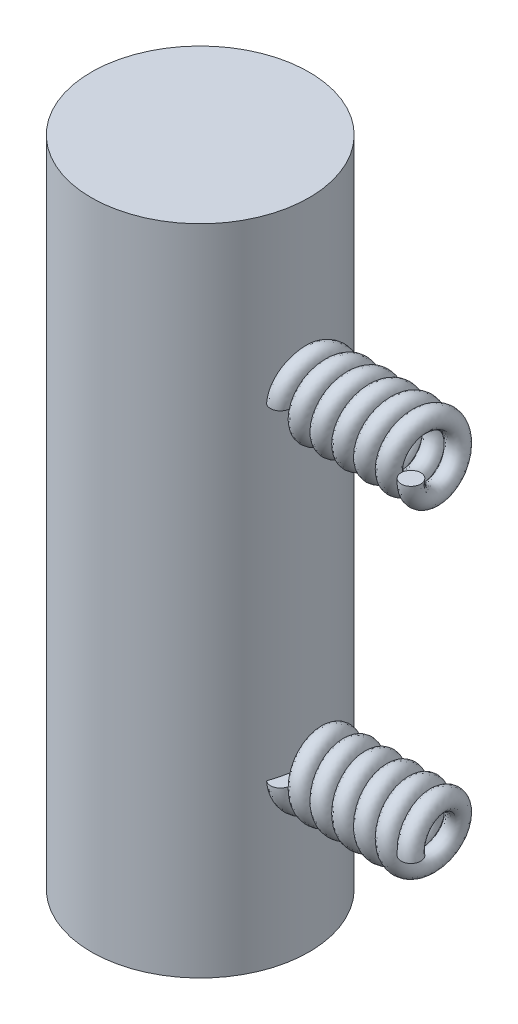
ISO-10303-21;
HEADER;
FILE_DESCRIPTION(('STEP AP214'),'2;1');
FILE_NAME('part.step','',(''),(''),'','','');
FILE_SCHEMA(('AUTOMOTIVE_DESIGN { 1 0 10303 214 1 1 1 1 }'));
ENDSEC;
DATA;
#1=APPLICATION_CONTEXT('core data for automotive mechanical design processes');
#2=APPLICATION_PROTOCOL_DEFINITION('international standard','automotive_design',2000,#1);
#3=PRODUCT_CONTEXT('',#1,'mechanical');
#4=PRODUCT('Part','Part','',(#3));
#5=PRODUCT_RELATED_PRODUCT_CATEGORY('part','',(#4));
#6=PRODUCT_DEFINITION_FORMATION('','',#4);
#7=PRODUCT_DEFINITION_CONTEXT('part definition',#1,'design');
#8=PRODUCT_DEFINITION('design','',#6,#7);
#9=PRODUCT_DEFINITION_SHAPE('','',#8);
#10=(LENGTH_UNIT() NAMED_UNIT(*) SI_UNIT(.MILLI.,.METRE.));
#11=(NAMED_UNIT(*) PLANE_ANGLE_UNIT() SI_UNIT($,.RADIAN.));
#12=(NAMED_UNIT(*) SI_UNIT($,.STERADIAN.) SOLID_ANGLE_UNIT());
#13=UNCERTAINTY_MEASURE_WITH_UNIT(LENGTH_MEASURE(1.E-05),#10,'distance_accuracy_value','');
#14=(GEOMETRIC_REPRESENTATION_CONTEXT(3) GLOBAL_UNCERTAINTY_ASSIGNED_CONTEXT((#13)) GLOBAL_UNIT_ASSIGNED_CONTEXT((#10,
#11,#12)) REPRESENTATION_CONTEXT('',''));
#15=CARTESIAN_POINT('',(0.,0.,0.));
#16=DIRECTION('',(0.,0.,1.));
#17=DIRECTION('',(1.,0.,0.));
#18=AXIS2_PLACEMENT_3D('',#15,#16,#17);
#19=CARTESIAN_POINT('',(0.,15.,0.));
#20=DIRECTION('',(0.,-1.,0.));
#21=DIRECTION('',(0.,0.,-1.));
#22=AXIS2_PLACEMENT_3D('',#19,#20,#21);
#23=CYLINDRICAL_SURFACE('',#22,5.);
#24=CARTESIAN_POINT('',(4.92229654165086,-7.5,0.878064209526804));
#25=CARTESIAN_POINT('',(4.92215604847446,-7.52514032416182,0.878845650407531));
#26=CARTESIAN_POINT('',(4.9222015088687,-7.55030283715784,0.87859658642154));
#27=CARTESIAN_POINT('',(4.92266081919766,-7.60052044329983,0.8760218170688));
#28=CARTESIAN_POINT('',(4.92307470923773,-7.62557552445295,0.873695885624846));
#29=CARTESIAN_POINT('',(4.92486220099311,-7.70027969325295,0.863588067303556));
#30=CARTESIAN_POINT('',(4.9267812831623,-7.74953300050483,0.852678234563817));
#31=CARTESIAN_POINT('',(4.93186544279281,-7.84528496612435,0.822757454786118));
#32=CARTESIAN_POINT('',(4.93502754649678,-7.89178989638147,0.8037658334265));
#33=CARTESIAN_POINT('',(4.94223224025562,-7.98083387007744,0.758200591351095));
#34=CARTESIAN_POINT('',(4.94627407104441,-8.02337628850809,0.731633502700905));
#35=CARTESIAN_POINT('',(4.95261134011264,-8.08304842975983,0.686923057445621));
#36=CARTESIAN_POINT('',(4.95475578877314,-8.10214601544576,0.671317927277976));
#37=CARTESIAN_POINT('',(4.95908115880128,-8.13897698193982,0.638581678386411));
#38=CARTESIAN_POINT('',(4.96126207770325,-8.15671045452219,0.621450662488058));
#39=CARTESIAN_POINT('',(4.96775759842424,-8.20786975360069,0.568040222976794));
#40=CARTESIAN_POINT('',(4.97202353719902,-8.23924179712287,0.529753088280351));
#41=CARTESIAN_POINT('',(4.98022658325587,-8.29759952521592,0.446322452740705));
#42=CARTESIAN_POINT('',(4.98412668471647,-8.32419053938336,0.400900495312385));
#43=CARTESIAN_POINT('',(4.99082701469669,-8.37004468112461,0.306417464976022));
#44=CARTESIAN_POINT('',(4.99362669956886,-8.38930418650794,0.257354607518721));
#45=CARTESIAN_POINT('',(4.99794479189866,-8.42147660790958,0.153146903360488));
#46=CARTESIAN_POINT('',(4.99935407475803,-8.4338199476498,0.097819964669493));
#47=CARTESIAN_POINT('',(5.00005956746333,-8.44591838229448,0.0139460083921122));
#48=CARTESIAN_POINT('',(5.00005945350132,-8.44888156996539,-0.0141810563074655));
#49=CARTESIAN_POINT('',(4.99958138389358,-8.45299776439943,-0.0705722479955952));
#50=CARTESIAN_POINT('',(4.99910326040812,-8.45415013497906,-0.0988364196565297));
#51=CARTESIAN_POINT('',(4.99705751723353,-8.45499950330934,-0.179257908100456));
#52=CARTESIAN_POINT('',(4.99491072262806,-8.45264458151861,-0.231428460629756));
#53=CARTESIAN_POINT('',(4.98902558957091,-8.44326742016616,-0.335154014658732));
#54=CARTESIAN_POINT('',(4.98528862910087,-8.43624921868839,-0.386709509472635));
#55=CARTESIAN_POINT('',(4.97889149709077,-8.42438822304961,-0.459462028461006));
#56=CARTESIAN_POINT('',(4.97686504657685,-8.42064671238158,-0.480913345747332));
#57=CARTESIAN_POINT('',(4.97253960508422,-8.41294364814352,-0.523749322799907));
#58=CARTESIAN_POINT('',(4.97024062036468,-8.40898209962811,-0.54513398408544));
#59=CARTESIAN_POINT('',(4.96535930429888,-8.40118135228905,-0.587938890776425));
#60=CARTESIAN_POINT('',(4.96277639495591,-8.39734242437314,-0.609359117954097));
#61=CARTESIAN_POINT('',(4.95731859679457,-8.39036684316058,-0.652272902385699));
#62=CARTESIAN_POINT('',(4.95444391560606,-8.38722969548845,-0.673766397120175));
#63=CARTESIAN_POINT('',(4.94914949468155,-8.38333253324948,-0.711465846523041));
#64=CARTESIAN_POINT('',(4.94679856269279,-8.38217198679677,-0.727634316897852));
#65=CARTESIAN_POINT('',(4.94194109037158,-8.38173690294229,-0.759923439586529));
#66=CARTESIAN_POINT('',(4.93943542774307,-8.38245253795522,-0.776043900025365));
#67=CARTESIAN_POINT('',(4.9345803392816,-8.3871869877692,-0.806301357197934));
#68=CARTESIAN_POINT('',(4.93224062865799,-8.39086552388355,-0.820474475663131));
#69=CARTESIAN_POINT('',(4.92887097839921,-8.39980800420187,-0.840404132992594));
#70=CARTESIAN_POINT('',(4.92776255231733,-8.40340378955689,-0.846873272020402));
#71=CARTESIAN_POINT('',(4.92566974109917,-8.41183962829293,-0.858961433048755));
#72=CARTESIAN_POINT('',(4.92468508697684,-8.41667691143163,-0.864582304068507));
#73=CARTESIAN_POINT('',(4.92302533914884,-8.42669151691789,-0.873980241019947));
#74=CARTESIAN_POINT('',(4.92232622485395,-8.43172734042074,-0.877905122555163));
#75=CARTESIAN_POINT('',(4.9210825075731,-8.44241301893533,-0.884849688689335));
#76=CARTESIAN_POINT('',(4.92053822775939,-8.44806412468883,-0.887867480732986));
#77=CARTESIAN_POINT('',(4.91885911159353,-8.46911966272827,-0.89714881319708));
#78=CARTESIAN_POINT('',(4.91817199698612,-8.48566797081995,-0.900884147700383));
#79=CARTESIAN_POINT('',(4.91761065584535,-8.51600643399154,-0.903937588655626));
#80=CARTESIAN_POINT('',(4.91761498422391,-8.52977123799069,-0.903915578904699));
#81=CARTESIAN_POINT('',(4.91798316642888,-8.55718493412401,-0.901910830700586));
#82=CARTESIAN_POINT('',(4.91834795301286,-8.57083343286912,-0.899923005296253));
#83=CARTESIAN_POINT('',(4.91975412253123,-8.60895642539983,-0.892213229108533));
#84=CARTESIAN_POINT('',(4.92110551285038,-8.63305734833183,-0.88476299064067));
#85=CARTESIAN_POINT('',(4.92434819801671,-8.67990041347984,-0.866534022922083));
#86=CARTESIAN_POINT('',(4.92624064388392,-8.70263953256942,-0.855748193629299));
#87=CARTESIAN_POINT('',(4.93170243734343,-8.76087771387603,-0.823840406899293));
#88=CARTESIAN_POINT('',(4.93556663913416,-8.79515899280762,-0.800536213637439));
#89=CARTESIAN_POINT('',(4.94365986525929,-8.85963186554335,-0.748942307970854));
#90=CARTESIAN_POINT('',(4.94788938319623,-8.88981777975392,-0.720645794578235));
#91=CARTESIAN_POINT('',(4.95770559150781,-8.95521665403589,-0.650224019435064));
#92=CARTESIAN_POINT('',(4.96328245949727,-8.98883152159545,-0.606607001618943));
#93=CARTESIAN_POINT('',(4.97368132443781,-9.04849411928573,-0.514441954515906));
#94=CARTESIAN_POINT('',(4.97850294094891,-9.07453804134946,-0.465891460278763));
#95=CARTESIAN_POINT('',(4.98694419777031,-9.11937933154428,-0.364688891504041));
#96=CARTESIAN_POINT('',(4.9905468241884,-9.13807467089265,-0.311990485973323));
#97=CARTESIAN_POINT('',(4.9961095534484,-9.16787007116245,-0.204434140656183));
#98=CARTESIAN_POINT('',(4.99806965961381,-9.17897014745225,-0.149576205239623));
#99=CARTESIAN_POINT('',(5.0003224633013,-9.19499185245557,-0.0299559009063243));
#100=CARTESIAN_POINT('',(5.00029704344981,-9.19863587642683,0.0349829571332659));
#101=CARTESIAN_POINT('',(4.9977093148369,-9.1968458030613,0.164688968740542));
#102=CARTESIAN_POINT('',(4.9951450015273,-9.19140453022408,0.229455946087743));
#103=CARTESIAN_POINT('',(4.98708705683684,-9.17047444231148,0.366464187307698));
#104=CARTESIAN_POINT('',(4.98123491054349,-9.15369074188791,0.438488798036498));
#105=CARTESIAN_POINT('',(4.96686934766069,-9.10967302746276,0.578969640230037));
#106=CARTESIAN_POINT('',(4.95835524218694,-9.08243630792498,0.647424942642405));
#107=CARTESIAN_POINT('',(4.93842372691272,-9.01533404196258,0.785685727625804));
#108=CARTESIAN_POINT('',(4.92680705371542,-8.97451289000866,0.854999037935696));
#109=CARTESIAN_POINT('',(4.9022244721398,-8.88270839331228,0.986234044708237));
#110=CARTESIAN_POINT('',(4.88925845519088,-8.83172423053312,1.04815514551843));
#111=CARTESIAN_POINT('',(4.86208603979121,-8.71667354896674,1.16799124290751));
#112=CARTESIAN_POINT('',(4.84786174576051,-8.65189699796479,1.22521757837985));
#113=CARTESIAN_POINT('',(4.82025706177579,-8.51453937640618,1.32967551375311));
#114=CARTESIAN_POINT('',(4.80687764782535,-8.4419495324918,1.3768956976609));
#115=CARTESIAN_POINT('',(4.78026666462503,-8.28037615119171,1.46681721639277));
#116=CARTESIAN_POINT('',(4.76730674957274,-8.19050937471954,1.50801190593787));
#117=CARTESIAN_POINT('',(4.7449453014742,-8.00542111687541,1.57696150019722));
#118=CARTESIAN_POINT('',(4.73554092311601,-7.91020398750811,1.60472715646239));
#119=CARTESIAN_POINT('',(4.72454657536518,-7.76183426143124,1.6367016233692));
#120=CARTESIAN_POINT('',(4.72135860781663,-7.7098197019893,1.64585526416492));
#121=CARTESIAN_POINT('',(4.71635935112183,-7.60525716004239,1.66012110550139));
#122=CARTESIAN_POINT('',(4.71454594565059,-7.55271012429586,1.66523951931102));
#123=CARTESIAN_POINT('',(4.7134700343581,-7.5,1.6682926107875));
#124=B_SPLINE_CURVE_WITH_KNOTS('',3,(#24,#25,#26,#27,#28,#29,#30,#31,#32,#33,#34,#35,#36,#37,
#38,#39,#40,#41,#42,#43,#44,#45,#46,#47,#48,#49,#50,#51,#52,#53,#54,#55,#56,#57,#58,#59,#60,#61,
#62,#63,#64,#65,#66,#67,#68,#69,#70,#71,#72,#73,#74,#75,#76,#77,#78,#79,#80,#81,#82,#83,#84,#85,
#86,#87,#88,#89,#90,#91,#92,#93,#94,#95,#96,#97,#98,#99,#100,#101,#102,#103,#104,#105,#106,#107,
#108,#109,#110,#111,#112,#113,#114,#115,#116,#117,#118,#119,#120,#121,#122,#123),.UNSPECIFIED.,
.F.,.F.,(4,2,2,2,2,2,2,2,2,2,2,2,2,2,2,2,2,2,2,2,2,2,2,2,2,2,2,2,2,2,2,2,2,2,2,2,2,2,2,2,2,2,2,
2,2,2,2,2,2,4),(0.,0.0754141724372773,0.150836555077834,0.301487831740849,0.451780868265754,
0.601944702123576,0.676137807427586,0.750325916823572,0.898749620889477,1.05641361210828,
1.21415539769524,1.38347499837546,1.46826441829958,1.55308362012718,1.70955780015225,
1.86589666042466,1.93150405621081,1.99710994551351,2.06285195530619,2.12854750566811,
2.17762849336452,2.22645290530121,2.27035515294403,2.29267692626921,2.31494931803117,
2.33411565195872,2.35332170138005,2.40324501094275,2.44441144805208,2.48568469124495,
2.56106300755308,2.63660288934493,2.7608108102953,2.88518926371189,3.05035915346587,
3.21561197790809,3.38308435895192,3.55055640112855,3.74490810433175,3.93941337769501,
4.16103256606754,4.38270915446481,4.62549497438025,4.86830034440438,5.13003488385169,
5.39206644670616,5.69001565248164,5.98772591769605,6.14630160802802,6.30463265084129),.UNSPECIFIED.);
#125=CARTESIAN_POINT('',(4.92229654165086,-7.5,0.878064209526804));
#126=VERTEX_POINT('',#125);
#127=CARTESIAN_POINT('',(4.7134700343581,-7.5,1.66829261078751));
#128=VERTEX_POINT('',#127);
#129=EDGE_CURVE('E41',#126,#128,#124,.T.);
#130=ORIENTED_EDGE('',*,*,#129,.T.);
#131=CARTESIAN_POINT('',(0.,-7.5,0.));
#132=DIRECTION('',(0.,1.,0.));
#133=DIRECTION('',(0.,0.,1.));
#134=AXIS2_PLACEMENT_3D('',#131,#132,#133);
#135=CIRCLE('',#134,5.);
#136=EDGE_CURVE('E11',#128,#126,#135,.T.);
#137=ORIENTED_EDGE('',*,*,#136,.T.);
#138=EDGE_LOOP('',(#130,#137));
#139=FACE_BOUND('',#138,.T.);
#140=CARTESIAN_POINT('',(4.7134700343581,7.5,1.66829261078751));
#141=CARTESIAN_POINT('',(4.71458885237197,7.55489108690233,1.66511303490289));
#142=CARTESIAN_POINT('',(4.71651054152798,7.60962206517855,1.65969186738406));
#143=CARTESIAN_POINT('',(4.72183342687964,7.71839883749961,1.64449685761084));
#144=CARTESIAN_POINT('',(4.72523445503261,7.77244470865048,1.63472350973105));
#145=CARTESIAN_POINT('',(4.73341071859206,7.87976965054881,1.61089375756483));
#146=CARTESIAN_POINT('',(4.73819281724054,7.93304346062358,1.59681594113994));
#147=CARTESIAN_POINT('',(4.7489652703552,8.03816095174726,1.56448623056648));
#148=CARTESIAN_POINT('',(4.7549556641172,8.09000458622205,1.54623420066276));
#149=CARTESIAN_POINT('',(4.77457758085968,8.24345817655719,1.48501748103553));
#150=CARTESIAN_POINT('',(4.78981876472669,8.34248243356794,1.43570393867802));
#151=CARTESIAN_POINT('',(4.81454499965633,8.48279918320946,1.34945728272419));
#152=CARTESIAN_POINT('',(4.82309153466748,8.52817411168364,1.31868681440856));
#153=CARTESIAN_POINT('',(4.8405441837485,8.61585440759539,1.25311113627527));
#154=CARTESIAN_POINT('',(4.84945019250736,8.65816066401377,1.21830710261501));
#155=CARTESIAN_POINT('',(4.86553548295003,8.73083824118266,1.15215998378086));
#156=CARTESIAN_POINT('',(4.87269722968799,8.76188602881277,1.12155450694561));
#157=CARTESIAN_POINT('',(4.88692035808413,8.82132899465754,1.0578638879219));
#158=CARTESIAN_POINT('',(4.89398175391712,8.84972455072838,1.02477910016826));
#159=CARTESIAN_POINT('',(4.91473881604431,8.93058608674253,0.922064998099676));
#160=CARTESIAN_POINT('',(4.92802421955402,8.97880062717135,0.848909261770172));
#161=CARTESIAN_POINT('',(4.95210755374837,9.06211727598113,0.694786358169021));
#162=CARTESIAN_POINT('',(4.96289707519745,9.0971752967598,0.613794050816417));
#163=CARTESIAN_POINT('',(4.98074313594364,9.15243781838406,0.446403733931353));
#164=CARTESIAN_POINT('',(4.98779765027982,9.17263426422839,0.360002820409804));
#165=CARTESIAN_POINT('',(4.99700289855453,9.19585643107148,0.191180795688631));
#166=CARTESIAN_POINT('',(4.9994803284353,9.20005118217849,0.108943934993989));
#167=CARTESIAN_POINT('',(5.00014971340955,9.19518869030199,-0.0138296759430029));
#168=CARTESIAN_POINT('',(4.99986616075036,9.19171433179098,-0.0546322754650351));
#169=CARTESIAN_POINT('',(4.99832156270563,9.18079456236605,-0.135741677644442));
#170=CARTESIAN_POINT('',(4.99705939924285,9.17334461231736,-0.176047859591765));
#171=CARTESIAN_POINT('',(4.99278767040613,9.14982782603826,-0.274859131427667));
#172=CARTESIAN_POINT('',(4.98922945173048,9.13133943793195,-0.332786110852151));
#173=CARTESIAN_POINT('',(4.98049984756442,9.08525089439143,-0.444708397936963));
#174=CARTESIAN_POINT('',(4.97533102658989,9.05766522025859,-0.498709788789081));
#175=CARTESIAN_POINT('',(4.96507623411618,8.99931088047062,-0.591423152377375));
#176=CARTESIAN_POINT('',(4.96015123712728,8.97007078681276,-0.631117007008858));
#177=CARTESIAN_POINT('',(4.95014458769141,8.90560060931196,-0.705309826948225));
#178=CARTESIAN_POINT('',(4.94506314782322,8.87037838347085,-0.739815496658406));
#179=CARTESIAN_POINT('',(4.93716970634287,8.80816102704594,-0.790413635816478));
#180=CARTESIAN_POINT('',(4.93420900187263,8.7828877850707,-0.808617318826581));
#181=CARTESIAN_POINT('',(4.92870750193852,8.73009007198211,-0.841497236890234));
#182=CARTESIAN_POINT('',(4.92616599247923,8.70256955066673,-0.856179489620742));
#183=CARTESIAN_POINT('',(4.92273262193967,8.65731863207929,-0.875646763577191));
#184=CARTESIAN_POINT('',(4.92159448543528,8.64028249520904,-0.882007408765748));
#185=CARTESIAN_POINT('',(4.91967390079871,8.60554117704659,-0.892657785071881));
#186=CARTESIAN_POINT('',(4.91889109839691,8.58783668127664,-0.896949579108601));
#187=CARTESIAN_POINT('',(4.91802788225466,8.5582665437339,-0.901668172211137));
#188=CARTESIAN_POINT('',(4.91779711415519,8.54654394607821,-0.902924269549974));
#189=CARTESIAN_POINT('',(4.91761925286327,8.52305388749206,-0.903891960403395));
#190=CARTESIAN_POINT('',(4.91767170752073,8.51128652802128,-0.903606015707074));
#191=CARTESIAN_POINT('',(4.91824404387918,8.48403852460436,-0.90049029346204));
#192=CARTESIAN_POINT('',(4.91891131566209,8.46860329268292,-0.896858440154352));
#193=CARTESIAN_POINT('',(4.92049231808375,8.44858669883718,-0.888121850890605));
#194=CARTESIAN_POINT('',(4.92102115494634,8.44302636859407,-0.885190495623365));
#195=CARTESIAN_POINT('',(4.92222864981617,8.43249053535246,-0.878451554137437));
#196=CARTESIAN_POINT('',(4.92290697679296,8.42751377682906,-0.874645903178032));
#197=CARTESIAN_POINT('',(4.92439899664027,8.41831355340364,-0.866205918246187));
#198=CARTESIAN_POINT('',(4.92521311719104,8.41409255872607,-0.861568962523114));
#199=CARTESIAN_POINT('',(4.92693915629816,8.40652924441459,-0.851643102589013));
#200=CARTESIAN_POINT('',(4.92785115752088,8.40318767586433,-0.846353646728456));
#201=CARTESIAN_POINT('',(4.93002191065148,8.39647243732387,-0.833628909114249));
#202=CARTESIAN_POINT('',(4.93130070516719,8.39340813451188,-0.826035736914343));
#203=CARTESIAN_POINT('',(4.93388280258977,8.38851919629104,-0.810471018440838));
#204=CARTESIAN_POINT('',(4.93518615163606,8.3866971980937,-0.802498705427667));
#205=CARTESIAN_POINT('',(4.9381041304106,8.38365244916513,-0.784367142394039));
#206=CARTESIAN_POINT('',(4.93971409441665,8.3826979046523,-0.774164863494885));
#207=CARTESIAN_POINT('',(4.94287795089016,8.38179019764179,-0.753701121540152));
#208=CARTESIAN_POINT('',(4.94443171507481,8.38183919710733,-0.743439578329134));
#209=CARTESIAN_POINT('',(4.94748410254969,8.38261783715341,-0.722848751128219));
#210=CARTESIAN_POINT('',(4.94898213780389,8.38335331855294,-0.712519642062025));
#211=CARTESIAN_POINT('',(4.95190583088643,8.38528825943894,-0.691908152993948));
#212=CARTESIAN_POINT('',(4.95333155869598,8.38648726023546,-0.681625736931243));
#213=CARTESIAN_POINT('',(4.95783726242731,8.39085567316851,-0.648373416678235));
#214=CARTESIAN_POINT('',(4.96077839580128,8.39462592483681,-0.625467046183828));
#215=CARTESIAN_POINT('',(4.96633536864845,8.40262745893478,-0.579693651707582));
#216=CARTESIAN_POINT('',(4.96895104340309,8.40685897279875,-0.556826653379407));
#217=CARTESIAN_POINT('',(4.97387042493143,8.41524707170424,-0.511022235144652));
#218=CARTESIAN_POINT('',(4.97617386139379,8.41940358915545,-0.488084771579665));
#219=CARTESIAN_POINT('',(4.98046915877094,8.42729237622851,-0.44210863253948));
#220=CARTESIAN_POINT('',(4.98246102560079,8.43102465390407,-0.419069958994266));
#221=CARTESIAN_POINT('',(4.98793105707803,8.44114991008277,-0.350213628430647));
#222=CARTESIAN_POINT('',(4.99095230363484,8.44656493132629,-0.304203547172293));
#223=CARTESIAN_POINT('',(4.99572522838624,8.45353769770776,-0.21181183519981));
#224=CARTESIAN_POINT('',(4.9974773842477,8.45509689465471,-0.165430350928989));
#225=CARTESIAN_POINT('',(4.99930615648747,8.45384556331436,-0.0886796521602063));
#226=CARTESIAN_POINT('',(4.99975198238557,8.45235488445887,-0.05829647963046));
#227=CARTESIAN_POINT('',(5.00000637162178,8.44853513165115,-0.0128582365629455));
#228=CARTESIAN_POINT('',(5.00002213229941,8.4469981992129,0.00226331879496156));
#229=CARTESIAN_POINT('',(4.99991767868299,8.44331644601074,0.0324321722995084));
#230=CARTESIAN_POINT('',(4.99979744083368,8.44117151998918,0.0474794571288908));
#231=CARTESIAN_POINT('',(4.99885580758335,8.42886423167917,0.122680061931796));
#232=CARTESIAN_POINT('',(4.99701335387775,8.41401520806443,0.18215581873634));
#233=CARTESIAN_POINT('',(4.99146438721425,8.37415407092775,0.297753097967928));
#234=CARTESIAN_POINT('',(4.98775007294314,8.3490995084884,0.353859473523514));
#235=CARTESIAN_POINT('',(4.97903802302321,8.28917662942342,0.460471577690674));
#236=CARTESIAN_POINT('',(4.97404159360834,8.25431829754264,0.510982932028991));
#237=CARTESIAN_POINT('',(4.96639310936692,8.19698868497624,0.579148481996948));
#238=CARTESIAN_POINT('',(4.96393132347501,8.17798706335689,0.599821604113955));
#239=CARTESIAN_POINT('',(4.95898952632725,8.13821918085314,0.63938855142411));
#240=CARTESIAN_POINT('',(4.95650951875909,8.1174532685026,0.658282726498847));
#241=CARTESIAN_POINT('',(4.9492029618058,8.0525999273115,0.711822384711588));
#242=CARTESIAN_POINT('',(4.94450037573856,8.00589072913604,0.743405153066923));
#243=CARTESIAN_POINT('',(4.93649942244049,7.91171952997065,0.794726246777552));
#244=CARTESIAN_POINT('',(4.9331131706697,7.86469705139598,0.815270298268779));
#245=CARTESIAN_POINT('',(4.92760133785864,7.76772979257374,0.847952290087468));
#246=CARTESIAN_POINT('',(4.92547523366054,7.7177862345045,0.860093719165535));
#247=CARTESIAN_POINT('',(4.92334472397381,7.63954015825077,0.872177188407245));
#248=CARTESIAN_POINT('',(4.92281548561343,7.61168300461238,0.87515401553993));
#249=CARTESIAN_POINT('',(4.92221353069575,7.55587407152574,0.878528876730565));
#250=CARTESIAN_POINT('',(4.9221397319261,7.52792267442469,0.878933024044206));
#251=CARTESIAN_POINT('',(4.92229654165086,7.5,0.878064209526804));
#252=B_SPLINE_CURVE_WITH_KNOTS('',3,(#140,#141,#142,#143,#144,#145,#146,#147,#148,#149,#150,
#151,#152,#153,#154,#155,#156,#157,#158,#159,#160,#161,#162,#163,#164,#165,#166,#167,#168,#169,
#170,#171,#172,#173,#174,#175,#176,#177,#178,#179,#180,#181,#182,#183,#184,#185,#186,#187,#188,
#189,#190,#191,#192,#193,#194,#195,#196,#197,#198,#199,#200,#201,#202,#203,#204,#205,#206,#207,
#208,#209,#210,#211,#212,#213,#214,#215,#216,#217,#218,#219,#220,#221,#222,#223,#224,#225,#226,
#227,#228,#229,#230,#231,#232,#233,#234,#235,#236,#237,#238,#239,#240,#241,#242,#243,#244,#245,
#246,#247,#248,#249,#250,#251),.UNSPECIFIED.,.F.,.F.,(4,2,2,2,2,2,2,2,2,2,2,2,2,2,2,2,2,2,2,2,2,
2,2,2,2,2,2,2,2,2,2,2,2,2,2,2,2,2,2,2,2,2,2,2,2,2,2,2,2,2,2,2,2,2,2,4),(0.,0.164910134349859,
0.329801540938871,0.495526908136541,0.661257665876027,0.994267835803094,1.16055244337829,
1.32678868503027,1.45918656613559,1.59156555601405,1.856024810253,2.1213625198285,
2.38684393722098,2.63251124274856,2.75519363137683,2.87801639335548,3.05995571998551,
3.24160681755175,3.3897122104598,3.53762453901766,3.63127666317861,3.72476758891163,
3.77933520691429,3.83384830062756,3.86913448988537,3.90436436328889,3.95112663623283,
3.96997469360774,3.98878142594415,4.00764854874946,4.02653173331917,4.05125195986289,
4.07602450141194,4.10706404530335,4.1381704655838,4.16954398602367,4.20088653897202,
4.27105903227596,4.3412668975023,4.41153516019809,4.4818020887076,4.62094516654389,
4.76003584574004,4.85122983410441,4.89681609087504,4.94241024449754,5.12535982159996,
5.30907825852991,5.4926102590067,5.5770787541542,5.66153060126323,5.83012616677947,
5.98366957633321,6.13714919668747,6.22110327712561,6.3048577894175),.UNSPECIFIED.);
#253=CARTESIAN_POINT('',(4.7134700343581,7.5,1.66829261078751));
#254=VERTEX_POINT('',#253);
#255=CARTESIAN_POINT('',(4.92229654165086,7.5,0.878064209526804));
#256=VERTEX_POINT('',#255);
#257=EDGE_CURVE('E73',#254,#256,#252,.T.);
#258=ORIENTED_EDGE('',*,*,#257,.T.);
#259=CARTESIAN_POINT('',(0.,7.5,0.));
#260=DIRECTION('',(0.,-1.,0.));
#261=DIRECTION('',(0.,0.,-1.));
#262=AXIS2_PLACEMENT_3D('',#259,#260,#261);
#263=CIRCLE('',#262,5.);
#264=EDGE_CURVE('E62',#256,#254,#263,.T.);
#265=ORIENTED_EDGE('',*,*,#264,.T.);
#266=EDGE_LOOP('',(#258,#265));
#267=FACE_BOUND('',#266,.T.);
#268=CARTESIAN_POINT('',(0.,15.,0.));
#269=DIRECTION('',(0.,1.,0.));
#270=DIRECTION('',(0.,0.,1.));
#271=AXIS2_PLACEMENT_3D('',#268,#269,#270);
#272=CIRCLE('',#271,5.);
#273=CARTESIAN_POINT('',(0.,15.,5.));
#274=VERTEX_POINT('',#273);
#275=EDGE_CURVE('E77',#274,#274,#272,.T.);
#276=ORIENTED_EDGE('',*,*,#275,.F.);
#277=EDGE_LOOP('',(#276));
#278=FACE_BOUND('',#277,.T.);
#279=CARTESIAN_POINT('',(0.,-15.,0.));
#280=DIRECTION('',(0.,1.,0.));
#281=DIRECTION('',(0.,0.,1.));
#282=AXIS2_PLACEMENT_3D('',#279,#280,#281);
#283=CIRCLE('',#282,5.);
#284=CARTESIAN_POINT('',(0.,-15.,5.));
#285=VERTEX_POINT('',#284);
#286=EDGE_CURVE('E80',#285,#285,#283,.T.);
#287=ORIENTED_EDGE('',*,*,#286,.T.);
#288=EDGE_LOOP('',(#287));
#289=FACE_BOUND('',#288,.T.);
#290=ADVANCED_FACE('F33',(#139,#267,#278,#289),#23,.T.);
#291=CARTESIAN_POINT('',(0.,15.,0.));
#292=DIRECTION('',(0.,1.,0.));
#293=DIRECTION('',(0.,0.,1.));
#294=AXIS2_PLACEMENT_3D('',#291,#292,#293);
#295=PLANE('',#294);
#296=ORIENTED_EDGE('',*,*,#275,.T.);
#297=EDGE_LOOP('',(#296));
#298=FACE_BOUND('',#297,.T.);
#299=ADVANCED_FACE('F69',(#298),#295,.T.);
#300=CARTESIAN_POINT('',(0.,-15.,0.));
#301=DIRECTION('',(0.,1.,0.));
#302=DIRECTION('',(0.,0.,1.));
#303=AXIS2_PLACEMENT_3D('',#300,#301,#302);
#304=PLANE('',#303);
#305=ORIENTED_EDGE('',*,*,#286,.F.);
#306=EDGE_LOOP('',(#305));
#307=FACE_BOUND('',#306,.T.);
#308=ADVANCED_FACE('F103',(#307),#304,.F.);
#309=CARTESIAN_POINT('',(5.,7.5,1.77130474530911));
#310=CARTESIAN_POINT('',(5.0625,8.23369844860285,1.77130474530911));
#311=CARTESIAN_POINT('',(5.125,8.75250159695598,1.25250159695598));
#312=CARTESIAN_POINT('',(5.1875,9.27130474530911,0.733698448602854));
#313=CARTESIAN_POINT('',(5.25,9.27130474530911,0.));
#314=CARTESIAN_POINT('',(5.3125,9.27130474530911,-0.733698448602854));
#315=CARTESIAN_POINT('',(5.375,8.75250159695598,-1.25250159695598));
#316=CARTESIAN_POINT('',(5.4375,8.23369844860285,-1.77130474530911));
#317=CARTESIAN_POINT('',(5.5,7.5,-1.77130474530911));
#318=CARTESIAN_POINT('',(5.5625,6.76630155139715,-1.77130474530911));
#319=CARTESIAN_POINT('',(5.625,6.24749840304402,-1.25250159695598));
#320=CARTESIAN_POINT('',(5.6875,5.72869525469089,-0.733698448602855));
#321=CARTESIAN_POINT('',(5.75,5.72869525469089,0.));
#322=CARTESIAN_POINT('',(5.8125,5.72869525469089,0.733698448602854));
#323=CARTESIAN_POINT('',(5.875,6.24749840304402,1.25250159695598));
#324=CARTESIAN_POINT('',(5.9375,6.76630155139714,1.77130474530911));
#325=CARTESIAN_POINT('',(6.,7.5,1.77130474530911));
#326=CARTESIAN_POINT('',(6.0625,8.23369844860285,1.77130474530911));
#327=CARTESIAN_POINT('',(6.125,8.75250159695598,1.25250159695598));
#328=CARTESIAN_POINT('',(6.1875,9.27130474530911,0.733698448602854));
#329=CARTESIAN_POINT('',(6.25,9.27130474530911,0.));
#330=CARTESIAN_POINT('',(6.3125,9.27130474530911,-0.733698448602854));
#331=CARTESIAN_POINT('',(6.375,8.75250159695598,-1.25250159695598));
#332=CARTESIAN_POINT('',(6.4375,8.23369844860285,-1.77130474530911));
#333=CARTESIAN_POINT('',(6.5,7.5,-1.77130474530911));
#334=CARTESIAN_POINT('',(6.5625,6.76630155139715,-1.77130474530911));
#335=CARTESIAN_POINT('',(6.625,6.24749840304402,-1.25250159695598));
#336=CARTESIAN_POINT('',(6.6875,5.72869525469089,-0.733698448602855));
#337=CARTESIAN_POINT('',(6.75,5.72869525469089,0.));
#338=CARTESIAN_POINT('',(6.8125,5.72869525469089,0.733698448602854));
#339=CARTESIAN_POINT('',(6.875,6.24749840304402,1.25250159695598));
#340=CARTESIAN_POINT('',(6.9375,6.76630155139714,1.77130474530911));
#341=CARTESIAN_POINT('',(7.,7.5,1.77130474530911));
#342=CARTESIAN_POINT('',(7.0625,8.23369844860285,1.77130474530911));
#343=CARTESIAN_POINT('',(7.125,8.75250159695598,1.25250159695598));
#344=CARTESIAN_POINT('',(7.1875,9.27130474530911,0.733698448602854));
#345=CARTESIAN_POINT('',(7.25,9.27130474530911,0.));
#346=CARTESIAN_POINT('',(7.3125,9.27130474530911,-0.733698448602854));
#347=CARTESIAN_POINT('',(7.375,8.75250159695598,-1.25250159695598));
#348=CARTESIAN_POINT('',(7.4375,8.23369844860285,-1.77130474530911));
#349=CARTESIAN_POINT('',(7.5,7.5,-1.77130474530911));
#350=CARTESIAN_POINT('',(7.5625,6.76630155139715,-1.77130474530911));
#351=CARTESIAN_POINT('',(7.625,6.24749840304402,-1.25250159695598));
#352=CARTESIAN_POINT('',(7.6875,5.72869525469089,-0.733698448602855));
#353=CARTESIAN_POINT('',(7.75,5.72869525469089,0.));
#354=CARTESIAN_POINT('',(7.8125,5.72869525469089,0.733698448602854));
#355=CARTESIAN_POINT('',(7.875,6.24749840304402,1.25250159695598));
#356=CARTESIAN_POINT('',(7.9375,6.76630155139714,1.77130474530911));
#357=CARTESIAN_POINT('',(8.,7.5,1.77130474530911));
#358=CARTESIAN_POINT('',(8.0625,8.23369844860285,1.77130474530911));
#359=CARTESIAN_POINT('',(8.125,8.75250159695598,1.25250159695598));
#360=CARTESIAN_POINT('',(8.1875,9.27130474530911,0.733698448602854));
#361=CARTESIAN_POINT('',(8.25,9.27130474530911,0.));
#362=CARTESIAN_POINT('',(8.3125,9.27130474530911,-0.733698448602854));
#363=CARTESIAN_POINT('',(8.375,8.75250159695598,-1.25250159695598));
#364=CARTESIAN_POINT('',(8.4375,8.23369844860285,-1.77130474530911));
#365=CARTESIAN_POINT('',(8.5,7.5,-1.77130474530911));
#366=CARTESIAN_POINT('',(8.5625,6.76630155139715,-1.77130474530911));
#367=CARTESIAN_POINT('',(8.625,6.24749840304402,-1.25250159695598));
#368=CARTESIAN_POINT('',(8.6875,5.72869525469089,-0.733698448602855));
#369=CARTESIAN_POINT('',(8.75,5.72869525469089,0.));
#370=CARTESIAN_POINT('',(8.8125,5.72869525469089,0.733698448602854));
#371=CARTESIAN_POINT('',(8.875,6.24749840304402,1.25250159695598));
#372=CARTESIAN_POINT('',(8.9375,6.76630155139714,1.77130474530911));
#373=CARTESIAN_POINT('',(9.,7.5,1.77130474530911));
#374=CARTESIAN_POINT('',(9.0625,8.23369844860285,1.77130474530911));
#375=CARTESIAN_POINT('',(9.125,8.75250159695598,1.25250159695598));
#376=CARTESIAN_POINT('',(9.1875,9.27130474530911,0.733698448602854));
#377=CARTESIAN_POINT('',(9.25,9.27130474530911,0.));
#378=CARTESIAN_POINT('',(9.3125,9.27130474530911,-0.733698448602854));
#379=CARTESIAN_POINT('',(9.375,8.75250159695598,-1.25250159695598));
#380=CARTESIAN_POINT('',(9.4375,8.23369844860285,-1.77130474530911));
#381=CARTESIAN_POINT('',(9.5,7.5,-1.77130474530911));
#382=CARTESIAN_POINT('',(9.5625,6.76630155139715,-1.77130474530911));
#383=CARTESIAN_POINT('',(9.625,6.24749840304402,-1.25250159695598));
#384=CARTESIAN_POINT('',(9.6875,5.72869525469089,-0.733698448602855));
#385=CARTESIAN_POINT('',(9.75,5.72869525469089,0.));
#386=CARTESIAN_POINT('',(9.8125,5.72869525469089,0.733698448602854));
#387=CARTESIAN_POINT('',(9.875,6.24749840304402,1.25250159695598));
#388=CARTESIAN_POINT('',(9.9375,6.76630155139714,1.77130474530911));
#389=CARTESIAN_POINT('',(10.,7.5,1.77130474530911));
#390=CARTESIAN_POINT('',(10.0625,8.23369844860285,1.77130474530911));
#391=CARTESIAN_POINT('',(10.125,8.75250159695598,1.25250159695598));
#392=CARTESIAN_POINT('',(10.1875,9.27130474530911,0.733698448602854));
#393=CARTESIAN_POINT('',(10.25,9.27130474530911,0.));
#394=CARTESIAN_POINT('',(10.3125,9.27130474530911,-0.733698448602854));
#395=CARTESIAN_POINT('',(10.375,8.75250159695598,-1.25250159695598));
#396=CARTESIAN_POINT('',(10.4375,8.23369844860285,-1.77130474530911));
#397=CARTESIAN_POINT('',(10.5,7.5,-1.77130474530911));
#398=CARTESIAN_POINT('',(10.5625,6.76630155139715,-1.77130474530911));
#399=CARTESIAN_POINT('',(10.625,6.24749840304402,-1.25250159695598));
#400=CARTESIAN_POINT('',(10.6875,5.72869525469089,-0.733698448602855));
#401=CARTESIAN_POINT('',(10.75,5.72869525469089,0.));
#402=CARTESIAN_POINT('',(10.8125,5.72869525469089,0.733698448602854));
#403=CARTESIAN_POINT('',(10.875,6.24749840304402,1.25250159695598));
#404=CARTESIAN_POINT('',(10.9375,6.76630155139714,1.77130474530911));
#405=CARTESIAN_POINT('',(11.,7.5,1.77130474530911));
#406=CARTESIAN_POINT('',(5.9,7.5,1.77130474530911));
#407=CARTESIAN_POINT('',(5.9625,8.23369844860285,1.77130474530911));
#408=CARTESIAN_POINT('',(6.025,8.75250159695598,1.25250159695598));
#409=CARTESIAN_POINT('',(6.0875,9.27130474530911,0.733698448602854));
#410=CARTESIAN_POINT('',(6.15,9.27130474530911,0.));
#411=CARTESIAN_POINT('',(6.2125,9.27130474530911,-0.733698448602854));
#412=CARTESIAN_POINT('',(6.275,8.75250159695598,-1.25250159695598));
#413=CARTESIAN_POINT('',(6.3375,8.23369844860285,-1.77130474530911));
#414=CARTESIAN_POINT('',(6.4,7.5,-1.77130474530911));
#415=CARTESIAN_POINT('',(6.4625,6.76630155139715,-1.77130474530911));
#416=CARTESIAN_POINT('',(6.525,6.24749840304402,-1.25250159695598));
#417=CARTESIAN_POINT('',(6.5875,5.72869525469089,-0.733698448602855));
#418=CARTESIAN_POINT('',(6.65,5.72869525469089,0.));
#419=CARTESIAN_POINT('',(6.7125,5.72869525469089,0.733698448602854));
#420=CARTESIAN_POINT('',(6.775,6.24749840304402,1.25250159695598));
#421=CARTESIAN_POINT('',(6.8375,6.76630155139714,1.77130474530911));
#422=CARTESIAN_POINT('',(6.9,7.5,1.77130474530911));
#423=CARTESIAN_POINT('',(6.9625,8.23369844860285,1.77130474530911));
#424=CARTESIAN_POINT('',(7.025,8.75250159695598,1.25250159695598));
#425=CARTESIAN_POINT('',(7.0875,9.27130474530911,0.733698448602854));
#426=CARTESIAN_POINT('',(7.15,9.27130474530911,0.));
#427=CARTESIAN_POINT('',(7.2125,9.27130474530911,-0.733698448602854));
#428=CARTESIAN_POINT('',(7.275,8.75250159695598,-1.25250159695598));
#429=CARTESIAN_POINT('',(7.3375,8.23369844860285,-1.77130474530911));
#430=CARTESIAN_POINT('',(7.4,7.5,-1.77130474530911));
#431=CARTESIAN_POINT('',(7.4625,6.76630155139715,-1.77130474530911));
#432=CARTESIAN_POINT('',(7.525,6.24749840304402,-1.25250159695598));
#433=CARTESIAN_POINT('',(7.5875,5.72869525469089,-0.733698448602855));
#434=CARTESIAN_POINT('',(7.65,5.72869525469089,0.));
#435=CARTESIAN_POINT('',(7.7125,5.72869525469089,0.733698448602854));
#436=CARTESIAN_POINT('',(7.775,6.24749840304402,1.25250159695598));
#437=CARTESIAN_POINT('',(7.8375,6.76630155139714,1.77130474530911));
#438=CARTESIAN_POINT('',(7.9,7.5,1.77130474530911));
#439=CARTESIAN_POINT('',(7.9625,8.23369844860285,1.77130474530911));
#440=CARTESIAN_POINT('',(8.025,8.75250159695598,1.25250159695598));
#441=CARTESIAN_POINT('',(8.0875,9.27130474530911,0.733698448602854));
#442=CARTESIAN_POINT('',(8.15,9.27130474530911,0.));
#443=CARTESIAN_POINT('',(8.2125,9.27130474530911,-0.733698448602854));
#444=CARTESIAN_POINT('',(8.275,8.75250159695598,-1.25250159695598));
#445=CARTESIAN_POINT('',(8.3375,8.23369844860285,-1.77130474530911));
#446=CARTESIAN_POINT('',(8.4,7.5,-1.77130474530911));
#447=CARTESIAN_POINT('',(8.4625,6.76630155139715,-1.77130474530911));
#448=CARTESIAN_POINT('',(8.525,6.24749840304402,-1.25250159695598));
#449=CARTESIAN_POINT('',(8.5875,5.72869525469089,-0.733698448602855));
#450=CARTESIAN_POINT('',(8.65,5.72869525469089,0.));
#451=CARTESIAN_POINT('',(8.7125,5.72869525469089,0.733698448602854));
#452=CARTESIAN_POINT('',(8.775,6.24749840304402,1.25250159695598));
#453=CARTESIAN_POINT('',(8.8375,6.76630155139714,1.77130474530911));
#454=CARTESIAN_POINT('',(8.9,7.5,1.77130474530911));
#455=CARTESIAN_POINT('',(8.9625,8.23369844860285,1.77130474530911));
#456=CARTESIAN_POINT('',(9.025,8.75250159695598,1.25250159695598));
#457=CARTESIAN_POINT('',(9.0875,9.27130474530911,0.733698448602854));
#458=CARTESIAN_POINT('',(9.15,9.27130474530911,0.));
#459=CARTESIAN_POINT('',(9.2125,9.27130474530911,-0.733698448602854));
#460=CARTESIAN_POINT('',(9.275,8.75250159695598,-1.25250159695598));
#461=CARTESIAN_POINT('',(9.3375,8.23369844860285,-1.77130474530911));
#462=CARTESIAN_POINT('',(9.4,7.5,-1.77130474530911));
#463=CARTESIAN_POINT('',(9.4625,6.76630155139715,-1.77130474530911));
#464=CARTESIAN_POINT('',(9.525,6.24749840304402,-1.25250159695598));
#465=CARTESIAN_POINT('',(9.5875,5.72869525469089,-0.733698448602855));
#466=CARTESIAN_POINT('',(9.65,5.72869525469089,0.));
#467=CARTESIAN_POINT('',(9.7125,5.72869525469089,0.733698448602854));
#468=CARTESIAN_POINT('',(9.775,6.24749840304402,1.25250159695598));
#469=CARTESIAN_POINT('',(9.8375,6.76630155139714,1.77130474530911));
#470=CARTESIAN_POINT('',(9.9,7.5,1.77130474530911));
#471=CARTESIAN_POINT('',(9.9625,8.23369844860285,1.77130474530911));
#472=CARTESIAN_POINT('',(10.025,8.75250159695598,1.25250159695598));
#473=CARTESIAN_POINT('',(10.0875,9.27130474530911,0.733698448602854));
#474=CARTESIAN_POINT('',(10.15,9.27130474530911,0.));
#475=CARTESIAN_POINT('',(10.2125,9.27130474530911,-0.733698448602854));
#476=CARTESIAN_POINT('',(10.275,8.75250159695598,-1.25250159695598));
#477=CARTESIAN_POINT('',(10.3375,8.23369844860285,-1.77130474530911));
#478=CARTESIAN_POINT('',(10.4,7.5,-1.77130474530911));
#479=CARTESIAN_POINT('',(10.4625,6.76630155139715,-1.77130474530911));
#480=CARTESIAN_POINT('',(10.525,6.24749840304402,-1.25250159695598));
#481=CARTESIAN_POINT('',(10.5875,5.72869525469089,-0.733698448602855));
#482=CARTESIAN_POINT('',(10.65,5.72869525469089,0.));
#483=CARTESIAN_POINT('',(10.7125,5.72869525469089,0.733698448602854));
#484=CARTESIAN_POINT('',(10.775,6.24749840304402,1.25250159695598));
#485=CARTESIAN_POINT('',(10.8375,6.76630155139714,1.77130474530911));
#486=CARTESIAN_POINT('',(10.9,7.5,1.77130474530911));
#487=CARTESIAN_POINT('',(10.9625,8.23369844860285,1.77130474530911));
#488=CARTESIAN_POINT('',(11.025,8.75250159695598,1.25250159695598));
#489=CARTESIAN_POINT('',(11.0875,9.27130474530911,0.733698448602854));
#490=CARTESIAN_POINT('',(11.15,9.27130474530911,0.));
#491=CARTESIAN_POINT('',(11.2125,9.27130474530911,-0.733698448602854));
#492=CARTESIAN_POINT('',(11.275,8.75250159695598,-1.25250159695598));
#493=CARTESIAN_POINT('',(11.3375,8.23369844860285,-1.77130474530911));
#494=CARTESIAN_POINT('',(11.4,7.5,-1.77130474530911));
#495=CARTESIAN_POINT('',(11.4625,6.76630155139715,-1.77130474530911));
#496=CARTESIAN_POINT('',(11.525,6.24749840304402,-1.25250159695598));
#497=CARTESIAN_POINT('',(11.5875,5.72869525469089,-0.733698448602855));
#498=CARTESIAN_POINT('',(11.65,5.72869525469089,0.));
#499=CARTESIAN_POINT('',(11.7125,5.72869525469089,0.733698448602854));
#500=CARTESIAN_POINT('',(11.775,6.24749840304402,1.25250159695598));
#501=CARTESIAN_POINT('',(11.8375,6.76630155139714,1.77130474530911));
#502=CARTESIAN_POINT('',(11.9,7.5,1.77130474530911));
#503=CARTESIAN_POINT('',(5.9,7.5,0.871304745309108));
#504=CARTESIAN_POINT('',(5.9625,7.86090624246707,0.871304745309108));
#505=CARTESIAN_POINT('',(6.025,8.11610549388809,0.616105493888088));
#506=CARTESIAN_POINT('',(6.0875,8.37130474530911,0.360906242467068));
#507=CARTESIAN_POINT('',(6.15,8.37130474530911,0.));
#508=CARTESIAN_POINT('',(6.2125,8.37130474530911,-0.360906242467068));
#509=CARTESIAN_POINT('',(6.275,8.11610549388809,-0.616105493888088));
#510=CARTESIAN_POINT('',(6.3375,7.86090624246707,-0.871304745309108));
#511=CARTESIAN_POINT('',(6.4,7.5,-0.871304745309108));
#512=CARTESIAN_POINT('',(6.4625,7.13909375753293,-0.871304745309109));
#513=CARTESIAN_POINT('',(6.525,6.88389450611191,-0.616105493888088));
#514=CARTESIAN_POINT('',(6.5875,6.62869525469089,-0.360906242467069));
#515=CARTESIAN_POINT('',(6.65,6.62869525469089,0.));
#516=CARTESIAN_POINT('',(6.7125,6.62869525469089,0.360906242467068));
#517=CARTESIAN_POINT('',(6.775,6.88389450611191,0.616105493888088));
#518=CARTESIAN_POINT('',(6.8375,7.13909375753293,0.871304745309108));
#519=CARTESIAN_POINT('',(6.9,7.5,0.871304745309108));
#520=CARTESIAN_POINT('',(6.9625,7.86090624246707,0.871304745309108));
#521=CARTESIAN_POINT('',(7.025,8.11610549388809,0.616105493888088));
#522=CARTESIAN_POINT('',(7.0875,8.37130474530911,0.360906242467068));
#523=CARTESIAN_POINT('',(7.15,8.37130474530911,0.));
#524=CARTESIAN_POINT('',(7.2125,8.37130474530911,-0.360906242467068));
#525=CARTESIAN_POINT('',(7.275,8.11610549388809,-0.616105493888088));
#526=CARTESIAN_POINT('',(7.3375,7.86090624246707,-0.871304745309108));
#527=CARTESIAN_POINT('',(7.4,7.5,-0.871304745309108));
#528=CARTESIAN_POINT('',(7.4625,7.13909375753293,-0.871304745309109));
#529=CARTESIAN_POINT('',(7.525,6.88389450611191,-0.616105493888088));
#530=CARTESIAN_POINT('',(7.5875,6.62869525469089,-0.360906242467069));
#531=CARTESIAN_POINT('',(7.65,6.62869525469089,0.));
#532=CARTESIAN_POINT('',(7.7125,6.62869525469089,0.360906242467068));
#533=CARTESIAN_POINT('',(7.775,6.88389450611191,0.616105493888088));
#534=CARTESIAN_POINT('',(7.8375,7.13909375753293,0.871304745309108));
#535=CARTESIAN_POINT('',(7.9,7.5,0.871304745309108));
#536=CARTESIAN_POINT('',(7.9625,7.86090624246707,0.871304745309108));
#537=CARTESIAN_POINT('',(8.025,8.11610549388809,0.616105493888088));
#538=CARTESIAN_POINT('',(8.0875,8.37130474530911,0.360906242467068));
#539=CARTESIAN_POINT('',(8.15,8.37130474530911,0.));
#540=CARTESIAN_POINT('',(8.2125,8.37130474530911,-0.360906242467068));
#541=CARTESIAN_POINT('',(8.275,8.11610549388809,-0.616105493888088));
#542=CARTESIAN_POINT('',(8.3375,7.86090624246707,-0.871304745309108));
#543=CARTESIAN_POINT('',(8.4,7.5,-0.871304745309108));
#544=CARTESIAN_POINT('',(8.4625,7.13909375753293,-0.871304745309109));
#545=CARTESIAN_POINT('',(8.525,6.88389450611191,-0.616105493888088));
#546=CARTESIAN_POINT('',(8.5875,6.62869525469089,-0.360906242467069));
#547=CARTESIAN_POINT('',(8.65,6.62869525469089,0.));
#548=CARTESIAN_POINT('',(8.7125,6.62869525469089,0.360906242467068));
#549=CARTESIAN_POINT('',(8.775,6.88389450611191,0.616105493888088));
#550=CARTESIAN_POINT('',(8.8375,7.13909375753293,0.871304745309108));
#551=CARTESIAN_POINT('',(8.9,7.5,0.871304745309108));
#552=CARTESIAN_POINT('',(8.9625,7.86090624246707,0.871304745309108));
#553=CARTESIAN_POINT('',(9.025,8.11610549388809,0.616105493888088));
#554=CARTESIAN_POINT('',(9.0875,8.37130474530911,0.360906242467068));
#555=CARTESIAN_POINT('',(9.15,8.37130474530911,0.));
#556=CARTESIAN_POINT('',(9.2125,8.37130474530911,-0.360906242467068));
#557=CARTESIAN_POINT('',(9.275,8.11610549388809,-0.616105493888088));
#558=CARTESIAN_POINT('',(9.3375,7.86090624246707,-0.871304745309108));
#559=CARTESIAN_POINT('',(9.4,7.5,-0.871304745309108));
#560=CARTESIAN_POINT('',(9.4625,7.13909375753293,-0.871304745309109));
#561=CARTESIAN_POINT('',(9.525,6.88389450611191,-0.616105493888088));
#562=CARTESIAN_POINT('',(9.5875,6.62869525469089,-0.360906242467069));
#563=CARTESIAN_POINT('',(9.65,6.62869525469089,0.));
#564=CARTESIAN_POINT('',(9.7125,6.62869525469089,0.360906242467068));
#565=CARTESIAN_POINT('',(9.775,6.88389450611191,0.616105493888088));
#566=CARTESIAN_POINT('',(9.8375,7.13909375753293,0.871304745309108));
#567=CARTESIAN_POINT('',(9.9,7.5,0.871304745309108));
#568=CARTESIAN_POINT('',(9.9625,7.86090624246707,0.871304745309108));
#569=CARTESIAN_POINT('',(10.025,8.11610549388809,0.616105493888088));
#570=CARTESIAN_POINT('',(10.0875,8.37130474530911,0.360906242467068));
#571=CARTESIAN_POINT('',(10.15,8.37130474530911,0.));
#572=CARTESIAN_POINT('',(10.2125,8.37130474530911,-0.360906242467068));
#573=CARTESIAN_POINT('',(10.275,8.11610549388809,-0.616105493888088));
#574=CARTESIAN_POINT('',(10.3375,7.86090624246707,-0.871304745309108));
#575=CARTESIAN_POINT('',(10.4,7.5,-0.871304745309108));
#576=CARTESIAN_POINT('',(10.4625,7.13909375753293,-0.871304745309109));
#577=CARTESIAN_POINT('',(10.525,6.88389450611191,-0.616105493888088));
#578=CARTESIAN_POINT('',(10.5875,6.62869525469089,-0.360906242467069));
#579=CARTESIAN_POINT('',(10.65,6.62869525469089,0.));
#580=CARTESIAN_POINT('',(10.7125,6.62869525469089,0.360906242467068));
#581=CARTESIAN_POINT('',(10.775,6.88389450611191,0.616105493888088));
#582=CARTESIAN_POINT('',(10.8375,7.13909375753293,0.871304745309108));
#583=CARTESIAN_POINT('',(10.9,7.5,0.871304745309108));
#584=CARTESIAN_POINT('',(10.9625,7.86090624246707,0.871304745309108));
#585=CARTESIAN_POINT('',(11.025,8.11610549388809,0.616105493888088));
#586=CARTESIAN_POINT('',(11.0875,8.37130474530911,0.360906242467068));
#587=CARTESIAN_POINT('',(11.15,8.37130474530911,0.));
#588=CARTESIAN_POINT('',(11.2125,8.37130474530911,-0.360906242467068));
#589=CARTESIAN_POINT('',(11.275,8.11610549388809,-0.616105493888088));
#590=CARTESIAN_POINT('',(11.3375,7.86090624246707,-0.871304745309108));
#591=CARTESIAN_POINT('',(11.4,7.5,-0.871304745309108));
#592=CARTESIAN_POINT('',(11.4625,7.13909375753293,-0.871304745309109));
#593=CARTESIAN_POINT('',(11.525,6.88389450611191,-0.616105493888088));
#594=CARTESIAN_POINT('',(11.5875,6.62869525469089,-0.360906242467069));
#595=CARTESIAN_POINT('',(11.65,6.62869525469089,0.));
#596=CARTESIAN_POINT('',(11.7125,6.62869525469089,0.360906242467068));
#597=CARTESIAN_POINT('',(11.775,6.88389450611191,0.616105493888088));
#598=CARTESIAN_POINT('',(11.8375,7.13909375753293,0.871304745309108));
#599=CARTESIAN_POINT('',(11.9,7.5,0.871304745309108));
#600=CARTESIAN_POINT('',(5.,7.5,0.871304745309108));
#601=CARTESIAN_POINT('',(5.0625,7.86090624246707,0.871304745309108));
#602=CARTESIAN_POINT('',(5.125,8.11610549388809,0.616105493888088));
#603=CARTESIAN_POINT('',(5.1875,8.37130474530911,0.360906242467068));
#604=CARTESIAN_POINT('',(5.25,8.37130474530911,0.));
#605=CARTESIAN_POINT('',(5.3125,8.37130474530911,-0.360906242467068));
#606=CARTESIAN_POINT('',(5.375,8.11610549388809,-0.616105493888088));
#607=CARTESIAN_POINT('',(5.4375,7.86090624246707,-0.871304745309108));
#608=CARTESIAN_POINT('',(5.5,7.5,-0.871304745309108));
#609=CARTESIAN_POINT('',(5.5625,7.13909375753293,-0.871304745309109));
#610=CARTESIAN_POINT('',(5.625,6.88389450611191,-0.616105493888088));
#611=CARTESIAN_POINT('',(5.6875,6.62869525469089,-0.360906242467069));
#612=CARTESIAN_POINT('',(5.75,6.62869525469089,0.));
#613=CARTESIAN_POINT('',(5.8125,6.62869525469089,0.360906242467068));
#614=CARTESIAN_POINT('',(5.875,6.88389450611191,0.616105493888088));
#615=CARTESIAN_POINT('',(5.9375,7.13909375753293,0.871304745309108));
#616=CARTESIAN_POINT('',(6.,7.5,0.871304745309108));
#617=CARTESIAN_POINT('',(6.0625,7.86090624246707,0.871304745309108));
#618=CARTESIAN_POINT('',(6.125,8.11610549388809,0.616105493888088));
#619=CARTESIAN_POINT('',(6.1875,8.37130474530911,0.360906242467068));
#620=CARTESIAN_POINT('',(6.25,8.37130474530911,0.));
#621=CARTESIAN_POINT('',(6.3125,8.37130474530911,-0.360906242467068));
#622=CARTESIAN_POINT('',(6.375,8.11610549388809,-0.616105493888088));
#623=CARTESIAN_POINT('',(6.4375,7.86090624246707,-0.871304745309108));
#624=CARTESIAN_POINT('',(6.5,7.5,-0.871304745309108));
#625=CARTESIAN_POINT('',(6.5625,7.13909375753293,-0.871304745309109));
#626=CARTESIAN_POINT('',(6.625,6.88389450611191,-0.616105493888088));
#627=CARTESIAN_POINT('',(6.6875,6.62869525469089,-0.360906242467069));
#628=CARTESIAN_POINT('',(6.75,6.62869525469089,0.));
#629=CARTESIAN_POINT('',(6.8125,6.62869525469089,0.360906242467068));
#630=CARTESIAN_POINT('',(6.875,6.88389450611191,0.616105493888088));
#631=CARTESIAN_POINT('',(6.9375,7.13909375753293,0.871304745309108));
#632=CARTESIAN_POINT('',(7.,7.5,0.871304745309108));
#633=CARTESIAN_POINT('',(7.0625,7.86090624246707,0.871304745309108));
#634=CARTESIAN_POINT('',(7.125,8.11610549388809,0.616105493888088));
#635=CARTESIAN_POINT('',(7.1875,8.37130474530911,0.360906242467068));
#636=CARTESIAN_POINT('',(7.25,8.37130474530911,0.));
#637=CARTESIAN_POINT('',(7.3125,8.37130474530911,-0.360906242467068));
#638=CARTESIAN_POINT('',(7.375,8.11610549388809,-0.616105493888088));
#639=CARTESIAN_POINT('',(7.4375,7.86090624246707,-0.871304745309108));
#640=CARTESIAN_POINT('',(7.5,7.5,-0.871304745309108));
#641=CARTESIAN_POINT('',(7.5625,7.13909375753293,-0.871304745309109));
#642=CARTESIAN_POINT('',(7.625,6.88389450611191,-0.616105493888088));
#643=CARTESIAN_POINT('',(7.6875,6.62869525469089,-0.360906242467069));
#644=CARTESIAN_POINT('',(7.75,6.62869525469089,0.));
#645=CARTESIAN_POINT('',(7.8125,6.62869525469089,0.360906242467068));
#646=CARTESIAN_POINT('',(7.875,6.88389450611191,0.616105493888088));
#647=CARTESIAN_POINT('',(7.9375,7.13909375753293,0.871304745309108));
#648=CARTESIAN_POINT('',(8.,7.5,0.871304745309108));
#649=CARTESIAN_POINT('',(8.0625,7.86090624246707,0.871304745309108));
#650=CARTESIAN_POINT('',(8.125,8.11610549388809,0.616105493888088));
#651=CARTESIAN_POINT('',(8.1875,8.37130474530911,0.360906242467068));
#652=CARTESIAN_POINT('',(8.25,8.37130474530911,0.));
#653=CARTESIAN_POINT('',(8.3125,8.37130474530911,-0.360906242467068));
#654=CARTESIAN_POINT('',(8.375,8.11610549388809,-0.616105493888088));
#655=CARTESIAN_POINT('',(8.4375,7.86090624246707,-0.871304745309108));
#656=CARTESIAN_POINT('',(8.5,7.5,-0.871304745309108));
#657=CARTESIAN_POINT('',(8.5625,7.13909375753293,-0.871304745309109));
#658=CARTESIAN_POINT('',(8.625,6.88389450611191,-0.616105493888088));
#659=CARTESIAN_POINT('',(8.6875,6.62869525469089,-0.360906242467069));
#660=CARTESIAN_POINT('',(8.75,6.62869525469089,0.));
#661=CARTESIAN_POINT('',(8.8125,6.62869525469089,0.360906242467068));
#662=CARTESIAN_POINT('',(8.875,6.88389450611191,0.616105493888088));
#663=CARTESIAN_POINT('',(8.9375,7.13909375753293,0.871304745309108));
#664=CARTESIAN_POINT('',(9.,7.5,0.871304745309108));
#665=CARTESIAN_POINT('',(9.0625,7.86090624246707,0.871304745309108));
#666=CARTESIAN_POINT('',(9.125,8.11610549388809,0.616105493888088));
#667=CARTESIAN_POINT('',(9.1875,8.37130474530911,0.360906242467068));
#668=CARTESIAN_POINT('',(9.25,8.37130474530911,0.));
#669=CARTESIAN_POINT('',(9.3125,8.37130474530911,-0.360906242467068));
#670=CARTESIAN_POINT('',(9.375,8.11610549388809,-0.616105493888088));
#671=CARTESIAN_POINT('',(9.4375,7.86090624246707,-0.871304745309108));
#672=CARTESIAN_POINT('',(9.5,7.5,-0.871304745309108));
#673=CARTESIAN_POINT('',(9.5625,7.13909375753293,-0.871304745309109));
#674=CARTESIAN_POINT('',(9.625,6.88389450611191,-0.616105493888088));
#675=CARTESIAN_POINT('',(9.6875,6.62869525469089,-0.360906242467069));
#676=CARTESIAN_POINT('',(9.75,6.62869525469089,0.));
#677=CARTESIAN_POINT('',(9.8125,6.62869525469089,0.360906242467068));
#678=CARTESIAN_POINT('',(9.875,6.88389450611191,0.616105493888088));
#679=CARTESIAN_POINT('',(9.9375,7.13909375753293,0.871304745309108));
#680=CARTESIAN_POINT('',(10.,7.5,0.871304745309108));
#681=CARTESIAN_POINT('',(10.0625,7.86090624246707,0.871304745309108));
#682=CARTESIAN_POINT('',(10.125,8.11610549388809,0.616105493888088));
#683=CARTESIAN_POINT('',(10.1875,8.37130474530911,0.360906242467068));
#684=CARTESIAN_POINT('',(10.25,8.37130474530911,0.));
#685=CARTESIAN_POINT('',(10.3125,8.37130474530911,-0.360906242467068));
#686=CARTESIAN_POINT('',(10.375,8.11610549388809,-0.616105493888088));
#687=CARTESIAN_POINT('',(10.4375,7.86090624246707,-0.871304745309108));
#688=CARTESIAN_POINT('',(10.5,7.5,-0.871304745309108));
#689=CARTESIAN_POINT('',(10.5625,7.13909375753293,-0.871304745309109));
#690=CARTESIAN_POINT('',(10.625,6.88389450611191,-0.616105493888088));
#691=CARTESIAN_POINT('',(10.6875,6.62869525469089,-0.360906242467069));
#692=CARTESIAN_POINT('',(10.75,6.62869525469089,0.));
#693=CARTESIAN_POINT('',(10.8125,6.62869525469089,0.360906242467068));
#694=CARTESIAN_POINT('',(10.875,6.88389450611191,0.616105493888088));
#695=CARTESIAN_POINT('',(10.9375,7.13909375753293,0.871304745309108));
#696=CARTESIAN_POINT('',(11.,7.5,0.871304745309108));
#697=CARTESIAN_POINT('',(4.1,7.5,0.871304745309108));
#698=CARTESIAN_POINT('',(4.1625,7.86090624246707,0.871304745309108));
#699=CARTESIAN_POINT('',(4.225,8.11610549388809,0.616105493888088));
#700=CARTESIAN_POINT('',(4.2875,8.37130474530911,0.360906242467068));
#701=CARTESIAN_POINT('',(4.35,8.37130474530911,0.));
#702=CARTESIAN_POINT('',(4.4125,8.37130474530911,-0.360906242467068));
#703=CARTESIAN_POINT('',(4.475,8.11610549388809,-0.616105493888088));
#704=CARTESIAN_POINT('',(4.5375,7.86090624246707,-0.871304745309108));
#705=CARTESIAN_POINT('',(4.6,7.5,-0.871304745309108));
#706=CARTESIAN_POINT('',(4.6625,7.13909375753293,-0.871304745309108));
#707=CARTESIAN_POINT('',(4.725,6.88389450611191,-0.616105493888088));
#708=CARTESIAN_POINT('',(4.7875,6.62869525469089,-0.360906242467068));
#709=CARTESIAN_POINT('',(4.85,6.62869525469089,0.));
#710=CARTESIAN_POINT('',(4.9125,6.62869525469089,0.360906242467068));
#711=CARTESIAN_POINT('',(4.975,6.88389450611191,0.616105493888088));
#712=CARTESIAN_POINT('',(5.0375,7.13909375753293,0.871304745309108));
#713=CARTESIAN_POINT('',(5.1,7.5,0.871304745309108));
#714=CARTESIAN_POINT('',(5.1625,7.86090624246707,0.871304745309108));
#715=CARTESIAN_POINT('',(5.225,8.11610549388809,0.616105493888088));
#716=CARTESIAN_POINT('',(5.2875,8.37130474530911,0.360906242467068));
#717=CARTESIAN_POINT('',(5.35,8.37130474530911,0.));
#718=CARTESIAN_POINT('',(5.4125,8.37130474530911,-0.360906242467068));
#719=CARTESIAN_POINT('',(5.475,8.11610549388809,-0.616105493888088));
#720=CARTESIAN_POINT('',(5.5375,7.86090624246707,-0.871304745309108));
#721=CARTESIAN_POINT('',(5.6,7.5,-0.871304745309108));
#722=CARTESIAN_POINT('',(5.6625,7.13909375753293,-0.871304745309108));
#723=CARTESIAN_POINT('',(5.725,6.88389450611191,-0.616105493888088));
#724=CARTESIAN_POINT('',(5.7875,6.62869525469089,-0.360906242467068));
#725=CARTESIAN_POINT('',(5.85,6.62869525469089,0.));
#726=CARTESIAN_POINT('',(5.9125,6.62869525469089,0.360906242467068));
#727=CARTESIAN_POINT('',(5.975,6.88389450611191,0.616105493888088));
#728=CARTESIAN_POINT('',(6.0375,7.13909375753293,0.871304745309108));
#729=CARTESIAN_POINT('',(6.1,7.5,0.871304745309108));
#730=CARTESIAN_POINT('',(6.1625,7.86090624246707,0.871304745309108));
#731=CARTESIAN_POINT('',(6.225,8.11610549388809,0.616105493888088));
#732=CARTESIAN_POINT('',(6.2875,8.37130474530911,0.360906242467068));
#733=CARTESIAN_POINT('',(6.35,8.37130474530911,0.));
#734=CARTESIAN_POINT('',(6.4125,8.37130474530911,-0.360906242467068));
#735=CARTESIAN_POINT('',(6.475,8.11610549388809,-0.616105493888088));
#736=CARTESIAN_POINT('',(6.5375,7.86090624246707,-0.871304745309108));
#737=CARTESIAN_POINT('',(6.6,7.5,-0.871304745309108));
#738=CARTESIAN_POINT('',(6.6625,7.13909375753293,-0.871304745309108));
#739=CARTESIAN_POINT('',(6.725,6.88389450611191,-0.616105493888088));
#740=CARTESIAN_POINT('',(6.7875,6.62869525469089,-0.360906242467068));
#741=CARTESIAN_POINT('',(6.85,6.62869525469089,0.));
#742=CARTESIAN_POINT('',(6.9125,6.62869525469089,0.360906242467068));
#743=CARTESIAN_POINT('',(6.975,6.88389450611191,0.616105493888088));
#744=CARTESIAN_POINT('',(7.0375,7.13909375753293,0.871304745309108));
#745=CARTESIAN_POINT('',(7.1,7.5,0.871304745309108));
#746=CARTESIAN_POINT('',(7.1625,7.86090624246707,0.871304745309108));
#747=CARTESIAN_POINT('',(7.225,8.11610549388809,0.616105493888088));
#748=CARTESIAN_POINT('',(7.2875,8.37130474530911,0.360906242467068));
#749=CARTESIAN_POINT('',(7.35,8.37130474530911,0.));
#750=CARTESIAN_POINT('',(7.4125,8.37130474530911,-0.360906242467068));
#751=CARTESIAN_POINT('',(7.475,8.11610549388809,-0.616105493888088));
#752=CARTESIAN_POINT('',(7.5375,7.86090624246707,-0.871304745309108));
#753=CARTESIAN_POINT('',(7.6,7.5,-0.871304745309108));
#754=CARTESIAN_POINT('',(7.6625,7.13909375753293,-0.871304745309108));
#755=CARTESIAN_POINT('',(7.725,6.88389450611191,-0.616105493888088));
#756=CARTESIAN_POINT('',(7.7875,6.62869525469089,-0.360906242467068));
#757=CARTESIAN_POINT('',(7.85,6.62869525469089,0.));
#758=CARTESIAN_POINT('',(7.9125,6.62869525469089,0.360906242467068));
#759=CARTESIAN_POINT('',(7.975,6.88389450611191,0.616105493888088));
#760=CARTESIAN_POINT('',(8.0375,7.13909375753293,0.871304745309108));
#761=CARTESIAN_POINT('',(8.1,7.5,0.871304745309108));
#762=CARTESIAN_POINT('',(8.1625,7.86090624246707,0.871304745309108));
#763=CARTESIAN_POINT('',(8.225,8.11610549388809,0.616105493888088));
#764=CARTESIAN_POINT('',(8.2875,8.37130474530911,0.360906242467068));
#765=CARTESIAN_POINT('',(8.35,8.37130474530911,0.));
#766=CARTESIAN_POINT('',(8.4125,8.37130474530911,-0.360906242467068));
#767=CARTESIAN_POINT('',(8.475,8.11610549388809,-0.616105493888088));
#768=CARTESIAN_POINT('',(8.5375,7.86090624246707,-0.871304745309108));
#769=CARTESIAN_POINT('',(8.6,7.5,-0.871304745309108));
#770=CARTESIAN_POINT('',(8.6625,7.13909375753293,-0.871304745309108));
#771=CARTESIAN_POINT('',(8.725,6.88389450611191,-0.616105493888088));
#772=CARTESIAN_POINT('',(8.7875,6.62869525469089,-0.360906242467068));
#773=CARTESIAN_POINT('',(8.85,6.62869525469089,0.));
#774=CARTESIAN_POINT('',(8.9125,6.62869525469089,0.360906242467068));
#775=CARTESIAN_POINT('',(8.975,6.88389450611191,0.616105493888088));
#776=CARTESIAN_POINT('',(9.0375,7.13909375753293,0.871304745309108));
#777=CARTESIAN_POINT('',(9.1,7.5,0.871304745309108));
#778=CARTESIAN_POINT('',(9.1625,7.86090624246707,0.871304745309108));
#779=CARTESIAN_POINT('',(9.225,8.11610549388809,0.616105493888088));
#780=CARTESIAN_POINT('',(9.2875,8.37130474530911,0.360906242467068));
#781=CARTESIAN_POINT('',(9.35,8.37130474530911,0.));
#782=CARTESIAN_POINT('',(9.4125,8.37130474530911,-0.360906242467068));
#783=CARTESIAN_POINT('',(9.475,8.11610549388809,-0.616105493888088));
#784=CARTESIAN_POINT('',(9.5375,7.86090624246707,-0.871304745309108));
#785=CARTESIAN_POINT('',(9.6,7.5,-0.871304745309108));
#786=CARTESIAN_POINT('',(9.6625,7.13909375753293,-0.871304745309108));
#787=CARTESIAN_POINT('',(9.725,6.88389450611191,-0.616105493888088));
#788=CARTESIAN_POINT('',(9.7875,6.62869525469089,-0.360906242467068));
#789=CARTESIAN_POINT('',(9.85,6.62869525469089,0.));
#790=CARTESIAN_POINT('',(9.9125,6.62869525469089,0.360906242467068));
#791=CARTESIAN_POINT('',(9.975,6.88389450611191,0.616105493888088));
#792=CARTESIAN_POINT('',(10.0375,7.13909375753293,0.871304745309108));
#793=CARTESIAN_POINT('',(10.1,7.5,0.871304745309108));
#794=CARTESIAN_POINT('',(4.1,7.5,1.77130474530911));
#795=CARTESIAN_POINT('',(4.1625,8.23369844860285,1.77130474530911));
#796=CARTESIAN_POINT('',(4.225,8.75250159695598,1.25250159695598));
#797=CARTESIAN_POINT('',(4.2875,9.27130474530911,0.733698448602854));
#798=CARTESIAN_POINT('',(4.35,9.27130474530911,0.));
#799=CARTESIAN_POINT('',(4.4125,9.27130474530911,-0.733698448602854));
#800=CARTESIAN_POINT('',(4.475,8.75250159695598,-1.25250159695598));
#801=CARTESIAN_POINT('',(4.5375,8.23369844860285,-1.77130474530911));
#802=CARTESIAN_POINT('',(4.6,7.5,-1.77130474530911));
#803=CARTESIAN_POINT('',(4.6625,6.76630155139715,-1.77130474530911));
#804=CARTESIAN_POINT('',(4.725,6.24749840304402,-1.25250159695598));
#805=CARTESIAN_POINT('',(4.7875,5.72869525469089,-0.733698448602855));
#806=CARTESIAN_POINT('',(4.85,5.72869525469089,0.));
#807=CARTESIAN_POINT('',(4.9125,5.72869525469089,0.733698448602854));
#808=CARTESIAN_POINT('',(4.975,6.24749840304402,1.25250159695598));
#809=CARTESIAN_POINT('',(5.0375,6.76630155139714,1.77130474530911));
#810=CARTESIAN_POINT('',(5.1,7.5,1.77130474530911));
#811=CARTESIAN_POINT('',(5.1625,8.23369844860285,1.77130474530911));
#812=CARTESIAN_POINT('',(5.225,8.75250159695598,1.25250159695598));
#813=CARTESIAN_POINT('',(5.2875,9.27130474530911,0.733698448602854));
#814=CARTESIAN_POINT('',(5.35,9.27130474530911,0.));
#815=CARTESIAN_POINT('',(5.4125,9.27130474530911,-0.733698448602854));
#816=CARTESIAN_POINT('',(5.475,8.75250159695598,-1.25250159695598));
#817=CARTESIAN_POINT('',(5.5375,8.23369844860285,-1.77130474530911));
#818=CARTESIAN_POINT('',(5.6,7.5,-1.77130474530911));
#819=CARTESIAN_POINT('',(5.6625,6.76630155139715,-1.77130474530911));
#820=CARTESIAN_POINT('',(5.725,6.24749840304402,-1.25250159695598));
#821=CARTESIAN_POINT('',(5.7875,5.72869525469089,-0.733698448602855));
#822=CARTESIAN_POINT('',(5.85,5.72869525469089,0.));
#823=CARTESIAN_POINT('',(5.9125,5.72869525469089,0.733698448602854));
#824=CARTESIAN_POINT('',(5.975,6.24749840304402,1.25250159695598));
#825=CARTESIAN_POINT('',(6.0375,6.76630155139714,1.77130474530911));
#826=CARTESIAN_POINT('',(6.1,7.5,1.77130474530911));
#827=CARTESIAN_POINT('',(6.1625,8.23369844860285,1.77130474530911));
#828=CARTESIAN_POINT('',(6.225,8.75250159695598,1.25250159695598));
#829=CARTESIAN_POINT('',(6.2875,9.27130474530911,0.733698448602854));
#830=CARTESIAN_POINT('',(6.35,9.27130474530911,0.));
#831=CARTESIAN_POINT('',(6.4125,9.27130474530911,-0.733698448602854));
#832=CARTESIAN_POINT('',(6.475,8.75250159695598,-1.25250159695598));
#833=CARTESIAN_POINT('',(6.5375,8.23369844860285,-1.77130474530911));
#834=CARTESIAN_POINT('',(6.6,7.5,-1.77130474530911));
#835=CARTESIAN_POINT('',(6.6625,6.76630155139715,-1.77130474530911));
#836=CARTESIAN_POINT('',(6.725,6.24749840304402,-1.25250159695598));
#837=CARTESIAN_POINT('',(6.7875,5.72869525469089,-0.733698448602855));
#838=CARTESIAN_POINT('',(6.85,5.72869525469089,0.));
#839=CARTESIAN_POINT('',(6.9125,5.72869525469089,0.733698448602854));
#840=CARTESIAN_POINT('',(6.975,6.24749840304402,1.25250159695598));
#841=CARTESIAN_POINT('',(7.0375,6.76630155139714,1.77130474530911));
#842=CARTESIAN_POINT('',(7.1,7.5,1.77130474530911));
#843=CARTESIAN_POINT('',(7.1625,8.23369844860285,1.77130474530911));
#844=CARTESIAN_POINT('',(7.225,8.75250159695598,1.25250159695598));
#845=CARTESIAN_POINT('',(7.2875,9.27130474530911,0.733698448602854));
#846=CARTESIAN_POINT('',(7.35,9.27130474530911,0.));
#847=CARTESIAN_POINT('',(7.4125,9.27130474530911,-0.733698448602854));
#848=CARTESIAN_POINT('',(7.475,8.75250159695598,-1.25250159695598));
#849=CARTESIAN_POINT('',(7.5375,8.23369844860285,-1.77130474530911));
#850=CARTESIAN_POINT('',(7.6,7.5,-1.77130474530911));
#851=CARTESIAN_POINT('',(7.6625,6.76630155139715,-1.77130474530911));
#852=CARTESIAN_POINT('',(7.725,6.24749840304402,-1.25250159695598));
#853=CARTESIAN_POINT('',(7.7875,5.72869525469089,-0.733698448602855));
#854=CARTESIAN_POINT('',(7.85,5.72869525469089,0.));
#855=CARTESIAN_POINT('',(7.9125,5.72869525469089,0.733698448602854));
#856=CARTESIAN_POINT('',(7.975,6.24749840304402,1.25250159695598));
#857=CARTESIAN_POINT('',(8.0375,6.76630155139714,1.77130474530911));
#858=CARTESIAN_POINT('',(8.1,7.5,1.77130474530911));
#859=CARTESIAN_POINT('',(8.1625,8.23369844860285,1.77130474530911));
#860=CARTESIAN_POINT('',(8.225,8.75250159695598,1.25250159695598));
#861=CARTESIAN_POINT('',(8.2875,9.27130474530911,0.733698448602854));
#862=CARTESIAN_POINT('',(8.35,9.27130474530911,0.));
#863=CARTESIAN_POINT('',(8.4125,9.27130474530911,-0.733698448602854));
#864=CARTESIAN_POINT('',(8.475,8.75250159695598,-1.25250159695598));
#865=CARTESIAN_POINT('',(8.5375,8.23369844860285,-1.77130474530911));
#866=CARTESIAN_POINT('',(8.6,7.5,-1.77130474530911));
#867=CARTESIAN_POINT('',(8.6625,6.76630155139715,-1.77130474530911));
#868=CARTESIAN_POINT('',(8.725,6.24749840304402,-1.25250159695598));
#869=CARTESIAN_POINT('',(8.7875,5.72869525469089,-0.733698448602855));
#870=CARTESIAN_POINT('',(8.85,5.72869525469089,0.));
#871=CARTESIAN_POINT('',(8.9125,5.72869525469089,0.733698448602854));
#872=CARTESIAN_POINT('',(8.975,6.24749840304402,1.25250159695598));
#873=CARTESIAN_POINT('',(9.0375,6.76630155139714,1.77130474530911));
#874=CARTESIAN_POINT('',(9.1,7.5,1.77130474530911));
#875=CARTESIAN_POINT('',(9.1625,8.23369844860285,1.77130474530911));
#876=CARTESIAN_POINT('',(9.225,8.75250159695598,1.25250159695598));
#877=CARTESIAN_POINT('',(9.2875,9.27130474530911,0.733698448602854));
#878=CARTESIAN_POINT('',(9.35,9.27130474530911,0.));
#879=CARTESIAN_POINT('',(9.4125,9.27130474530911,-0.733698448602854));
#880=CARTESIAN_POINT('',(9.475,8.75250159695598,-1.25250159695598));
#881=CARTESIAN_POINT('',(9.5375,8.23369844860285,-1.77130474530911));
#882=CARTESIAN_POINT('',(9.6,7.5,-1.77130474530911));
#883=CARTESIAN_POINT('',(9.6625,6.76630155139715,-1.77130474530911));
#884=CARTESIAN_POINT('',(9.725,6.24749840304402,-1.25250159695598));
#885=CARTESIAN_POINT('',(9.7875,5.72869525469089,-0.733698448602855));
#886=CARTESIAN_POINT('',(9.85,5.72869525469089,0.));
#887=CARTESIAN_POINT('',(9.9125,5.72869525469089,0.733698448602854));
#888=CARTESIAN_POINT('',(9.975,6.24749840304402,1.25250159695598));
#889=CARTESIAN_POINT('',(10.0375,6.76630155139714,1.77130474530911));
#890=CARTESIAN_POINT('',(10.1,7.5,1.77130474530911));
#891=CARTESIAN_POINT('',(5.,7.5,1.77130474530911));
#892=CARTESIAN_POINT('',(5.0625,8.23369844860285,1.77130474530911));
#893=CARTESIAN_POINT('',(5.125,8.75250159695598,1.25250159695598));
#894=CARTESIAN_POINT('',(5.1875,9.27130474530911,0.733698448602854));
#895=CARTESIAN_POINT('',(5.25,9.27130474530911,0.));
#896=CARTESIAN_POINT('',(5.3125,9.27130474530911,-0.733698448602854));
#897=CARTESIAN_POINT('',(5.375,8.75250159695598,-1.25250159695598));
#898=CARTESIAN_POINT('',(5.4375,8.23369844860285,-1.77130474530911));
#899=CARTESIAN_POINT('',(5.5,7.5,-1.77130474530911));
#900=CARTESIAN_POINT('',(5.5625,6.76630155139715,-1.77130474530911));
#901=CARTESIAN_POINT('',(5.625,6.24749840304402,-1.25250159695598));
#902=CARTESIAN_POINT('',(5.6875,5.72869525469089,-0.733698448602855));
#903=CARTESIAN_POINT('',(5.75,5.72869525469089,0.));
#904=CARTESIAN_POINT('',(5.8125,5.72869525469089,0.733698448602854));
#905=CARTESIAN_POINT('',(5.875,6.24749840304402,1.25250159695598));
#906=CARTESIAN_POINT('',(5.9375,6.76630155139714,1.77130474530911));
#907=CARTESIAN_POINT('',(6.,7.5,1.77130474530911));
#908=CARTESIAN_POINT('',(6.0625,8.23369844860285,1.77130474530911));
#909=CARTESIAN_POINT('',(6.125,8.75250159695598,1.25250159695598));
#910=CARTESIAN_POINT('',(6.1875,9.27130474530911,0.733698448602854));
#911=CARTESIAN_POINT('',(6.25,9.27130474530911,0.));
#912=CARTESIAN_POINT('',(6.3125,9.27130474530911,-0.733698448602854));
#913=CARTESIAN_POINT('',(6.375,8.75250159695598,-1.25250159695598));
#914=CARTESIAN_POINT('',(6.4375,8.23369844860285,-1.77130474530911));
#915=CARTESIAN_POINT('',(6.5,7.5,-1.77130474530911));
#916=CARTESIAN_POINT('',(6.5625,6.76630155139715,-1.77130474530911));
#917=CARTESIAN_POINT('',(6.625,6.24749840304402,-1.25250159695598));
#918=CARTESIAN_POINT('',(6.6875,5.72869525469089,-0.733698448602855));
#919=CARTESIAN_POINT('',(6.75,5.72869525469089,0.));
#920=CARTESIAN_POINT('',(6.8125,5.72869525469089,0.733698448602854));
#921=CARTESIAN_POINT('',(6.875,6.24749840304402,1.25250159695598));
#922=CARTESIAN_POINT('',(6.9375,6.76630155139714,1.77130474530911));
#923=CARTESIAN_POINT('',(7.,7.5,1.77130474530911));
#924=CARTESIAN_POINT('',(7.0625,8.23369844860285,1.77130474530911));
#925=CARTESIAN_POINT('',(7.125,8.75250159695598,1.25250159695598));
#926=CARTESIAN_POINT('',(7.1875,9.27130474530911,0.733698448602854));
#927=CARTESIAN_POINT('',(7.25,9.27130474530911,0.));
#928=CARTESIAN_POINT('',(7.3125,9.27130474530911,-0.733698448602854));
#929=CARTESIAN_POINT('',(7.375,8.75250159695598,-1.25250159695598));
#930=CARTESIAN_POINT('',(7.4375,8.23369844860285,-1.77130474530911));
#931=CARTESIAN_POINT('',(7.5,7.5,-1.77130474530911));
#932=CARTESIAN_POINT('',(7.5625,6.76630155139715,-1.77130474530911));
#933=CARTESIAN_POINT('',(7.625,6.24749840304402,-1.25250159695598));
#934=CARTESIAN_POINT('',(7.6875,5.72869525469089,-0.733698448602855));
#935=CARTESIAN_POINT('',(7.75,5.72869525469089,0.));
#936=CARTESIAN_POINT('',(7.8125,5.72869525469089,0.733698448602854));
#937=CARTESIAN_POINT('',(7.875,6.24749840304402,1.25250159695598));
#938=CARTESIAN_POINT('',(7.9375,6.76630155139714,1.77130474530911));
#939=CARTESIAN_POINT('',(8.,7.5,1.77130474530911));
#940=CARTESIAN_POINT('',(8.0625,8.23369844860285,1.77130474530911));
#941=CARTESIAN_POINT('',(8.125,8.75250159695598,1.25250159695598));
#942=CARTESIAN_POINT('',(8.1875,9.27130474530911,0.733698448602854));
#943=CARTESIAN_POINT('',(8.25,9.27130474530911,0.));
#944=CARTESIAN_POINT('',(8.3125,9.27130474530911,-0.733698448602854));
#945=CARTESIAN_POINT('',(8.375,8.75250159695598,-1.25250159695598));
#946=CARTESIAN_POINT('',(8.4375,8.23369844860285,-1.77130474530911));
#947=CARTESIAN_POINT('',(8.5,7.5,-1.77130474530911));
#948=CARTESIAN_POINT('',(8.5625,6.76630155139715,-1.77130474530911));
#949=CARTESIAN_POINT('',(8.625,6.24749840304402,-1.25250159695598));
#950=CARTESIAN_POINT('',(8.6875,5.72869525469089,-0.733698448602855));
#951=CARTESIAN_POINT('',(8.75,5.72869525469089,0.));
#952=CARTESIAN_POINT('',(8.8125,5.72869525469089,0.733698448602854));
#953=CARTESIAN_POINT('',(8.875,6.24749840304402,1.25250159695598));
#954=CARTESIAN_POINT('',(8.9375,6.76630155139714,1.77130474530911));
#955=CARTESIAN_POINT('',(9.,7.5,1.77130474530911));
#956=CARTESIAN_POINT('',(9.0625,8.23369844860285,1.77130474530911));
#957=CARTESIAN_POINT('',(9.125,8.75250159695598,1.25250159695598));
#958=CARTESIAN_POINT('',(9.1875,9.27130474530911,0.733698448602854));
#959=CARTESIAN_POINT('',(9.25,9.27130474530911,0.));
#960=CARTESIAN_POINT('',(9.3125,9.27130474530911,-0.733698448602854));
#961=CARTESIAN_POINT('',(9.375,8.75250159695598,-1.25250159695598));
#962=CARTESIAN_POINT('',(9.4375,8.23369844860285,-1.77130474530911));
#963=CARTESIAN_POINT('',(9.5,7.5,-1.77130474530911));
#964=CARTESIAN_POINT('',(9.5625,6.76630155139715,-1.77130474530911));
#965=CARTESIAN_POINT('',(9.625,6.24749840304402,-1.25250159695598));
#966=CARTESIAN_POINT('',(9.6875,5.72869525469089,-0.733698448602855));
#967=CARTESIAN_POINT('',(9.75,5.72869525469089,0.));
#968=CARTESIAN_POINT('',(9.8125,5.72869525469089,0.733698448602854));
#969=CARTESIAN_POINT('',(9.875,6.24749840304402,1.25250159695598));
#970=CARTESIAN_POINT('',(9.9375,6.76630155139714,1.77130474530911));
#971=CARTESIAN_POINT('',(10.,7.5,1.77130474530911));
#972=CARTESIAN_POINT('',(10.0625,8.23369844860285,1.77130474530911));
#973=CARTESIAN_POINT('',(10.125,8.75250159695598,1.25250159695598));
#974=CARTESIAN_POINT('',(10.1875,9.27130474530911,0.733698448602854));
#975=CARTESIAN_POINT('',(10.25,9.27130474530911,0.));
#976=CARTESIAN_POINT('',(10.3125,9.27130474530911,-0.733698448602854));
#977=CARTESIAN_POINT('',(10.375,8.75250159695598,-1.25250159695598));
#978=CARTESIAN_POINT('',(10.4375,8.23369844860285,-1.77130474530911));
#979=CARTESIAN_POINT('',(10.5,7.5,-1.77130474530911));
#980=CARTESIAN_POINT('',(10.5625,6.76630155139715,-1.77130474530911));
#981=CARTESIAN_POINT('',(10.625,6.24749840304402,-1.25250159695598));
#982=CARTESIAN_POINT('',(10.6875,5.72869525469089,-0.733698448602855));
#983=CARTESIAN_POINT('',(10.75,5.72869525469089,0.));
#984=CARTESIAN_POINT('',(10.8125,5.72869525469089,0.733698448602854));
#985=CARTESIAN_POINT('',(10.875,6.24749840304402,1.25250159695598));
#986=CARTESIAN_POINT('',(10.9375,6.76630155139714,1.77130474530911));
#987=CARTESIAN_POINT('',(11.,7.5,1.77130474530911));
#988=(BOUNDED_SURFACE() B_SPLINE_SURFACE(3,2,((#309,#310,#311,#312,#313,#314,#315,#316,#317,
#318,#319,#320,#321,#322,#323,#324,#325,#326,#327,#328,#329,#330,#331,#332,#333,#334,#335,#336,
#337,#338,#339,#340,#341,#342,#343,#344,#345,#346,#347,#348,#349,#350,#351,#352,#353,#354,#355,
#356,#357,#358,#359,#360,#361,#362,#363,#364,#365,#366,#367,#368,#369,#370,#371,#372,#373,#374,
#375,#376,#377,#378,#379,#380,#381,#382,#383,#384,#385,#386,#387,#388,#389,#390,#391,#392,#393,
#394,#395,#396,#397,#398,#399,#400,#401,#402,#403,#404,#405),(#406,#407,#408,#409,#410,#411,
#412,#413,#414,#415,#416,#417,#418,#419,#420,#421,#422,#423,#424,#425,#426,#427,#428,#429,#430,
#431,#432,#433,#434,#435,#436,#437,#438,#439,#440,#441,#442,#443,#444,#445,#446,#447,#448,#449,
#450,#451,#452,#453,#454,#455,#456,#457,#458,#459,#460,#461,#462,#463,#464,#465,#466,#467,#468,
#469,#470,#471,#472,#473,#474,#475,#476,#477,#478,#479,#480,#481,#482,#483,#484,#485,#486,#487,
#488,#489,#490,#491,#492,#493,#494,#495,#496,#497,#498,#499,#500,#501,#502),(#503,#504,#505,
#506,#507,#508,#509,#510,#511,#512,#513,#514,#515,#516,#517,#518,#519,#520,#521,#522,#523,#524,
#525,#526,#527,#528,#529,#530,#531,#532,#533,#534,#535,#536,#537,#538,#539,#540,#541,#542,#543,
#544,#545,#546,#547,#548,#549,#550,#551,#552,#553,#554,#555,#556,#557,#558,#559,#560,#561,#562,
#563,#564,#565,#566,#567,#568,#569,#570,#571,#572,#573,#574,#575,#576,#577,#578,#579,#580,#581,
#582,#583,#584,#585,#586,#587,#588,#589,#590,#591,#592,#593,#594,#595,#596,#597,#598,#599),
(#600,#601,#602,#603,#604,#605,#606,#607,#608,#609,#610,#611,#612,#613,#614,#615,#616,#617,#618,
#619,#620,#621,#622,#623,#624,#625,#626,#627,#628,#629,#630,#631,#632,#633,#634,#635,#636,#637,
#638,#639,#640,#641,#642,#643,#644,#645,#646,#647,#648,#649,#650,#651,#652,#653,#654,#655,#656,
#657,#658,#659,#660,#661,#662,#663,#664,#665,#666,#667,#668,#669,#670,#671,#672,#673,#674,#675,
#676,#677,#678,#679,#680,#681,#682,#683,#684,#685,#686,#687,#688,#689,#690,#691,#692,#693,#694,
#695,#696),(#697,#698,#699,#700,#701,#702,#703,#704,#705,#706,#707,#708,#709,#710,#711,#712,
#713,#714,#715,#716,#717,#718,#719,#720,#721,#722,#723,#724,#725,#726,#727,#728,#729,#730,#731,
#732,#733,#734,#735,#736,#737,#738,#739,#740,#741,#742,#743,#744,#745,#746,#747,#748,#749,#750,
#751,#752,#753,#754,#755,#756,#757,#758,#759,#760,#761,#762,#763,#764,#765,#766,#767,#768,#769,
#770,#771,#772,#773,#774,#775,#776,#777,#778,#779,#780,#781,#782,#783,#784,#785,#786,#787,#788,
#789,#790,#791,#792,#793),(#794,#795,#796,#797,#798,#799,#800,#801,#802,#803,#804,#805,#806,
#807,#808,#809,#810,#811,#812,#813,#814,#815,#816,#817,#818,#819,#820,#821,#822,#823,#824,#825,
#826,#827,#828,#829,#830,#831,#832,#833,#834,#835,#836,#837,#838,#839,#840,#841,#842,#843,#844,
#845,#846,#847,#848,#849,#850,#851,#852,#853,#854,#855,#856,#857,#858,#859,#860,#861,#862,#863,
#864,#865,#866,#867,#868,#869,#870,#871,#872,#873,#874,#875,#876,#877,#878,#879,#880,#881,#882,
#883,#884,#885,#886,#887,#888,#889,#890),(#891,#892,#893,#894,#895,#896,#897,#898,#899,#900,
#901,#902,#903,#904,#905,#906,#907,#908,#909,#910,#911,#912,#913,#914,#915,#916,#917,#918,#919,
#920,#921,#922,#923,#924,#925,#926,#927,#928,#929,#930,#931,#932,#933,#934,#935,#936,#937,#938,
#939,#940,#941,#942,#943,#944,#945,#946,#947,#948,#949,#950,#951,#952,#953,#954,#955,#956,#957,
#958,#959,#960,#961,#962,#963,#964,#965,#966,#967,#968,#969,#970,#971,#972,#973,#974,#975,#976,
#977,#978,#979,#980,#981,#982,#983,#984,#985,#986,#987)),.UNSPECIFIED.,.T.,.F.,
.F.) B_SPLINE_SURFACE_WITH_KNOTS((4,3,4),(3,2,2,2,2,2,2,2,2,2,2,2,2,2,2,2,2,2,2,2,2,2,2,2,2,2,2,
2,2,2,2,2,2,2,2,2,2,2,2,2,2,2,2,2,2,2,2,2,3),(0.,0.5,1.),(0.,0.0208333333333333,
0.0416666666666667,0.0625,0.0833333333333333,0.104166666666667,0.125,0.145833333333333,
0.166666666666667,0.1875,0.208333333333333,0.229166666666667,0.25,0.270833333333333,
0.291666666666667,0.3125,0.333333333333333,0.354166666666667,0.375,0.395833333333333,
0.416666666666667,0.4375,0.458333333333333,0.479166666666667,0.5,0.520833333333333,
0.541666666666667,0.5625,0.583333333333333,0.604166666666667,0.625,0.645833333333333,
0.666666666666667,0.6875,0.708333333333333,0.729166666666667,0.75,0.770833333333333,
0.791666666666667,0.8125,0.833333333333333,0.854166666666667,0.875,0.895833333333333,
0.916666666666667,0.9375,0.958333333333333,0.979166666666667,1.),
.UNSPECIFIED.) GEOMETRIC_REPRESENTATION_ITEM() RATIONAL_B_SPLINE_SURFACE(((1.,0.923879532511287,
1.,0.923879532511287,1.,0.923879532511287,1.,0.923879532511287,1.,0.923879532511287,1.,
0.923879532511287,1.,0.923879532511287,1.,0.923879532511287,1.,0.923879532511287,1.,
0.923879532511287,1.,0.923879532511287,1.,0.923879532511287,1.,0.923879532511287,1.,
0.923879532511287,1.,0.923879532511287,1.,0.923879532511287,1.,0.923879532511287,1.,
0.923879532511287,1.,0.923879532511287,1.,0.923879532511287,1.,0.923879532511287,1.,
0.923879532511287,1.,0.923879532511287,1.,0.923879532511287,1.,0.923879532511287,1.,
0.923879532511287,1.,0.923879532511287,1.,0.923879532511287,1.,0.923879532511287,1.,
0.923879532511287,1.,0.923879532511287,1.,0.923879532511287,1.,0.923879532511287,1.,
0.923879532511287,1.,0.923879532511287,1.,0.923879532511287,1.,0.923879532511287,1.,
0.923879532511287,1.,0.923879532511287,1.,0.923879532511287,1.,0.923879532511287,1.,
0.923879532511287,1.,0.923879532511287,1.,0.923879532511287,1.,0.923879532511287,1.,
0.923879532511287,1.,0.923879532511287,1.,0.923879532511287,1.),(0.333333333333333,
0.307959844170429,0.333333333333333,0.307959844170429,0.333333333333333,0.307959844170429,
0.333333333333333,0.307959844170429,0.333333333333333,0.307959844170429,0.333333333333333,
0.307959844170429,0.333333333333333,0.307959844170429,0.333333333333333,0.307959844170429,
0.333333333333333,0.307959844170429,0.333333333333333,0.307959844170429,0.333333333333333,
0.307959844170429,0.333333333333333,0.307959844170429,0.333333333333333,0.307959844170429,
0.333333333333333,0.307959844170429,0.333333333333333,0.307959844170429,0.333333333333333,
0.307959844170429,0.333333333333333,0.307959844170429,0.333333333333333,0.307959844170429,
0.333333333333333,0.307959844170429,0.333333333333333,0.307959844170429,0.333333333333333,
0.307959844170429,0.333333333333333,0.307959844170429,0.333333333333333,0.307959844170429,
0.333333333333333,0.307959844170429,0.333333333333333,0.307959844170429,0.333333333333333,
0.307959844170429,0.333333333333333,0.307959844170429,0.333333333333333,0.307959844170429,
0.333333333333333,0.307959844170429,0.333333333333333,0.307959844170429,0.333333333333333,
0.307959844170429,0.333333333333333,0.307959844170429,0.333333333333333,0.307959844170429,
0.333333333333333,0.307959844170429,0.333333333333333,0.307959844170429,0.333333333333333,
0.307959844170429,0.333333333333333,0.307959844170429,0.333333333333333,0.307959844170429,
0.333333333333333,0.307959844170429,0.333333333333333,0.307959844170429,0.333333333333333,
0.307959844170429,0.333333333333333,0.307959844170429,0.333333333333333,0.307959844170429,
0.333333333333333,0.307959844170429,0.333333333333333,0.307959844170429,0.333333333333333,
0.307959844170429,0.333333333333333,0.307959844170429,0.333333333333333,0.307959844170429,
0.333333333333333),(0.333333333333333,0.307959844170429,0.333333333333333,0.307959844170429,
0.333333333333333,0.307959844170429,0.333333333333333,0.307959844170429,0.333333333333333,
0.307959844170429,0.333333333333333,0.307959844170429,0.333333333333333,0.307959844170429,
0.333333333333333,0.307959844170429,0.333333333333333,0.307959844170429,0.333333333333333,
0.307959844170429,0.333333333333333,0.307959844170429,0.333333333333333,0.307959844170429,
0.333333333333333,0.307959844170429,0.333333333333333,0.307959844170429,0.333333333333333,
0.307959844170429,0.333333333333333,0.307959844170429,0.333333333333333,0.307959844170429,
0.333333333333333,0.307959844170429,0.333333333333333,0.307959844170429,0.333333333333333,
0.307959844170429,0.333333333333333,0.307959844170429,0.333333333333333,0.307959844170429,
0.333333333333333,0.307959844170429,0.333333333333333,0.307959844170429,0.333333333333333,
0.307959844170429,0.333333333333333,0.307959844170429,0.333333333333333,0.307959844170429,
0.333333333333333,0.307959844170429,0.333333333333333,0.307959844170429,0.333333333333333,
0.307959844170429,0.333333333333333,0.307959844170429,0.333333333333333,0.307959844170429,
0.333333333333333,0.307959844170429,0.333333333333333,0.307959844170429,0.333333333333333,
0.307959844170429,0.333333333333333,0.307959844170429,0.333333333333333,0.307959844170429,
0.333333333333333,0.307959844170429,0.333333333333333,0.307959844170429,0.333333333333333,
0.307959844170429,0.333333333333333,0.307959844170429,0.333333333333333,0.307959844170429,
0.333333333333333,0.307959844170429,0.333333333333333,0.307959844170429,0.333333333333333,
0.307959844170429,0.333333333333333,0.307959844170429,0.333333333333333,0.307959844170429,
0.333333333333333,0.307959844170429,0.333333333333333),(1.,0.923879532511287,1.,
0.923879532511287,1.,0.923879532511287,1.,0.923879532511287,1.,0.923879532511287,1.,
0.923879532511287,1.,0.923879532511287,1.,0.923879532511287,1.,0.923879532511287,1.,
0.923879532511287,1.,0.923879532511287,1.,0.923879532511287,1.,0.923879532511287,1.,
0.923879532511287,1.,0.923879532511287,1.,0.923879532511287,1.,0.923879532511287,1.,
0.923879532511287,1.,0.923879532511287,1.,0.923879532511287,1.,0.923879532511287,1.,
0.923879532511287,1.,0.923879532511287,1.,0.923879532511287,1.,0.923879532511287,1.,
0.923879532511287,1.,0.923879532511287,1.,0.923879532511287,1.,0.923879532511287,1.,
0.923879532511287,1.,0.923879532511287,1.,0.923879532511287,1.,0.923879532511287,1.,
0.923879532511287,1.,0.923879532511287,1.,0.923879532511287,1.,0.923879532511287,1.,
0.923879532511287,1.,0.923879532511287,1.,0.923879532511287,1.,0.923879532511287,1.,
0.923879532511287,1.,0.923879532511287,1.,0.923879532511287,1.,0.923879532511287,1.,
0.923879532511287,1.,0.923879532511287,1.,0.923879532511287,1.),(0.333333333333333,
0.307959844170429,0.333333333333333,0.307959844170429,0.333333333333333,0.307959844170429,
0.333333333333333,0.307959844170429,0.333333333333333,0.307959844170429,0.333333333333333,
0.307959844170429,0.333333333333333,0.307959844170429,0.333333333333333,0.307959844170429,
0.333333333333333,0.307959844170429,0.333333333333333,0.307959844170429,0.333333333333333,
0.307959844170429,0.333333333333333,0.307959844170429,0.333333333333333,0.307959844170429,
0.333333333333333,0.307959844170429,0.333333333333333,0.307959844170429,0.333333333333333,
0.307959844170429,0.333333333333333,0.307959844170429,0.333333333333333,0.307959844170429,
0.333333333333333,0.307959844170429,0.333333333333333,0.307959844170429,0.333333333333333,
0.307959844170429,0.333333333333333,0.307959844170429,0.333333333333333,0.307959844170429,
0.333333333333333,0.307959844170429,0.333333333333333,0.307959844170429,0.333333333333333,
0.307959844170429,0.333333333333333,0.307959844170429,0.333333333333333,0.307959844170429,
0.333333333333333,0.307959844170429,0.333333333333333,0.307959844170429,0.333333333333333,
0.307959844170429,0.333333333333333,0.307959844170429,0.333333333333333,0.307959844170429,
0.333333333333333,0.307959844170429,0.333333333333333,0.307959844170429,0.333333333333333,
0.307959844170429,0.333333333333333,0.307959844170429,0.333333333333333,0.307959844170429,
0.333333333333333,0.307959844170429,0.333333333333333,0.307959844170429,0.333333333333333,
0.307959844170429,0.333333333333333,0.307959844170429,0.333333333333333,0.307959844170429,
0.333333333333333,0.307959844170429,0.333333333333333,0.307959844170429,0.333333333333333,
0.307959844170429,0.333333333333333,0.307959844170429,0.333333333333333,0.307959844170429,
0.333333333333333),(0.333333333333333,0.307959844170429,0.333333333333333,0.307959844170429,
0.333333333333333,0.307959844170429,0.333333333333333,0.307959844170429,0.333333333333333,
0.307959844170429,0.333333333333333,0.307959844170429,0.333333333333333,0.307959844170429,
0.333333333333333,0.307959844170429,0.333333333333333,0.307959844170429,0.333333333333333,
0.307959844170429,0.333333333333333,0.307959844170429,0.333333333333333,0.307959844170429,
0.333333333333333,0.307959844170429,0.333333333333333,0.307959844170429,0.333333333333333,
0.307959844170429,0.333333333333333,0.307959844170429,0.333333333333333,0.307959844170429,
0.333333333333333,0.307959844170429,0.333333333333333,0.307959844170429,0.333333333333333,
0.307959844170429,0.333333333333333,0.307959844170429,0.333333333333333,0.307959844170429,
0.333333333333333,0.307959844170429,0.333333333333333,0.307959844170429,0.333333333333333,
0.307959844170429,0.333333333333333,0.307959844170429,0.333333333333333,0.307959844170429,
0.333333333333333,0.307959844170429,0.333333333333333,0.307959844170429,0.333333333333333,
0.307959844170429,0.333333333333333,0.307959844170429,0.333333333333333,0.307959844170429,
0.333333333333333,0.307959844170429,0.333333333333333,0.307959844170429,0.333333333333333,
0.307959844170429,0.333333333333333,0.307959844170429,0.333333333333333,0.307959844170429,
0.333333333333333,0.307959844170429,0.333333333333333,0.307959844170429,0.333333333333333,
0.307959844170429,0.333333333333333,0.307959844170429,0.333333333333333,0.307959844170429,
0.333333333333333,0.307959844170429,0.333333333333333,0.307959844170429,0.333333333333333,
0.307959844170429,0.333333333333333,0.307959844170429,0.333333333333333,0.307959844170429,
0.333333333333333,0.307959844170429,0.333333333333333),(1.,0.923879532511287,1.,
0.923879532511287,1.,0.923879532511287,1.,0.923879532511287,1.,0.923879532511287,1.,
0.923879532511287,1.,0.923879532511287,1.,0.923879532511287,1.,0.923879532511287,1.,
0.923879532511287,1.,0.923879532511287,1.,0.923879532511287,1.,0.923879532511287,1.,
0.923879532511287,1.,0.923879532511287,1.,0.923879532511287,1.,0.923879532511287,1.,
0.923879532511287,1.,0.923879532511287,1.,0.923879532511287,1.,0.923879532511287,1.,
0.923879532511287,1.,0.923879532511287,1.,0.923879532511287,1.,0.923879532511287,1.,
0.923879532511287,1.,0.923879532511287,1.,0.923879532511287,1.,0.923879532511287,1.,
0.923879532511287,1.,0.923879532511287,1.,0.923879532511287,1.,0.923879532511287,1.,
0.923879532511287,1.,0.923879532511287,1.,0.923879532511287,1.,0.923879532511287,1.,
0.923879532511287,1.,0.923879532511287,1.,0.923879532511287,1.,0.923879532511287,1.,
0.923879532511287,1.,0.923879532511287,1.,0.923879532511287,1.,0.923879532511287,1.,
0.923879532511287,1.,0.923879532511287,1.,0.923879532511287,1.))) REPRESENTATION_ITEM('') SURFACE());
#989=CARTESIAN_POINT('',(11.,7.5,1.32130474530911));
#990=DIRECTION('',(0.,-1.,0.));
#991=DIRECTION('',(0.,0.,1.));
#992=AXIS2_PLACEMENT_3D('',#989,#990,#991);
#993=CIRCLE('',#992,0.45);
#994=CARTESIAN_POINT('',(11.,7.5,1.77130474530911));
#995=VERTEX_POINT('',#994);
#996=EDGE_CURVE('E82',#995,#995,#993,.T.);
#997=CARTESIAN_POINT('',(5.,7.5,1.32130474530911));
#998=DIRECTION('',(0.,1.,0.));
#999=DIRECTION('',(0.,0.,1.));
#1000=AXIS2_PLACEMENT_3D('',#997,#998,#999);
#1001=CIRCLE('',#1000,0.45);
#1002=EDGE_CURVE('E54',#254,#256,#1001,.T.);
#1003=ORIENTED_EDGE('',*,*,#996,.T.);
#1004=EDGE_LOOP('',(#1003));
#1005=FACE_BOUND('',#1004,.T.);
#1006=ORIENTED_EDGE('',*,*,#257,.F.);
#1007=ORIENTED_EDGE('',*,*,#1002,.T.);
#1008=EDGE_LOOP('',(#1006,#1007));
#1009=FACE_BOUND('',#1008,.T.);
#1010=ADVANCED_FACE('F95',(#1005,#1009),#988,.T.);
#1011=CARTESIAN_POINT('',(5.,7.5,0.871304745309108));
#1012=DIRECTION('',(0.,-1.,0.));
#1013=DIRECTION('',(0.,0.,-1.));
#1014=AXIS2_PLACEMENT_3D('',#1011,#1012,#1013);
#1015=PLANE('',#1014);
#1016=ORIENTED_EDGE('',*,*,#264,.F.);
#1017=ORIENTED_EDGE('',*,*,#1002,.F.);
#1018=EDGE_LOOP('',(#1016,#1017));
#1019=FACE_BOUND('',#1018,.T.);
#1020=ADVANCED_FACE('F102',(#1019),#1015,.T.);
#1021=CARTESIAN_POINT('',(11.,7.5,0.871304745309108));
#1022=DIRECTION('',(0.,-1.,0.));
#1023=DIRECTION('',(0.,0.,-1.));
#1024=AXIS2_PLACEMENT_3D('',#1021,#1022,#1023);
#1025=PLANE('',#1024);
#1026=ORIENTED_EDGE('',*,*,#996,.F.);
#1027=EDGE_LOOP('',(#1026));
#1028=FACE_BOUND('',#1027,.T.);
#1029=ADVANCED_FACE('F115',(#1028),#1025,.F.);
#1030=CARTESIAN_POINT('',(5.,-7.5,1.77130474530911));
#1031=CARTESIAN_POINT('',(5.0625,-8.23369844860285,1.77130474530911));
#1032=CARTESIAN_POINT('',(5.125,-8.75250159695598,1.25250159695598));
#1033=CARTESIAN_POINT('',(5.1875,-9.27130474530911,0.733698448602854));
#1034=CARTESIAN_POINT('',(5.25,-9.27130474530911,0.));
#1035=CARTESIAN_POINT('',(5.3125,-9.27130474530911,-0.733698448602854));
#1036=CARTESIAN_POINT('',(5.375,-8.75250159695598,-1.25250159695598));
#1037=CARTESIAN_POINT('',(5.4375,-8.23369844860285,-1.77130474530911));
#1038=CARTESIAN_POINT('',(5.5,-7.5,-1.77130474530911));
#1039=CARTESIAN_POINT('',(5.5625,-6.76630155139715,-1.77130474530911));
#1040=CARTESIAN_POINT('',(5.625,-6.24749840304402,-1.25250159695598));
#1041=CARTESIAN_POINT('',(5.6875,-5.72869525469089,-0.733698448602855));
#1042=CARTESIAN_POINT('',(5.75,-5.72869525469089,0.));
#1043=CARTESIAN_POINT('',(5.8125,-5.72869525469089,0.733698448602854));
#1044=CARTESIAN_POINT('',(5.875,-6.24749840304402,1.25250159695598));
#1045=CARTESIAN_POINT('',(5.9375,-6.76630155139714,1.77130474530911));
#1046=CARTESIAN_POINT('',(6.,-7.5,1.77130474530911));
#1047=CARTESIAN_POINT('',(6.0625,-8.23369844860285,1.77130474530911));
#1048=CARTESIAN_POINT('',(6.125,-8.75250159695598,1.25250159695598));
#1049=CARTESIAN_POINT('',(6.1875,-9.27130474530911,0.733698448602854));
#1050=CARTESIAN_POINT('',(6.25,-9.27130474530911,0.));
#1051=CARTESIAN_POINT('',(6.3125,-9.27130474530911,-0.733698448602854));
#1052=CARTESIAN_POINT('',(6.375,-8.75250159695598,-1.25250159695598));
#1053=CARTESIAN_POINT('',(6.4375,-8.23369844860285,-1.77130474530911));
#1054=CARTESIAN_POINT('',(6.5,-7.5,-1.77130474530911));
#1055=CARTESIAN_POINT('',(6.5625,-6.76630155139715,-1.77130474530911));
#1056=CARTESIAN_POINT('',(6.625,-6.24749840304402,-1.25250159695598));
#1057=CARTESIAN_POINT('',(6.6875,-5.72869525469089,-0.733698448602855));
#1058=CARTESIAN_POINT('',(6.75,-5.72869525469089,0.));
#1059=CARTESIAN_POINT('',(6.8125,-5.72869525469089,0.733698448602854));
#1060=CARTESIAN_POINT('',(6.875,-6.24749840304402,1.25250159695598));
#1061=CARTESIAN_POINT('',(6.9375,-6.76630155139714,1.77130474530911));
#1062=CARTESIAN_POINT('',(7.,-7.5,1.77130474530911));
#1063=CARTESIAN_POINT('',(7.0625,-8.23369844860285,1.77130474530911));
#1064=CARTESIAN_POINT('',(7.125,-8.75250159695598,1.25250159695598));
#1065=CARTESIAN_POINT('',(7.1875,-9.27130474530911,0.733698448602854));
#1066=CARTESIAN_POINT('',(7.25,-9.27130474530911,0.));
#1067=CARTESIAN_POINT('',(7.3125,-9.27130474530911,-0.733698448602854));
#1068=CARTESIAN_POINT('',(7.375,-8.75250159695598,-1.25250159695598));
#1069=CARTESIAN_POINT('',(7.4375,-8.23369844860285,-1.77130474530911));
#1070=CARTESIAN_POINT('',(7.5,-7.5,-1.77130474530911));
#1071=CARTESIAN_POINT('',(7.5625,-6.76630155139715,-1.77130474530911));
#1072=CARTESIAN_POINT('',(7.625,-6.24749840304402,-1.25250159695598));
#1073=CARTESIAN_POINT('',(7.6875,-5.72869525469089,-0.733698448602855));
#1074=CARTESIAN_POINT('',(7.75,-5.72869525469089,0.));
#1075=CARTESIAN_POINT('',(7.8125,-5.72869525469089,0.733698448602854));
#1076=CARTESIAN_POINT('',(7.875,-6.24749840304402,1.25250159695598));
#1077=CARTESIAN_POINT('',(7.9375,-6.76630155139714,1.77130474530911));
#1078=CARTESIAN_POINT('',(8.,-7.5,1.77130474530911));
#1079=CARTESIAN_POINT('',(8.0625,-8.23369844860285,1.77130474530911));
#1080=CARTESIAN_POINT('',(8.125,-8.75250159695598,1.25250159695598));
#1081=CARTESIAN_POINT('',(8.1875,-9.27130474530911,0.733698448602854));
#1082=CARTESIAN_POINT('',(8.25,-9.27130474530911,0.));
#1083=CARTESIAN_POINT('',(8.3125,-9.27130474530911,-0.733698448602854));
#1084=CARTESIAN_POINT('',(8.375,-8.75250159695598,-1.25250159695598));
#1085=CARTESIAN_POINT('',(8.4375,-8.23369844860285,-1.77130474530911));
#1086=CARTESIAN_POINT('',(8.5,-7.5,-1.77130474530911));
#1087=CARTESIAN_POINT('',(8.5625,-6.76630155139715,-1.77130474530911));
#1088=CARTESIAN_POINT('',(8.625,-6.24749840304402,-1.25250159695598));
#1089=CARTESIAN_POINT('',(8.6875,-5.72869525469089,-0.733698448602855));
#1090=CARTESIAN_POINT('',(8.75,-5.72869525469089,0.));
#1091=CARTESIAN_POINT('',(8.8125,-5.72869525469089,0.733698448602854));
#1092=CARTESIAN_POINT('',(8.875,-6.24749840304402,1.25250159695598));
#1093=CARTESIAN_POINT('',(8.9375,-6.76630155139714,1.77130474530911));
#1094=CARTESIAN_POINT('',(9.,-7.5,1.77130474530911));
#1095=CARTESIAN_POINT('',(9.0625,-8.23369844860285,1.77130474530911));
#1096=CARTESIAN_POINT('',(9.125,-8.75250159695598,1.25250159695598));
#1097=CARTESIAN_POINT('',(9.1875,-9.27130474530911,0.733698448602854));
#1098=CARTESIAN_POINT('',(9.25,-9.27130474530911,0.));
#1099=CARTESIAN_POINT('',(9.3125,-9.27130474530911,-0.733698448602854));
#1100=CARTESIAN_POINT('',(9.375,-8.75250159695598,-1.25250159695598));
#1101=CARTESIAN_POINT('',(9.4375,-8.23369844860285,-1.77130474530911));
#1102=CARTESIAN_POINT('',(9.5,-7.5,-1.77130474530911));
#1103=CARTESIAN_POINT('',(9.5625,-6.76630155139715,-1.77130474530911));
#1104=CARTESIAN_POINT('',(9.625,-6.24749840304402,-1.25250159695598));
#1105=CARTESIAN_POINT('',(9.6875,-5.72869525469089,-0.733698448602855));
#1106=CARTESIAN_POINT('',(9.75,-5.72869525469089,0.));
#1107=CARTESIAN_POINT('',(9.8125,-5.72869525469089,0.733698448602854));
#1108=CARTESIAN_POINT('',(9.875,-6.24749840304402,1.25250159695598));
#1109=CARTESIAN_POINT('',(9.9375,-6.76630155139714,1.77130474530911));
#1110=CARTESIAN_POINT('',(10.,-7.5,1.77130474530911));
#1111=CARTESIAN_POINT('',(10.0625,-8.23369844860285,1.77130474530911));
#1112=CARTESIAN_POINT('',(10.125,-8.75250159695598,1.25250159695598));
#1113=CARTESIAN_POINT('',(10.1875,-9.27130474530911,0.733698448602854));
#1114=CARTESIAN_POINT('',(10.25,-9.27130474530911,0.));
#1115=CARTESIAN_POINT('',(10.3125,-9.27130474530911,-0.733698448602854));
#1116=CARTESIAN_POINT('',(10.375,-8.75250159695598,-1.25250159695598));
#1117=CARTESIAN_POINT('',(10.4375,-8.23369844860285,-1.77130474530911));
#1118=CARTESIAN_POINT('',(10.5,-7.5,-1.77130474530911));
#1119=CARTESIAN_POINT('',(10.5625,-6.76630155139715,-1.77130474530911));
#1120=CARTESIAN_POINT('',(10.625,-6.24749840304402,-1.25250159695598));
#1121=CARTESIAN_POINT('',(10.6875,-5.72869525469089,-0.733698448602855));
#1122=CARTESIAN_POINT('',(10.75,-5.72869525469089,0.));
#1123=CARTESIAN_POINT('',(10.8125,-5.72869525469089,0.733698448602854));
#1124=CARTESIAN_POINT('',(10.875,-6.24749840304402,1.25250159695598));
#1125=CARTESIAN_POINT('',(10.9375,-6.76630155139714,1.77130474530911));
#1126=CARTESIAN_POINT('',(11.,-7.5,1.77130474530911));
#1127=CARTESIAN_POINT('',(4.1,-7.5,1.77130474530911));
#1128=CARTESIAN_POINT('',(4.1625,-8.23369844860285,1.77130474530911));
#1129=CARTESIAN_POINT('',(4.225,-8.75250159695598,1.25250159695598));
#1130=CARTESIAN_POINT('',(4.2875,-9.27130474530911,0.733698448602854));
#1131=CARTESIAN_POINT('',(4.35,-9.27130474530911,0.));
#1132=CARTESIAN_POINT('',(4.4125,-9.27130474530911,-0.733698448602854));
#1133=CARTESIAN_POINT('',(4.475,-8.75250159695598,-1.25250159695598));
#1134=CARTESIAN_POINT('',(4.5375,-8.23369844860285,-1.77130474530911));
#1135=CARTESIAN_POINT('',(4.6,-7.5,-1.77130474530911));
#1136=CARTESIAN_POINT('',(4.6625,-6.76630155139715,-1.77130474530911));
#1137=CARTESIAN_POINT('',(4.725,-6.24749840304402,-1.25250159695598));
#1138=CARTESIAN_POINT('',(4.7875,-5.72869525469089,-0.733698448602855));
#1139=CARTESIAN_POINT('',(4.85,-5.72869525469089,0.));
#1140=CARTESIAN_POINT('',(4.9125,-5.72869525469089,0.733698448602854));
#1141=CARTESIAN_POINT('',(4.975,-6.24749840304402,1.25250159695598));
#1142=CARTESIAN_POINT('',(5.0375,-6.76630155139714,1.77130474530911));
#1143=CARTESIAN_POINT('',(5.1,-7.5,1.77130474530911));
#1144=CARTESIAN_POINT('',(5.1625,-8.23369844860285,1.77130474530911));
#1145=CARTESIAN_POINT('',(5.225,-8.75250159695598,1.25250159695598));
#1146=CARTESIAN_POINT('',(5.2875,-9.27130474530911,0.733698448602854));
#1147=CARTESIAN_POINT('',(5.35,-9.27130474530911,0.));
#1148=CARTESIAN_POINT('',(5.4125,-9.27130474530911,-0.733698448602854));
#1149=CARTESIAN_POINT('',(5.475,-8.75250159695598,-1.25250159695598));
#1150=CARTESIAN_POINT('',(5.5375,-8.23369844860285,-1.77130474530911));
#1151=CARTESIAN_POINT('',(5.6,-7.5,-1.77130474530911));
#1152=CARTESIAN_POINT('',(5.6625,-6.76630155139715,-1.77130474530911));
#1153=CARTESIAN_POINT('',(5.725,-6.24749840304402,-1.25250159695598));
#1154=CARTESIAN_POINT('',(5.7875,-5.72869525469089,-0.733698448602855));
#1155=CARTESIAN_POINT('',(5.85,-5.72869525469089,0.));
#1156=CARTESIAN_POINT('',(5.9125,-5.72869525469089,0.733698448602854));
#1157=CARTESIAN_POINT('',(5.975,-6.24749840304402,1.25250159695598));
#1158=CARTESIAN_POINT('',(6.0375,-6.76630155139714,1.77130474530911));
#1159=CARTESIAN_POINT('',(6.1,-7.5,1.77130474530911));
#1160=CARTESIAN_POINT('',(6.1625,-8.23369844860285,1.77130474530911));
#1161=CARTESIAN_POINT('',(6.225,-8.75250159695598,1.25250159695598));
#1162=CARTESIAN_POINT('',(6.2875,-9.27130474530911,0.733698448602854));
#1163=CARTESIAN_POINT('',(6.35,-9.27130474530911,0.));
#1164=CARTESIAN_POINT('',(6.4125,-9.27130474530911,-0.733698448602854));
#1165=CARTESIAN_POINT('',(6.475,-8.75250159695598,-1.25250159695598));
#1166=CARTESIAN_POINT('',(6.5375,-8.23369844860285,-1.77130474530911));
#1167=CARTESIAN_POINT('',(6.6,-7.5,-1.77130474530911));
#1168=CARTESIAN_POINT('',(6.6625,-6.76630155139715,-1.77130474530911));
#1169=CARTESIAN_POINT('',(6.725,-6.24749840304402,-1.25250159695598));
#1170=CARTESIAN_POINT('',(6.7875,-5.72869525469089,-0.733698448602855));
#1171=CARTESIAN_POINT('',(6.85,-5.72869525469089,0.));
#1172=CARTESIAN_POINT('',(6.9125,-5.72869525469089,0.733698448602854));
#1173=CARTESIAN_POINT('',(6.975,-6.24749840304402,1.25250159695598));
#1174=CARTESIAN_POINT('',(7.0375,-6.76630155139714,1.77130474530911));
#1175=CARTESIAN_POINT('',(7.1,-7.5,1.77130474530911));
#1176=CARTESIAN_POINT('',(7.1625,-8.23369844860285,1.77130474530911));
#1177=CARTESIAN_POINT('',(7.225,-8.75250159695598,1.25250159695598));
#1178=CARTESIAN_POINT('',(7.2875,-9.27130474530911,0.733698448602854));
#1179=CARTESIAN_POINT('',(7.35,-9.27130474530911,0.));
#1180=CARTESIAN_POINT('',(7.4125,-9.27130474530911,-0.733698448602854));
#1181=CARTESIAN_POINT('',(7.475,-8.75250159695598,-1.25250159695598));
#1182=CARTESIAN_POINT('',(7.5375,-8.23369844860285,-1.77130474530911));
#1183=CARTESIAN_POINT('',(7.6,-7.5,-1.77130474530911));
#1184=CARTESIAN_POINT('',(7.6625,-6.76630155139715,-1.77130474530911));
#1185=CARTESIAN_POINT('',(7.725,-6.24749840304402,-1.25250159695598));
#1186=CARTESIAN_POINT('',(7.7875,-5.72869525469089,-0.733698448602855));
#1187=CARTESIAN_POINT('',(7.85,-5.72869525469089,0.));
#1188=CARTESIAN_POINT('',(7.9125,-5.72869525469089,0.733698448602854));
#1189=CARTESIAN_POINT('',(7.975,-6.24749840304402,1.25250159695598));
#1190=CARTESIAN_POINT('',(8.0375,-6.76630155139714,1.77130474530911));
#1191=CARTESIAN_POINT('',(8.1,-7.5,1.77130474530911));
#1192=CARTESIAN_POINT('',(8.1625,-8.23369844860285,1.77130474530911));
#1193=CARTESIAN_POINT('',(8.225,-8.75250159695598,1.25250159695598));
#1194=CARTESIAN_POINT('',(8.2875,-9.27130474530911,0.733698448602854));
#1195=CARTESIAN_POINT('',(8.35,-9.27130474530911,0.));
#1196=CARTESIAN_POINT('',(8.4125,-9.27130474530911,-0.733698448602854));
#1197=CARTESIAN_POINT('',(8.475,-8.75250159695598,-1.25250159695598));
#1198=CARTESIAN_POINT('',(8.5375,-8.23369844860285,-1.77130474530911));
#1199=CARTESIAN_POINT('',(8.6,-7.5,-1.77130474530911));
#1200=CARTESIAN_POINT('',(8.6625,-6.76630155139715,-1.77130474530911));
#1201=CARTESIAN_POINT('',(8.725,-6.24749840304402,-1.25250159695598));
#1202=CARTESIAN_POINT('',(8.7875,-5.72869525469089,-0.733698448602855));
#1203=CARTESIAN_POINT('',(8.85,-5.72869525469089,0.));
#1204=CARTESIAN_POINT('',(8.9125,-5.72869525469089,0.733698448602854));
#1205=CARTESIAN_POINT('',(8.975,-6.24749840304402,1.25250159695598));
#1206=CARTESIAN_POINT('',(9.0375,-6.76630155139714,1.77130474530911));
#1207=CARTESIAN_POINT('',(9.1,-7.5,1.77130474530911));
#1208=CARTESIAN_POINT('',(9.1625,-8.23369844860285,1.77130474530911));
#1209=CARTESIAN_POINT('',(9.225,-8.75250159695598,1.25250159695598));
#1210=CARTESIAN_POINT('',(9.2875,-9.27130474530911,0.733698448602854));
#1211=CARTESIAN_POINT('',(9.35,-9.27130474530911,0.));
#1212=CARTESIAN_POINT('',(9.4125,-9.27130474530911,-0.733698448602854));
#1213=CARTESIAN_POINT('',(9.475,-8.75250159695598,-1.25250159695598));
#1214=CARTESIAN_POINT('',(9.5375,-8.23369844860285,-1.77130474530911));
#1215=CARTESIAN_POINT('',(9.6,-7.5,-1.77130474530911));
#1216=CARTESIAN_POINT('',(9.6625,-6.76630155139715,-1.77130474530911));
#1217=CARTESIAN_POINT('',(9.725,-6.24749840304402,-1.25250159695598));
#1218=CARTESIAN_POINT('',(9.7875,-5.72869525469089,-0.733698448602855));
#1219=CARTESIAN_POINT('',(9.85,-5.72869525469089,0.));
#1220=CARTESIAN_POINT('',(9.9125,-5.72869525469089,0.733698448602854));
#1221=CARTESIAN_POINT('',(9.975,-6.24749840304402,1.25250159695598));
#1222=CARTESIAN_POINT('',(10.0375,-6.76630155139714,1.77130474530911));
#1223=CARTESIAN_POINT('',(10.1,-7.5,1.77130474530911));
#1224=CARTESIAN_POINT('',(4.1,-7.5,0.871304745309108));
#1225=CARTESIAN_POINT('',(4.1625,-7.86090624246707,0.871304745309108));
#1226=CARTESIAN_POINT('',(4.225,-8.11610549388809,0.616105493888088));
#1227=CARTESIAN_POINT('',(4.2875,-8.37130474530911,0.360906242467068));
#1228=CARTESIAN_POINT('',(4.35,-8.37130474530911,0.));
#1229=CARTESIAN_POINT('',(4.4125,-8.37130474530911,-0.360906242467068));
#1230=CARTESIAN_POINT('',(4.475,-8.11610549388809,-0.616105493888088));
#1231=CARTESIAN_POINT('',(4.5375,-7.86090624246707,-0.871304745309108));
#1232=CARTESIAN_POINT('',(4.6,-7.5,-0.871304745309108));
#1233=CARTESIAN_POINT('',(4.6625,-7.13909375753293,-0.871304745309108));
#1234=CARTESIAN_POINT('',(4.725,-6.88389450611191,-0.616105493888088));
#1235=CARTESIAN_POINT('',(4.7875,-6.62869525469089,-0.360906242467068));
#1236=CARTESIAN_POINT('',(4.85,-6.62869525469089,0.));
#1237=CARTESIAN_POINT('',(4.9125,-6.62869525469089,0.360906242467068));
#1238=CARTESIAN_POINT('',(4.975,-6.88389450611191,0.616105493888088));
#1239=CARTESIAN_POINT('',(5.0375,-7.13909375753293,0.871304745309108));
#1240=CARTESIAN_POINT('',(5.1,-7.5,0.871304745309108));
#1241=CARTESIAN_POINT('',(5.1625,-7.86090624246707,0.871304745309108));
#1242=CARTESIAN_POINT('',(5.225,-8.11610549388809,0.616105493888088));
#1243=CARTESIAN_POINT('',(5.2875,-8.37130474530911,0.360906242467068));
#1244=CARTESIAN_POINT('',(5.35,-8.37130474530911,0.));
#1245=CARTESIAN_POINT('',(5.4125,-8.37130474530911,-0.360906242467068));
#1246=CARTESIAN_POINT('',(5.475,-8.11610549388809,-0.616105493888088));
#1247=CARTESIAN_POINT('',(5.5375,-7.86090624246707,-0.871304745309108));
#1248=CARTESIAN_POINT('',(5.6,-7.5,-0.871304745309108));
#1249=CARTESIAN_POINT('',(5.6625,-7.13909375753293,-0.871304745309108));
#1250=CARTESIAN_POINT('',(5.725,-6.88389450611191,-0.616105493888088));
#1251=CARTESIAN_POINT('',(5.7875,-6.62869525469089,-0.360906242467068));
#1252=CARTESIAN_POINT('',(5.85,-6.62869525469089,0.));
#1253=CARTESIAN_POINT('',(5.9125,-6.62869525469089,0.360906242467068));
#1254=CARTESIAN_POINT('',(5.975,-6.88389450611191,0.616105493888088));
#1255=CARTESIAN_POINT('',(6.0375,-7.13909375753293,0.871304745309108));
#1256=CARTESIAN_POINT('',(6.1,-7.5,0.871304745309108));
#1257=CARTESIAN_POINT('',(6.1625,-7.86090624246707,0.871304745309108));
#1258=CARTESIAN_POINT('',(6.225,-8.11610549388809,0.616105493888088));
#1259=CARTESIAN_POINT('',(6.2875,-8.37130474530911,0.360906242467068));
#1260=CARTESIAN_POINT('',(6.35,-8.37130474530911,0.));
#1261=CARTESIAN_POINT('',(6.4125,-8.37130474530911,-0.360906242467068));
#1262=CARTESIAN_POINT('',(6.475,-8.11610549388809,-0.616105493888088));
#1263=CARTESIAN_POINT('',(6.5375,-7.86090624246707,-0.871304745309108));
#1264=CARTESIAN_POINT('',(6.6,-7.5,-0.871304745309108));
#1265=CARTESIAN_POINT('',(6.6625,-7.13909375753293,-0.871304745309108));
#1266=CARTESIAN_POINT('',(6.725,-6.88389450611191,-0.616105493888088));
#1267=CARTESIAN_POINT('',(6.7875,-6.62869525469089,-0.360906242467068));
#1268=CARTESIAN_POINT('',(6.85,-6.62869525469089,0.));
#1269=CARTESIAN_POINT('',(6.9125,-6.62869525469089,0.360906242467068));
#1270=CARTESIAN_POINT('',(6.975,-6.88389450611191,0.616105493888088));
#1271=CARTESIAN_POINT('',(7.0375,-7.13909375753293,0.871304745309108));
#1272=CARTESIAN_POINT('',(7.1,-7.5,0.871304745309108));
#1273=CARTESIAN_POINT('',(7.1625,-7.86090624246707,0.871304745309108));
#1274=CARTESIAN_POINT('',(7.225,-8.11610549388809,0.616105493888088));
#1275=CARTESIAN_POINT('',(7.2875,-8.37130474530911,0.360906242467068));
#1276=CARTESIAN_POINT('',(7.35,-8.37130474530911,0.));
#1277=CARTESIAN_POINT('',(7.4125,-8.37130474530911,-0.360906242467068));
#1278=CARTESIAN_POINT('',(7.475,-8.11610549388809,-0.616105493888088));
#1279=CARTESIAN_POINT('',(7.5375,-7.86090624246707,-0.871304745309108));
#1280=CARTESIAN_POINT('',(7.6,-7.5,-0.871304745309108));
#1281=CARTESIAN_POINT('',(7.6625,-7.13909375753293,-0.871304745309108));
#1282=CARTESIAN_POINT('',(7.725,-6.88389450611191,-0.616105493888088));
#1283=CARTESIAN_POINT('',(7.7875,-6.62869525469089,-0.360906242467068));
#1284=CARTESIAN_POINT('',(7.85,-6.62869525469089,0.));
#1285=CARTESIAN_POINT('',(7.9125,-6.62869525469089,0.360906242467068));
#1286=CARTESIAN_POINT('',(7.975,-6.88389450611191,0.616105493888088));
#1287=CARTESIAN_POINT('',(8.0375,-7.13909375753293,0.871304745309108));
#1288=CARTESIAN_POINT('',(8.1,-7.5,0.871304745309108));
#1289=CARTESIAN_POINT('',(8.1625,-7.86090624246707,0.871304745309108));
#1290=CARTESIAN_POINT('',(8.225,-8.11610549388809,0.616105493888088));
#1291=CARTESIAN_POINT('',(8.2875,-8.37130474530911,0.360906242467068));
#1292=CARTESIAN_POINT('',(8.35,-8.37130474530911,0.));
#1293=CARTESIAN_POINT('',(8.4125,-8.37130474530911,-0.360906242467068));
#1294=CARTESIAN_POINT('',(8.475,-8.11610549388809,-0.616105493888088));
#1295=CARTESIAN_POINT('',(8.5375,-7.86090624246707,-0.871304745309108));
#1296=CARTESIAN_POINT('',(8.6,-7.5,-0.871304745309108));
#1297=CARTESIAN_POINT('',(8.6625,-7.13909375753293,-0.871304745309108));
#1298=CARTESIAN_POINT('',(8.725,-6.88389450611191,-0.616105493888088));
#1299=CARTESIAN_POINT('',(8.7875,-6.62869525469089,-0.360906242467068));
#1300=CARTESIAN_POINT('',(8.85,-6.62869525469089,0.));
#1301=CARTESIAN_POINT('',(8.9125,-6.62869525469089,0.360906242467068));
#1302=CARTESIAN_POINT('',(8.975,-6.88389450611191,0.616105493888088));
#1303=CARTESIAN_POINT('',(9.0375,-7.13909375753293,0.871304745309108));
#1304=CARTESIAN_POINT('',(9.1,-7.5,0.871304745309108));
#1305=CARTESIAN_POINT('',(9.1625,-7.86090624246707,0.871304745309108));
#1306=CARTESIAN_POINT('',(9.225,-8.11610549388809,0.616105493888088));
#1307=CARTESIAN_POINT('',(9.2875,-8.37130474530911,0.360906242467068));
#1308=CARTESIAN_POINT('',(9.35,-8.37130474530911,0.));
#1309=CARTESIAN_POINT('',(9.4125,-8.37130474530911,-0.360906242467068));
#1310=CARTESIAN_POINT('',(9.475,-8.11610549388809,-0.616105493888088));
#1311=CARTESIAN_POINT('',(9.5375,-7.86090624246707,-0.871304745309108));
#1312=CARTESIAN_POINT('',(9.6,-7.5,-0.871304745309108));
#1313=CARTESIAN_POINT('',(9.6625,-7.13909375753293,-0.871304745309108));
#1314=CARTESIAN_POINT('',(9.725,-6.88389450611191,-0.616105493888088));
#1315=CARTESIAN_POINT('',(9.7875,-6.62869525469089,-0.360906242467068));
#1316=CARTESIAN_POINT('',(9.85,-6.62869525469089,0.));
#1317=CARTESIAN_POINT('',(9.9125,-6.62869525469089,0.360906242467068));
#1318=CARTESIAN_POINT('',(9.975,-6.88389450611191,0.616105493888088));
#1319=CARTESIAN_POINT('',(10.0375,-7.13909375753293,0.871304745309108));
#1320=CARTESIAN_POINT('',(10.1,-7.5,0.871304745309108));
#1321=CARTESIAN_POINT('',(5.,-7.5,0.871304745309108));
#1322=CARTESIAN_POINT('',(5.0625,-7.86090624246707,0.871304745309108));
#1323=CARTESIAN_POINT('',(5.125,-8.11610549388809,0.616105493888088));
#1324=CARTESIAN_POINT('',(5.1875,-8.37130474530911,0.360906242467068));
#1325=CARTESIAN_POINT('',(5.25,-8.37130474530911,0.));
#1326=CARTESIAN_POINT('',(5.3125,-8.37130474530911,-0.360906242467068));
#1327=CARTESIAN_POINT('',(5.375,-8.11610549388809,-0.616105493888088));
#1328=CARTESIAN_POINT('',(5.4375,-7.86090624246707,-0.871304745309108));
#1329=CARTESIAN_POINT('',(5.5,-7.5,-0.871304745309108));
#1330=CARTESIAN_POINT('',(5.5625,-7.13909375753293,-0.871304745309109));
#1331=CARTESIAN_POINT('',(5.625,-6.88389450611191,-0.616105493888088));
#1332=CARTESIAN_POINT('',(5.6875,-6.62869525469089,-0.360906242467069));
#1333=CARTESIAN_POINT('',(5.75,-6.62869525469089,0.));
#1334=CARTESIAN_POINT('',(5.8125,-6.62869525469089,0.360906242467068));
#1335=CARTESIAN_POINT('',(5.875,-6.88389450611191,0.616105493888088));
#1336=CARTESIAN_POINT('',(5.9375,-7.13909375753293,0.871304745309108));
#1337=CARTESIAN_POINT('',(6.,-7.5,0.871304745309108));
#1338=CARTESIAN_POINT('',(6.0625,-7.86090624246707,0.871304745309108));
#1339=CARTESIAN_POINT('',(6.125,-8.11610549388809,0.616105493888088));
#1340=CARTESIAN_POINT('',(6.1875,-8.37130474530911,0.360906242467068));
#1341=CARTESIAN_POINT('',(6.25,-8.37130474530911,0.));
#1342=CARTESIAN_POINT('',(6.3125,-8.37130474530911,-0.360906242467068));
#1343=CARTESIAN_POINT('',(6.375,-8.11610549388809,-0.616105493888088));
#1344=CARTESIAN_POINT('',(6.4375,-7.86090624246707,-0.871304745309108));
#1345=CARTESIAN_POINT('',(6.5,-7.5,-0.871304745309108));
#1346=CARTESIAN_POINT('',(6.5625,-7.13909375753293,-0.871304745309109));
#1347=CARTESIAN_POINT('',(6.625,-6.88389450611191,-0.616105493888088));
#1348=CARTESIAN_POINT('',(6.6875,-6.62869525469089,-0.360906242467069));
#1349=CARTESIAN_POINT('',(6.75,-6.62869525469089,0.));
#1350=CARTESIAN_POINT('',(6.8125,-6.62869525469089,0.360906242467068));
#1351=CARTESIAN_POINT('',(6.875,-6.88389450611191,0.616105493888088));
#1352=CARTESIAN_POINT('',(6.9375,-7.13909375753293,0.871304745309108));
#1353=CARTESIAN_POINT('',(7.,-7.5,0.871304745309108));
#1354=CARTESIAN_POINT('',(7.0625,-7.86090624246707,0.871304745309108));
#1355=CARTESIAN_POINT('',(7.125,-8.11610549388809,0.616105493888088));
#1356=CARTESIAN_POINT('',(7.1875,-8.37130474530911,0.360906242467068));
#1357=CARTESIAN_POINT('',(7.25,-8.37130474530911,0.));
#1358=CARTESIAN_POINT('',(7.3125,-8.37130474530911,-0.360906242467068));
#1359=CARTESIAN_POINT('',(7.375,-8.11610549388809,-0.616105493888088));
#1360=CARTESIAN_POINT('',(7.4375,-7.86090624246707,-0.871304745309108));
#1361=CARTESIAN_POINT('',(7.5,-7.5,-0.871304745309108));
#1362=CARTESIAN_POINT('',(7.5625,-7.13909375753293,-0.871304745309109));
#1363=CARTESIAN_POINT('',(7.625,-6.88389450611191,-0.616105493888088));
#1364=CARTESIAN_POINT('',(7.6875,-6.62869525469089,-0.360906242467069));
#1365=CARTESIAN_POINT('',(7.75,-6.62869525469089,0.));
#1366=CARTESIAN_POINT('',(7.8125,-6.62869525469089,0.360906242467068));
#1367=CARTESIAN_POINT('',(7.875,-6.88389450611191,0.616105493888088));
#1368=CARTESIAN_POINT('',(7.9375,-7.13909375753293,0.871304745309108));
#1369=CARTESIAN_POINT('',(8.,-7.5,0.871304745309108));
#1370=CARTESIAN_POINT('',(8.0625,-7.86090624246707,0.871304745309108));
#1371=CARTESIAN_POINT('',(8.125,-8.11610549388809,0.616105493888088));
#1372=CARTESIAN_POINT('',(8.1875,-8.37130474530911,0.360906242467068));
#1373=CARTESIAN_POINT('',(8.25,-8.37130474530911,0.));
#1374=CARTESIAN_POINT('',(8.3125,-8.37130474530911,-0.360906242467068));
#1375=CARTESIAN_POINT('',(8.375,-8.11610549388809,-0.616105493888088));
#1376=CARTESIAN_POINT('',(8.4375,-7.86090624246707,-0.871304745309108));
#1377=CARTESIAN_POINT('',(8.5,-7.5,-0.871304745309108));
#1378=CARTESIAN_POINT('',(8.5625,-7.13909375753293,-0.871304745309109));
#1379=CARTESIAN_POINT('',(8.625,-6.88389450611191,-0.616105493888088));
#1380=CARTESIAN_POINT('',(8.6875,-6.62869525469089,-0.360906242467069));
#1381=CARTESIAN_POINT('',(8.75,-6.62869525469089,0.));
#1382=CARTESIAN_POINT('',(8.8125,-6.62869525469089,0.360906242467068));
#1383=CARTESIAN_POINT('',(8.875,-6.88389450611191,0.616105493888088));
#1384=CARTESIAN_POINT('',(8.9375,-7.13909375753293,0.871304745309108));
#1385=CARTESIAN_POINT('',(9.,-7.5,0.871304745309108));
#1386=CARTESIAN_POINT('',(9.0625,-7.86090624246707,0.871304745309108));
#1387=CARTESIAN_POINT('',(9.125,-8.11610549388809,0.616105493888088));
#1388=CARTESIAN_POINT('',(9.1875,-8.37130474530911,0.360906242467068));
#1389=CARTESIAN_POINT('',(9.25,-8.37130474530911,0.));
#1390=CARTESIAN_POINT('',(9.3125,-8.37130474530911,-0.360906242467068));
#1391=CARTESIAN_POINT('',(9.375,-8.11610549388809,-0.616105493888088));
#1392=CARTESIAN_POINT('',(9.4375,-7.86090624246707,-0.871304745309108));
#1393=CARTESIAN_POINT('',(9.5,-7.5,-0.871304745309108));
#1394=CARTESIAN_POINT('',(9.5625,-7.13909375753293,-0.871304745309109));
#1395=CARTESIAN_POINT('',(9.625,-6.88389450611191,-0.616105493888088));
#1396=CARTESIAN_POINT('',(9.6875,-6.62869525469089,-0.360906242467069));
#1397=CARTESIAN_POINT('',(9.75,-6.62869525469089,0.));
#1398=CARTESIAN_POINT('',(9.8125,-6.62869525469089,0.360906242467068));
#1399=CARTESIAN_POINT('',(9.875,-6.88389450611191,0.616105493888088));
#1400=CARTESIAN_POINT('',(9.9375,-7.13909375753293,0.871304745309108));
#1401=CARTESIAN_POINT('',(10.,-7.5,0.871304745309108));
#1402=CARTESIAN_POINT('',(10.0625,-7.86090624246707,0.871304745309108));
#1403=CARTESIAN_POINT('',(10.125,-8.11610549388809,0.616105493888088));
#1404=CARTESIAN_POINT('',(10.1875,-8.37130474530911,0.360906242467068));
#1405=CARTESIAN_POINT('',(10.25,-8.37130474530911,0.));
#1406=CARTESIAN_POINT('',(10.3125,-8.37130474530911,-0.360906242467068));
#1407=CARTESIAN_POINT('',(10.375,-8.11610549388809,-0.616105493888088));
#1408=CARTESIAN_POINT('',(10.4375,-7.86090624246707,-0.871304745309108));
#1409=CARTESIAN_POINT('',(10.5,-7.5,-0.871304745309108));
#1410=CARTESIAN_POINT('',(10.5625,-7.13909375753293,-0.871304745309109));
#1411=CARTESIAN_POINT('',(10.625,-6.88389450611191,-0.616105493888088));
#1412=CARTESIAN_POINT('',(10.6875,-6.62869525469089,-0.360906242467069));
#1413=CARTESIAN_POINT('',(10.75,-6.62869525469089,0.));
#1414=CARTESIAN_POINT('',(10.8125,-6.62869525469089,0.360906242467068));
#1415=CARTESIAN_POINT('',(10.875,-6.88389450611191,0.616105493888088));
#1416=CARTESIAN_POINT('',(10.9375,-7.13909375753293,0.871304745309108));
#1417=CARTESIAN_POINT('',(11.,-7.5,0.871304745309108));
#1418=CARTESIAN_POINT('',(5.9,-7.5,0.871304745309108));
#1419=CARTESIAN_POINT('',(5.9625,-7.86090624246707,0.871304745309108));
#1420=CARTESIAN_POINT('',(6.025,-8.11610549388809,0.616105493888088));
#1421=CARTESIAN_POINT('',(6.0875,-8.37130474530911,0.360906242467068));
#1422=CARTESIAN_POINT('',(6.15,-8.37130474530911,0.));
#1423=CARTESIAN_POINT('',(6.2125,-8.37130474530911,-0.360906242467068));
#1424=CARTESIAN_POINT('',(6.275,-8.11610549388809,-0.616105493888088));
#1425=CARTESIAN_POINT('',(6.3375,-7.86090624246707,-0.871304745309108));
#1426=CARTESIAN_POINT('',(6.4,-7.5,-0.871304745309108));
#1427=CARTESIAN_POINT('',(6.4625,-7.13909375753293,-0.871304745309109));
#1428=CARTESIAN_POINT('',(6.525,-6.88389450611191,-0.616105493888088));
#1429=CARTESIAN_POINT('',(6.5875,-6.62869525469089,-0.360906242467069));
#1430=CARTESIAN_POINT('',(6.65,-6.62869525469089,0.));
#1431=CARTESIAN_POINT('',(6.7125,-6.62869525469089,0.360906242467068));
#1432=CARTESIAN_POINT('',(6.775,-6.88389450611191,0.616105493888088));
#1433=CARTESIAN_POINT('',(6.8375,-7.13909375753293,0.871304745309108));
#1434=CARTESIAN_POINT('',(6.9,-7.5,0.871304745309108));
#1435=CARTESIAN_POINT('',(6.9625,-7.86090624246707,0.871304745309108));
#1436=CARTESIAN_POINT('',(7.025,-8.11610549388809,0.616105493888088));
#1437=CARTESIAN_POINT('',(7.0875,-8.37130474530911,0.360906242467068));
#1438=CARTESIAN_POINT('',(7.15,-8.37130474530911,0.));
#1439=CARTESIAN_POINT('',(7.2125,-8.37130474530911,-0.360906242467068));
#1440=CARTESIAN_POINT('',(7.275,-8.11610549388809,-0.616105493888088));
#1441=CARTESIAN_POINT('',(7.3375,-7.86090624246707,-0.871304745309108));
#1442=CARTESIAN_POINT('',(7.4,-7.5,-0.871304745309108));
#1443=CARTESIAN_POINT('',(7.4625,-7.13909375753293,-0.871304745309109));
#1444=CARTESIAN_POINT('',(7.525,-6.88389450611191,-0.616105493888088));
#1445=CARTESIAN_POINT('',(7.5875,-6.62869525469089,-0.360906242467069));
#1446=CARTESIAN_POINT('',(7.65,-6.62869525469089,0.));
#1447=CARTESIAN_POINT('',(7.7125,-6.62869525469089,0.360906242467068));
#1448=CARTESIAN_POINT('',(7.775,-6.88389450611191,0.616105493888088));
#1449=CARTESIAN_POINT('',(7.8375,-7.13909375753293,0.871304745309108));
#1450=CARTESIAN_POINT('',(7.9,-7.5,0.871304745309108));
#1451=CARTESIAN_POINT('',(7.9625,-7.86090624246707,0.871304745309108));
#1452=CARTESIAN_POINT('',(8.025,-8.11610549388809,0.616105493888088));
#1453=CARTESIAN_POINT('',(8.0875,-8.37130474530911,0.360906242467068));
#1454=CARTESIAN_POINT('',(8.15,-8.37130474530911,0.));
#1455=CARTESIAN_POINT('',(8.2125,-8.37130474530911,-0.360906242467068));
#1456=CARTESIAN_POINT('',(8.275,-8.11610549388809,-0.616105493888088));
#1457=CARTESIAN_POINT('',(8.3375,-7.86090624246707,-0.871304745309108));
#1458=CARTESIAN_POINT('',(8.4,-7.5,-0.871304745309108));
#1459=CARTESIAN_POINT('',(8.4625,-7.13909375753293,-0.871304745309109));
#1460=CARTESIAN_POINT('',(8.525,-6.88389450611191,-0.616105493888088));
#1461=CARTESIAN_POINT('',(8.5875,-6.62869525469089,-0.360906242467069));
#1462=CARTESIAN_POINT('',(8.65,-6.62869525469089,0.));
#1463=CARTESIAN_POINT('',(8.7125,-6.62869525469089,0.360906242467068));
#1464=CARTESIAN_POINT('',(8.775,-6.88389450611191,0.616105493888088));
#1465=CARTESIAN_POINT('',(8.8375,-7.13909375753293,0.871304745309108));
#1466=CARTESIAN_POINT('',(8.9,-7.5,0.871304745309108));
#1467=CARTESIAN_POINT('',(8.9625,-7.86090624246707,0.871304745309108));
#1468=CARTESIAN_POINT('',(9.025,-8.11610549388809,0.616105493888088));
#1469=CARTESIAN_POINT('',(9.0875,-8.37130474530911,0.360906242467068));
#1470=CARTESIAN_POINT('',(9.15,-8.37130474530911,0.));
#1471=CARTESIAN_POINT('',(9.2125,-8.37130474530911,-0.360906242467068));
#1472=CARTESIAN_POINT('',(9.275,-8.11610549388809,-0.616105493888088));
#1473=CARTESIAN_POINT('',(9.3375,-7.86090624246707,-0.871304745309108));
#1474=CARTESIAN_POINT('',(9.4,-7.5,-0.871304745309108));
#1475=CARTESIAN_POINT('',(9.4625,-7.13909375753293,-0.871304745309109));
#1476=CARTESIAN_POINT('',(9.525,-6.88389450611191,-0.616105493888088));
#1477=CARTESIAN_POINT('',(9.5875,-6.62869525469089,-0.360906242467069));
#1478=CARTESIAN_POINT('',(9.65,-6.62869525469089,0.));
#1479=CARTESIAN_POINT('',(9.7125,-6.62869525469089,0.360906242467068));
#1480=CARTESIAN_POINT('',(9.775,-6.88389450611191,0.616105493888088));
#1481=CARTESIAN_POINT('',(9.8375,-7.13909375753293,0.871304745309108));
#1482=CARTESIAN_POINT('',(9.9,-7.5,0.871304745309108));
#1483=CARTESIAN_POINT('',(9.9625,-7.86090624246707,0.871304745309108));
#1484=CARTESIAN_POINT('',(10.025,-8.11610549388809,0.616105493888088));
#1485=CARTESIAN_POINT('',(10.0875,-8.37130474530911,0.360906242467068));
#1486=CARTESIAN_POINT('',(10.15,-8.37130474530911,0.));
#1487=CARTESIAN_POINT('',(10.2125,-8.37130474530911,-0.360906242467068));
#1488=CARTESIAN_POINT('',(10.275,-8.11610549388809,-0.616105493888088));
#1489=CARTESIAN_POINT('',(10.3375,-7.86090624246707,-0.871304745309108));
#1490=CARTESIAN_POINT('',(10.4,-7.5,-0.871304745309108));
#1491=CARTESIAN_POINT('',(10.4625,-7.13909375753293,-0.871304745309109));
#1492=CARTESIAN_POINT('',(10.525,-6.88389450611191,-0.616105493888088));
#1493=CARTESIAN_POINT('',(10.5875,-6.62869525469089,-0.360906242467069));
#1494=CARTESIAN_POINT('',(10.65,-6.62869525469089,0.));
#1495=CARTESIAN_POINT('',(10.7125,-6.62869525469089,0.360906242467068));
#1496=CARTESIAN_POINT('',(10.775,-6.88389450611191,0.616105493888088));
#1497=CARTESIAN_POINT('',(10.8375,-7.13909375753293,0.871304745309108));
#1498=CARTESIAN_POINT('',(10.9,-7.5,0.871304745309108));
#1499=CARTESIAN_POINT('',(10.9625,-7.86090624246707,0.871304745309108));
#1500=CARTESIAN_POINT('',(11.025,-8.11610549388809,0.616105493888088));
#1501=CARTESIAN_POINT('',(11.0875,-8.37130474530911,0.360906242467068));
#1502=CARTESIAN_POINT('',(11.15,-8.37130474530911,0.));
#1503=CARTESIAN_POINT('',(11.2125,-8.37130474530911,-0.360906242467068));
#1504=CARTESIAN_POINT('',(11.275,-8.11610549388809,-0.616105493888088));
#1505=CARTESIAN_POINT('',(11.3375,-7.86090624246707,-0.871304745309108));
#1506=CARTESIAN_POINT('',(11.4,-7.5,-0.871304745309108));
#1507=CARTESIAN_POINT('',(11.4625,-7.13909375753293,-0.871304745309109));
#1508=CARTESIAN_POINT('',(11.525,-6.88389450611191,-0.616105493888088));
#1509=CARTESIAN_POINT('',(11.5875,-6.62869525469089,-0.360906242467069));
#1510=CARTESIAN_POINT('',(11.65,-6.62869525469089,0.));
#1511=CARTESIAN_POINT('',(11.7125,-6.62869525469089,0.360906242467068));
#1512=CARTESIAN_POINT('',(11.775,-6.88389450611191,0.616105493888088));
#1513=CARTESIAN_POINT('',(11.8375,-7.13909375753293,0.871304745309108));
#1514=CARTESIAN_POINT('',(11.9,-7.5,0.871304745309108));
#1515=CARTESIAN_POINT('',(5.9,-7.5,1.77130474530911));
#1516=CARTESIAN_POINT('',(5.9625,-8.23369844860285,1.77130474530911));
#1517=CARTESIAN_POINT('',(6.025,-8.75250159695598,1.25250159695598));
#1518=CARTESIAN_POINT('',(6.0875,-9.27130474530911,0.733698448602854));
#1519=CARTESIAN_POINT('',(6.15,-9.27130474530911,0.));
#1520=CARTESIAN_POINT('',(6.2125,-9.27130474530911,-0.733698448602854));
#1521=CARTESIAN_POINT('',(6.275,-8.75250159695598,-1.25250159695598));
#1522=CARTESIAN_POINT('',(6.3375,-8.23369844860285,-1.77130474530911));
#1523=CARTESIAN_POINT('',(6.4,-7.5,-1.77130474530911));
#1524=CARTESIAN_POINT('',(6.4625,-6.76630155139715,-1.77130474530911));
#1525=CARTESIAN_POINT('',(6.525,-6.24749840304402,-1.25250159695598));
#1526=CARTESIAN_POINT('',(6.5875,-5.72869525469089,-0.733698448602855));
#1527=CARTESIAN_POINT('',(6.65,-5.72869525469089,0.));
#1528=CARTESIAN_POINT('',(6.7125,-5.72869525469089,0.733698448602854));
#1529=CARTESIAN_POINT('',(6.775,-6.24749840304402,1.25250159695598));
#1530=CARTESIAN_POINT('',(6.8375,-6.76630155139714,1.77130474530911));
#1531=CARTESIAN_POINT('',(6.9,-7.5,1.77130474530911));
#1532=CARTESIAN_POINT('',(6.9625,-8.23369844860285,1.77130474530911));
#1533=CARTESIAN_POINT('',(7.025,-8.75250159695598,1.25250159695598));
#1534=CARTESIAN_POINT('',(7.0875,-9.27130474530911,0.733698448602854));
#1535=CARTESIAN_POINT('',(7.15,-9.27130474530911,0.));
#1536=CARTESIAN_POINT('',(7.2125,-9.27130474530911,-0.733698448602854));
#1537=CARTESIAN_POINT('',(7.275,-8.75250159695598,-1.25250159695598));
#1538=CARTESIAN_POINT('',(7.3375,-8.23369844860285,-1.77130474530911));
#1539=CARTESIAN_POINT('',(7.4,-7.5,-1.77130474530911));
#1540=CARTESIAN_POINT('',(7.4625,-6.76630155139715,-1.77130474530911));
#1541=CARTESIAN_POINT('',(7.525,-6.24749840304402,-1.25250159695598));
#1542=CARTESIAN_POINT('',(7.5875,-5.72869525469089,-0.733698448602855));
#1543=CARTESIAN_POINT('',(7.65,-5.72869525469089,0.));
#1544=CARTESIAN_POINT('',(7.7125,-5.72869525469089,0.733698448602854));
#1545=CARTESIAN_POINT('',(7.775,-6.24749840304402,1.25250159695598));
#1546=CARTESIAN_POINT('',(7.8375,-6.76630155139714,1.77130474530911));
#1547=CARTESIAN_POINT('',(7.9,-7.5,1.77130474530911));
#1548=CARTESIAN_POINT('',(7.9625,-8.23369844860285,1.77130474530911));
#1549=CARTESIAN_POINT('',(8.025,-8.75250159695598,1.25250159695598));
#1550=CARTESIAN_POINT('',(8.0875,-9.27130474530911,0.733698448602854));
#1551=CARTESIAN_POINT('',(8.15,-9.27130474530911,0.));
#1552=CARTESIAN_POINT('',(8.2125,-9.27130474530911,-0.733698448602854));
#1553=CARTESIAN_POINT('',(8.275,-8.75250159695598,-1.25250159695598));
#1554=CARTESIAN_POINT('',(8.3375,-8.23369844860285,-1.77130474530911));
#1555=CARTESIAN_POINT('',(8.4,-7.5,-1.77130474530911));
#1556=CARTESIAN_POINT('',(8.4625,-6.76630155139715,-1.77130474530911));
#1557=CARTESIAN_POINT('',(8.525,-6.24749840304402,-1.25250159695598));
#1558=CARTESIAN_POINT('',(8.5875,-5.72869525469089,-0.733698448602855));
#1559=CARTESIAN_POINT('',(8.65,-5.72869525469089,0.));
#1560=CARTESIAN_POINT('',(8.7125,-5.72869525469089,0.733698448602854));
#1561=CARTESIAN_POINT('',(8.775,-6.24749840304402,1.25250159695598));
#1562=CARTESIAN_POINT('',(8.8375,-6.76630155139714,1.77130474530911));
#1563=CARTESIAN_POINT('',(8.9,-7.5,1.77130474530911));
#1564=CARTESIAN_POINT('',(8.9625,-8.23369844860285,1.77130474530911));
#1565=CARTESIAN_POINT('',(9.025,-8.75250159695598,1.25250159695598));
#1566=CARTESIAN_POINT('',(9.0875,-9.27130474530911,0.733698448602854));
#1567=CARTESIAN_POINT('',(9.15,-9.27130474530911,0.));
#1568=CARTESIAN_POINT('',(9.2125,-9.27130474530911,-0.733698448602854));
#1569=CARTESIAN_POINT('',(9.275,-8.75250159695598,-1.25250159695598));
#1570=CARTESIAN_POINT('',(9.3375,-8.23369844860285,-1.77130474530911));
#1571=CARTESIAN_POINT('',(9.4,-7.5,-1.77130474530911));
#1572=CARTESIAN_POINT('',(9.4625,-6.76630155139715,-1.77130474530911));
#1573=CARTESIAN_POINT('',(9.525,-6.24749840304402,-1.25250159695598));
#1574=CARTESIAN_POINT('',(9.5875,-5.72869525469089,-0.733698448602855));
#1575=CARTESIAN_POINT('',(9.65,-5.72869525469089,0.));
#1576=CARTESIAN_POINT('',(9.7125,-5.72869525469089,0.733698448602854));
#1577=CARTESIAN_POINT('',(9.775,-6.24749840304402,1.25250159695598));
#1578=CARTESIAN_POINT('',(9.8375,-6.76630155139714,1.77130474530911));
#1579=CARTESIAN_POINT('',(9.9,-7.5,1.77130474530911));
#1580=CARTESIAN_POINT('',(9.9625,-8.23369844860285,1.77130474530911));
#1581=CARTESIAN_POINT('',(10.025,-8.75250159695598,1.25250159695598));
#1582=CARTESIAN_POINT('',(10.0875,-9.27130474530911,0.733698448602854));
#1583=CARTESIAN_POINT('',(10.15,-9.27130474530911,0.));
#1584=CARTESIAN_POINT('',(10.2125,-9.27130474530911,-0.733698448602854));
#1585=CARTESIAN_POINT('',(10.275,-8.75250159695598,-1.25250159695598));
#1586=CARTESIAN_POINT('',(10.3375,-8.23369844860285,-1.77130474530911));
#1587=CARTESIAN_POINT('',(10.4,-7.5,-1.77130474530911));
#1588=CARTESIAN_POINT('',(10.4625,-6.76630155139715,-1.77130474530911));
#1589=CARTESIAN_POINT('',(10.525,-6.24749840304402,-1.25250159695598));
#1590=CARTESIAN_POINT('',(10.5875,-5.72869525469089,-0.733698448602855));
#1591=CARTESIAN_POINT('',(10.65,-5.72869525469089,0.));
#1592=CARTESIAN_POINT('',(10.7125,-5.72869525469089,0.733698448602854));
#1593=CARTESIAN_POINT('',(10.775,-6.24749840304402,1.25250159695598));
#1594=CARTESIAN_POINT('',(10.8375,-6.76630155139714,1.77130474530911));
#1595=CARTESIAN_POINT('',(10.9,-7.5,1.77130474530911));
#1596=CARTESIAN_POINT('',(10.9625,-8.23369844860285,1.77130474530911));
#1597=CARTESIAN_POINT('',(11.025,-8.75250159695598,1.25250159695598));
#1598=CARTESIAN_POINT('',(11.0875,-9.27130474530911,0.733698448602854));
#1599=CARTESIAN_POINT('',(11.15,-9.27130474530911,0.));
#1600=CARTESIAN_POINT('',(11.2125,-9.27130474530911,-0.733698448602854));
#1601=CARTESIAN_POINT('',(11.275,-8.75250159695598,-1.25250159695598));
#1602=CARTESIAN_POINT('',(11.3375,-8.23369844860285,-1.77130474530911));
#1603=CARTESIAN_POINT('',(11.4,-7.5,-1.77130474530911));
#1604=CARTESIAN_POINT('',(11.4625,-6.76630155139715,-1.77130474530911));
#1605=CARTESIAN_POINT('',(11.525,-6.24749840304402,-1.25250159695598));
#1606=CARTESIAN_POINT('',(11.5875,-5.72869525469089,-0.733698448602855));
#1607=CARTESIAN_POINT('',(11.65,-5.72869525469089,0.));
#1608=CARTESIAN_POINT('',(11.7125,-5.72869525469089,0.733698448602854));
#1609=CARTESIAN_POINT('',(11.775,-6.24749840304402,1.25250159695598));
#1610=CARTESIAN_POINT('',(11.8375,-6.76630155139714,1.77130474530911));
#1611=CARTESIAN_POINT('',(11.9,-7.5,1.77130474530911));
#1612=CARTESIAN_POINT('',(5.,-7.5,1.77130474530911));
#1613=CARTESIAN_POINT('',(5.0625,-8.23369844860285,1.77130474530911));
#1614=CARTESIAN_POINT('',(5.125,-8.75250159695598,1.25250159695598));
#1615=CARTESIAN_POINT('',(5.1875,-9.27130474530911,0.733698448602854));
#1616=CARTESIAN_POINT('',(5.25,-9.27130474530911,0.));
#1617=CARTESIAN_POINT('',(5.3125,-9.27130474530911,-0.733698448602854));
#1618=CARTESIAN_POINT('',(5.375,-8.75250159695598,-1.25250159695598));
#1619=CARTESIAN_POINT('',(5.4375,-8.23369844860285,-1.77130474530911));
#1620=CARTESIAN_POINT('',(5.5,-7.5,-1.77130474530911));
#1621=CARTESIAN_POINT('',(5.5625,-6.76630155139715,-1.77130474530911));
#1622=CARTESIAN_POINT('',(5.625,-6.24749840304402,-1.25250159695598));
#1623=CARTESIAN_POINT('',(5.6875,-5.72869525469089,-0.733698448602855));
#1624=CARTESIAN_POINT('',(5.75,-5.72869525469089,0.));
#1625=CARTESIAN_POINT('',(5.8125,-5.72869525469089,0.733698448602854));
#1626=CARTESIAN_POINT('',(5.875,-6.24749840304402,1.25250159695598));
#1627=CARTESIAN_POINT('',(5.9375,-6.76630155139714,1.77130474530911));
#1628=CARTESIAN_POINT('',(6.,-7.5,1.77130474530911));
#1629=CARTESIAN_POINT('',(6.0625,-8.23369844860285,1.77130474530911));
#1630=CARTESIAN_POINT('',(6.125,-8.75250159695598,1.25250159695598));
#1631=CARTESIAN_POINT('',(6.1875,-9.27130474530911,0.733698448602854));
#1632=CARTESIAN_POINT('',(6.25,-9.27130474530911,0.));
#1633=CARTESIAN_POINT('',(6.3125,-9.27130474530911,-0.733698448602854));
#1634=CARTESIAN_POINT('',(6.375,-8.75250159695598,-1.25250159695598));
#1635=CARTESIAN_POINT('',(6.4375,-8.23369844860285,-1.77130474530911));
#1636=CARTESIAN_POINT('',(6.5,-7.5,-1.77130474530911));
#1637=CARTESIAN_POINT('',(6.5625,-6.76630155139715,-1.77130474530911));
#1638=CARTESIAN_POINT('',(6.625,-6.24749840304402,-1.25250159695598));
#1639=CARTESIAN_POINT('',(6.6875,-5.72869525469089,-0.733698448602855));
#1640=CARTESIAN_POINT('',(6.75,-5.72869525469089,0.));
#1641=CARTESIAN_POINT('',(6.8125,-5.72869525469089,0.733698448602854));
#1642=CARTESIAN_POINT('',(6.875,-6.24749840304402,1.25250159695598));
#1643=CARTESIAN_POINT('',(6.9375,-6.76630155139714,1.77130474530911));
#1644=CARTESIAN_POINT('',(7.,-7.5,1.77130474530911));
#1645=CARTESIAN_POINT('',(7.0625,-8.23369844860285,1.77130474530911));
#1646=CARTESIAN_POINT('',(7.125,-8.75250159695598,1.25250159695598));
#1647=CARTESIAN_POINT('',(7.1875,-9.27130474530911,0.733698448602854));
#1648=CARTESIAN_POINT('',(7.25,-9.27130474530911,0.));
#1649=CARTESIAN_POINT('',(7.3125,-9.27130474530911,-0.733698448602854));
#1650=CARTESIAN_POINT('',(7.375,-8.75250159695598,-1.25250159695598));
#1651=CARTESIAN_POINT('',(7.4375,-8.23369844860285,-1.77130474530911));
#1652=CARTESIAN_POINT('',(7.5,-7.5,-1.77130474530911));
#1653=CARTESIAN_POINT('',(7.5625,-6.76630155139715,-1.77130474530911));
#1654=CARTESIAN_POINT('',(7.625,-6.24749840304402,-1.25250159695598));
#1655=CARTESIAN_POINT('',(7.6875,-5.72869525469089,-0.733698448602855));
#1656=CARTESIAN_POINT('',(7.75,-5.72869525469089,0.));
#1657=CARTESIAN_POINT('',(7.8125,-5.72869525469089,0.733698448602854));
#1658=CARTESIAN_POINT('',(7.875,-6.24749840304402,1.25250159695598));
#1659=CARTESIAN_POINT('',(7.9375,-6.76630155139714,1.77130474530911));
#1660=CARTESIAN_POINT('',(8.,-7.5,1.77130474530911));
#1661=CARTESIAN_POINT('',(8.0625,-8.23369844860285,1.77130474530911));
#1662=CARTESIAN_POINT('',(8.125,-8.75250159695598,1.25250159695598));
#1663=CARTESIAN_POINT('',(8.1875,-9.27130474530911,0.733698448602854));
#1664=CARTESIAN_POINT('',(8.25,-9.27130474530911,0.));
#1665=CARTESIAN_POINT('',(8.3125,-9.27130474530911,-0.733698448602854));
#1666=CARTESIAN_POINT('',(8.375,-8.75250159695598,-1.25250159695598));
#1667=CARTESIAN_POINT('',(8.4375,-8.23369844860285,-1.77130474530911));
#1668=CARTESIAN_POINT('',(8.5,-7.5,-1.77130474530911));
#1669=CARTESIAN_POINT('',(8.5625,-6.76630155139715,-1.77130474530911));
#1670=CARTESIAN_POINT('',(8.625,-6.24749840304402,-1.25250159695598));
#1671=CARTESIAN_POINT('',(8.6875,-5.72869525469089,-0.733698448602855));
#1672=CARTESIAN_POINT('',(8.75,-5.72869525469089,0.));
#1673=CARTESIAN_POINT('',(8.8125,-5.72869525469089,0.733698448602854));
#1674=CARTESIAN_POINT('',(8.875,-6.24749840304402,1.25250159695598));
#1675=CARTESIAN_POINT('',(8.9375,-6.76630155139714,1.77130474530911));
#1676=CARTESIAN_POINT('',(9.,-7.5,1.77130474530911));
#1677=CARTESIAN_POINT('',(9.0625,-8.23369844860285,1.77130474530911));
#1678=CARTESIAN_POINT('',(9.125,-8.75250159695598,1.25250159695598));
#1679=CARTESIAN_POINT('',(9.1875,-9.27130474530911,0.733698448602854));
#1680=CARTESIAN_POINT('',(9.25,-9.27130474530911,0.));
#1681=CARTESIAN_POINT('',(9.3125,-9.27130474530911,-0.733698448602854));
#1682=CARTESIAN_POINT('',(9.375,-8.75250159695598,-1.25250159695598));
#1683=CARTESIAN_POINT('',(9.4375,-8.23369844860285,-1.77130474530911));
#1684=CARTESIAN_POINT('',(9.5,-7.5,-1.77130474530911));
#1685=CARTESIAN_POINT('',(9.5625,-6.76630155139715,-1.77130474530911));
#1686=CARTESIAN_POINT('',(9.625,-6.24749840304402,-1.25250159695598));
#1687=CARTESIAN_POINT('',(9.6875,-5.72869525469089,-0.733698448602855));
#1688=CARTESIAN_POINT('',(9.75,-5.72869525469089,0.));
#1689=CARTESIAN_POINT('',(9.8125,-5.72869525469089,0.733698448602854));
#1690=CARTESIAN_POINT('',(9.875,-6.24749840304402,1.25250159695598));
#1691=CARTESIAN_POINT('',(9.9375,-6.76630155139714,1.77130474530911));
#1692=CARTESIAN_POINT('',(10.,-7.5,1.77130474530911));
#1693=CARTESIAN_POINT('',(10.0625,-8.23369844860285,1.77130474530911));
#1694=CARTESIAN_POINT('',(10.125,-8.75250159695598,1.25250159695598));
#1695=CARTESIAN_POINT('',(10.1875,-9.27130474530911,0.733698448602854));
#1696=CARTESIAN_POINT('',(10.25,-9.27130474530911,0.));
#1697=CARTESIAN_POINT('',(10.3125,-9.27130474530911,-0.733698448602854));
#1698=CARTESIAN_POINT('',(10.375,-8.75250159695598,-1.25250159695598));
#1699=CARTESIAN_POINT('',(10.4375,-8.23369844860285,-1.77130474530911));
#1700=CARTESIAN_POINT('',(10.5,-7.5,-1.77130474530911));
#1701=CARTESIAN_POINT('',(10.5625,-6.76630155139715,-1.77130474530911));
#1702=CARTESIAN_POINT('',(10.625,-6.24749840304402,-1.25250159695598));
#1703=CARTESIAN_POINT('',(10.6875,-5.72869525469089,-0.733698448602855));
#1704=CARTESIAN_POINT('',(10.75,-5.72869525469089,0.));
#1705=CARTESIAN_POINT('',(10.8125,-5.72869525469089,0.733698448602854));
#1706=CARTESIAN_POINT('',(10.875,-6.24749840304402,1.25250159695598));
#1707=CARTESIAN_POINT('',(10.9375,-6.76630155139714,1.77130474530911));
#1708=CARTESIAN_POINT('',(11.,-7.5,1.77130474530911));
#1709=(BOUNDED_SURFACE() B_SPLINE_SURFACE(3,2,((#1030,#1031,#1032,#1033,#1034,#1035,#1036,#1037,
#1038,#1039,#1040,#1041,#1042,#1043,#1044,#1045,#1046,#1047,#1048,#1049,#1050,#1051,#1052,#1053,
#1054,#1055,#1056,#1057,#1058,#1059,#1060,#1061,#1062,#1063,#1064,#1065,#1066,#1067,#1068,#1069,
#1070,#1071,#1072,#1073,#1074,#1075,#1076,#1077,#1078,#1079,#1080,#1081,#1082,#1083,#1084,#1085,
#1086,#1087,#1088,#1089,#1090,#1091,#1092,#1093,#1094,#1095,#1096,#1097,#1098,#1099,#1100,#1101,
#1102,#1103,#1104,#1105,#1106,#1107,#1108,#1109,#1110,#1111,#1112,#1113,#1114,#1115,#1116,#1117,
#1118,#1119,#1120,#1121,#1122,#1123,#1124,#1125,#1126),(#1127,#1128,#1129,#1130,#1131,#1132,
#1133,#1134,#1135,#1136,#1137,#1138,#1139,#1140,#1141,#1142,#1143,#1144,#1145,#1146,#1147,#1148,
#1149,#1150,#1151,#1152,#1153,#1154,#1155,#1156,#1157,#1158,#1159,#1160,#1161,#1162,#1163,#1164,
#1165,#1166,#1167,#1168,#1169,#1170,#1171,#1172,#1173,#1174,#1175,#1176,#1177,#1178,#1179,#1180,
#1181,#1182,#1183,#1184,#1185,#1186,#1187,#1188,#1189,#1190,#1191,#1192,#1193,#1194,#1195,#1196,
#1197,#1198,#1199,#1200,#1201,#1202,#1203,#1204,#1205,#1206,#1207,#1208,#1209,#1210,#1211,#1212,
#1213,#1214,#1215,#1216,#1217,#1218,#1219,#1220,#1221,#1222,#1223),(#1224,#1225,#1226,#1227,
#1228,#1229,#1230,#1231,#1232,#1233,#1234,#1235,#1236,#1237,#1238,#1239,#1240,#1241,#1242,#1243,
#1244,#1245,#1246,#1247,#1248,#1249,#1250,#1251,#1252,#1253,#1254,#1255,#1256,#1257,#1258,#1259,
#1260,#1261,#1262,#1263,#1264,#1265,#1266,#1267,#1268,#1269,#1270,#1271,#1272,#1273,#1274,#1275,
#1276,#1277,#1278,#1279,#1280,#1281,#1282,#1283,#1284,#1285,#1286,#1287,#1288,#1289,#1290,#1291,
#1292,#1293,#1294,#1295,#1296,#1297,#1298,#1299,#1300,#1301,#1302,#1303,#1304,#1305,#1306,#1307,
#1308,#1309,#1310,#1311,#1312,#1313,#1314,#1315,#1316,#1317,#1318,#1319,#1320),(#1321,#1322,
#1323,#1324,#1325,#1326,#1327,#1328,#1329,#1330,#1331,#1332,#1333,#1334,#1335,#1336,#1337,#1338,
#1339,#1340,#1341,#1342,#1343,#1344,#1345,#1346,#1347,#1348,#1349,#1350,#1351,#1352,#1353,#1354,
#1355,#1356,#1357,#1358,#1359,#1360,#1361,#1362,#1363,#1364,#1365,#1366,#1367,#1368,#1369,#1370,
#1371,#1372,#1373,#1374,#1375,#1376,#1377,#1378,#1379,#1380,#1381,#1382,#1383,#1384,#1385,#1386,
#1387,#1388,#1389,#1390,#1391,#1392,#1393,#1394,#1395,#1396,#1397,#1398,#1399,#1400,#1401,#1402,
#1403,#1404,#1405,#1406,#1407,#1408,#1409,#1410,#1411,#1412,#1413,#1414,#1415,#1416,#1417),
(#1418,#1419,#1420,#1421,#1422,#1423,#1424,#1425,#1426,#1427,#1428,#1429,#1430,#1431,#1432,
#1433,#1434,#1435,#1436,#1437,#1438,#1439,#1440,#1441,#1442,#1443,#1444,#1445,#1446,#1447,#1448,
#1449,#1450,#1451,#1452,#1453,#1454,#1455,#1456,#1457,#1458,#1459,#1460,#1461,#1462,#1463,#1464,
#1465,#1466,#1467,#1468,#1469,#1470,#1471,#1472,#1473,#1474,#1475,#1476,#1477,#1478,#1479,#1480,
#1481,#1482,#1483,#1484,#1485,#1486,#1487,#1488,#1489,#1490,#1491,#1492,#1493,#1494,#1495,#1496,
#1497,#1498,#1499,#1500,#1501,#1502,#1503,#1504,#1505,#1506,#1507,#1508,#1509,#1510,#1511,#1512,
#1513,#1514),(#1515,#1516,#1517,#1518,#1519,#1520,#1521,#1522,#1523,#1524,#1525,#1526,#1527,
#1528,#1529,#1530,#1531,#1532,#1533,#1534,#1535,#1536,#1537,#1538,#1539,#1540,#1541,#1542,#1543,
#1544,#1545,#1546,#1547,#1548,#1549,#1550,#1551,#1552,#1553,#1554,#1555,#1556,#1557,#1558,#1559,
#1560,#1561,#1562,#1563,#1564,#1565,#1566,#1567,#1568,#1569,#1570,#1571,#1572,#1573,#1574,#1575,
#1576,#1577,#1578,#1579,#1580,#1581,#1582,#1583,#1584,#1585,#1586,#1587,#1588,#1589,#1590,#1591,
#1592,#1593,#1594,#1595,#1596,#1597,#1598,#1599,#1600,#1601,#1602,#1603,#1604,#1605,#1606,#1607,
#1608,#1609,#1610,#1611),(#1612,#1613,#1614,#1615,#1616,#1617,#1618,#1619,#1620,#1621,#1622,
#1623,#1624,#1625,#1626,#1627,#1628,#1629,#1630,#1631,#1632,#1633,#1634,#1635,#1636,#1637,#1638,
#1639,#1640,#1641,#1642,#1643,#1644,#1645,#1646,#1647,#1648,#1649,#1650,#1651,#1652,#1653,#1654,
#1655,#1656,#1657,#1658,#1659,#1660,#1661,#1662,#1663,#1664,#1665,#1666,#1667,#1668,#1669,#1670,
#1671,#1672,#1673,#1674,#1675,#1676,#1677,#1678,#1679,#1680,#1681,#1682,#1683,#1684,#1685,#1686,
#1687,#1688,#1689,#1690,#1691,#1692,#1693,#1694,#1695,#1696,#1697,#1698,#1699,#1700,#1701,#1702,
#1703,#1704,#1705,#1706,#1707,#1708)),.UNSPECIFIED.,.T.,.F.,.F.) B_SPLINE_SURFACE_WITH_KNOTS((4,
3,4),(3,2,2,2,2,2,2,2,2,2,2,2,2,2,2,2,2,2,2,2,2,2,2,2,2,2,2,2,2,2,2,2,2,2,2,2,2,2,2,2,2,2,2,2,2,
2,2,2,3),(0.,0.5,1.),(0.,0.0208333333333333,0.0416666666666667,0.0625,0.0833333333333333,
0.104166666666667,0.125,0.145833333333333,0.166666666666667,0.1875,0.208333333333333,
0.229166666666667,0.25,0.270833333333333,0.291666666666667,0.3125,0.333333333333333,
0.354166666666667,0.375,0.395833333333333,0.416666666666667,0.4375,0.458333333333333,
0.479166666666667,0.5,0.520833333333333,0.541666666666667,0.5625,0.583333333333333,
0.604166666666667,0.625,0.645833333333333,0.666666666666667,0.6875,0.708333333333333,
0.729166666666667,0.75,0.770833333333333,0.791666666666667,0.8125,0.833333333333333,
0.854166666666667,0.875,0.895833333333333,0.916666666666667,0.9375,0.958333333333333,
0.979166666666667,1.),
.UNSPECIFIED.) GEOMETRIC_REPRESENTATION_ITEM() RATIONAL_B_SPLINE_SURFACE(((1.,0.923879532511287,
1.,0.923879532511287,1.,0.923879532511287,1.,0.923879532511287,1.,0.923879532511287,1.,
0.923879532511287,1.,0.923879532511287,1.,0.923879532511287,1.,0.923879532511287,1.,
0.923879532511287,1.,0.923879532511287,1.,0.923879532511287,1.,0.923879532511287,1.,
0.923879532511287,1.,0.923879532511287,1.,0.923879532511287,1.,0.923879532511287,1.,
0.923879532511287,1.,0.923879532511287,1.,0.923879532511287,1.,0.923879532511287,1.,
0.923879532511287,1.,0.923879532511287,1.,0.923879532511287,1.,0.923879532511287,1.,
0.923879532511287,1.,0.923879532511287,1.,0.923879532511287,1.,0.923879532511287,1.,
0.923879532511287,1.,0.923879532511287,1.,0.923879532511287,1.,0.923879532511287,1.,
0.923879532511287,1.,0.923879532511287,1.,0.923879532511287,1.,0.923879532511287,1.,
0.923879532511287,1.,0.923879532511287,1.,0.923879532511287,1.,0.923879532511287,1.,
0.923879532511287,1.,0.923879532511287,1.,0.923879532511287,1.,0.923879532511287,1.,
0.923879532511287,1.,0.923879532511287,1.,0.923879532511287,1.),(0.333333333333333,
0.307959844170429,0.333333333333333,0.307959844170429,0.333333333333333,0.307959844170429,
0.333333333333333,0.307959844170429,0.333333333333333,0.307959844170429,0.333333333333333,
0.307959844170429,0.333333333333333,0.307959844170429,0.333333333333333,0.307959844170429,
0.333333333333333,0.307959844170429,0.333333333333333,0.307959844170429,0.333333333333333,
0.307959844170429,0.333333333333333,0.307959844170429,0.333333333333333,0.307959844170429,
0.333333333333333,0.307959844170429,0.333333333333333,0.307959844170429,0.333333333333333,
0.307959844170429,0.333333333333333,0.307959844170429,0.333333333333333,0.307959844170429,
0.333333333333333,0.307959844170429,0.333333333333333,0.307959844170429,0.333333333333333,
0.307959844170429,0.333333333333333,0.307959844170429,0.333333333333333,0.307959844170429,
0.333333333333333,0.307959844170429,0.333333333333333,0.307959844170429,0.333333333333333,
0.307959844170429,0.333333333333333,0.307959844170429,0.333333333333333,0.307959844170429,
0.333333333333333,0.307959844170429,0.333333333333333,0.307959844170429,0.333333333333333,
0.307959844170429,0.333333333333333,0.307959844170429,0.333333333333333,0.307959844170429,
0.333333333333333,0.307959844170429,0.333333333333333,0.307959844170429,0.333333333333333,
0.307959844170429,0.333333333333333,0.307959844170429,0.333333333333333,0.307959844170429,
0.333333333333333,0.307959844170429,0.333333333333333,0.307959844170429,0.333333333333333,
0.307959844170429,0.333333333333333,0.307959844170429,0.333333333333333,0.307959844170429,
0.333333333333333,0.307959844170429,0.333333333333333,0.307959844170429,0.333333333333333,
0.307959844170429,0.333333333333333,0.307959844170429,0.333333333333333,0.307959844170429,
0.333333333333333),(0.333333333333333,0.307959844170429,0.333333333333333,0.307959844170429,
0.333333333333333,0.307959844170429,0.333333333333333,0.307959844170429,0.333333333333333,
0.307959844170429,0.333333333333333,0.307959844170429,0.333333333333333,0.307959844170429,
0.333333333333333,0.307959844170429,0.333333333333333,0.307959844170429,0.333333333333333,
0.307959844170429,0.333333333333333,0.307959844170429,0.333333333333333,0.307959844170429,
0.333333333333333,0.307959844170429,0.333333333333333,0.307959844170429,0.333333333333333,
0.307959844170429,0.333333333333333,0.307959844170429,0.333333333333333,0.307959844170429,
0.333333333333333,0.307959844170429,0.333333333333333,0.307959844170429,0.333333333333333,
0.307959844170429,0.333333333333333,0.307959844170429,0.333333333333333,0.307959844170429,
0.333333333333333,0.307959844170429,0.333333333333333,0.307959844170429,0.333333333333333,
0.307959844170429,0.333333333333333,0.307959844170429,0.333333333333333,0.307959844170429,
0.333333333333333,0.307959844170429,0.333333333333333,0.307959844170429,0.333333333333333,
0.307959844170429,0.333333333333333,0.307959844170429,0.333333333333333,0.307959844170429,
0.333333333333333,0.307959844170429,0.333333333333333,0.307959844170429,0.333333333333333,
0.307959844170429,0.333333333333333,0.307959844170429,0.333333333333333,0.307959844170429,
0.333333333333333,0.307959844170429,0.333333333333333,0.307959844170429,0.333333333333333,
0.307959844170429,0.333333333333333,0.307959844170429,0.333333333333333,0.307959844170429,
0.333333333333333,0.307959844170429,0.333333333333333,0.307959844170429,0.333333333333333,
0.307959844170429,0.333333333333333,0.307959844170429,0.333333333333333,0.307959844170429,
0.333333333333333,0.307959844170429,0.333333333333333),(1.,0.923879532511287,1.,
0.923879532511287,1.,0.923879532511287,1.,0.923879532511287,1.,0.923879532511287,1.,
0.923879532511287,1.,0.923879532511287,1.,0.923879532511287,1.,0.923879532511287,1.,
0.923879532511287,1.,0.923879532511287,1.,0.923879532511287,1.,0.923879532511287,1.,
0.923879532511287,1.,0.923879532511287,1.,0.923879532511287,1.,0.923879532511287,1.,
0.923879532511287,1.,0.923879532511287,1.,0.923879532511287,1.,0.923879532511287,1.,
0.923879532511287,1.,0.923879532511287,1.,0.923879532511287,1.,0.923879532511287,1.,
0.923879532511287,1.,0.923879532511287,1.,0.923879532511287,1.,0.923879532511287,1.,
0.923879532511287,1.,0.923879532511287,1.,0.923879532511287,1.,0.923879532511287,1.,
0.923879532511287,1.,0.923879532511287,1.,0.923879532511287,1.,0.923879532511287,1.,
0.923879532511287,1.,0.923879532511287,1.,0.923879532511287,1.,0.923879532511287,1.,
0.923879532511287,1.,0.923879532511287,1.,0.923879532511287,1.,0.923879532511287,1.,
0.923879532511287,1.,0.923879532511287,1.,0.923879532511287,1.),(0.333333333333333,
0.307959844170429,0.333333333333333,0.307959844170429,0.333333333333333,0.307959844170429,
0.333333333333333,0.307959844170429,0.333333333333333,0.307959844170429,0.333333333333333,
0.307959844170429,0.333333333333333,0.307959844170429,0.333333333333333,0.307959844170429,
0.333333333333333,0.307959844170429,0.333333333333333,0.307959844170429,0.333333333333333,
0.307959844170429,0.333333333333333,0.307959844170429,0.333333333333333,0.307959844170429,
0.333333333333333,0.307959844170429,0.333333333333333,0.307959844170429,0.333333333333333,
0.307959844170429,0.333333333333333,0.307959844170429,0.333333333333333,0.307959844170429,
0.333333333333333,0.307959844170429,0.333333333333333,0.307959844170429,0.333333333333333,
0.307959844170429,0.333333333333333,0.307959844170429,0.333333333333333,0.307959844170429,
0.333333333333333,0.307959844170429,0.333333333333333,0.307959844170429,0.333333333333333,
0.307959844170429,0.333333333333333,0.307959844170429,0.333333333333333,0.307959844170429,
0.333333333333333,0.307959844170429,0.333333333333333,0.307959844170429,0.333333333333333,
0.307959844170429,0.333333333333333,0.307959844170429,0.333333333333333,0.307959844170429,
0.333333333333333,0.307959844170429,0.333333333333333,0.307959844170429,0.333333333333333,
0.307959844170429,0.333333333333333,0.307959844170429,0.333333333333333,0.307959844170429,
0.333333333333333,0.307959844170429,0.333333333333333,0.307959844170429,0.333333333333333,
0.307959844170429,0.333333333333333,0.307959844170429,0.333333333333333,0.307959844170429,
0.333333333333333,0.307959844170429,0.333333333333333,0.307959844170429,0.333333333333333,
0.307959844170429,0.333333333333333,0.307959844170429,0.333333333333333,0.307959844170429,
0.333333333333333),(0.333333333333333,0.307959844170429,0.333333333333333,0.307959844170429,
0.333333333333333,0.307959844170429,0.333333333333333,0.307959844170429,0.333333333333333,
0.307959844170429,0.333333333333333,0.307959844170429,0.333333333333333,0.307959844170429,
0.333333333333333,0.307959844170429,0.333333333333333,0.307959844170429,0.333333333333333,
0.307959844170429,0.333333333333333,0.307959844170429,0.333333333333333,0.307959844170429,
0.333333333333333,0.307959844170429,0.333333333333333,0.307959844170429,0.333333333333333,
0.307959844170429,0.333333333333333,0.307959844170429,0.333333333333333,0.307959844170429,
0.333333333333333,0.307959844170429,0.333333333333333,0.307959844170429,0.333333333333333,
0.307959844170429,0.333333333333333,0.307959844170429,0.333333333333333,0.307959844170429,
0.333333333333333,0.307959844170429,0.333333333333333,0.307959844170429,0.333333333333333,
0.307959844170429,0.333333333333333,0.307959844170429,0.333333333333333,0.307959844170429,
0.333333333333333,0.307959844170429,0.333333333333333,0.307959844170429,0.333333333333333,
0.307959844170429,0.333333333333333,0.307959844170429,0.333333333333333,0.307959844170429,
0.333333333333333,0.307959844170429,0.333333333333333,0.307959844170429,0.333333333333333,
0.307959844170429,0.333333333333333,0.307959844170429,0.333333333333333,0.307959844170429,
0.333333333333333,0.307959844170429,0.333333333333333,0.307959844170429,0.333333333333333,
0.307959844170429,0.333333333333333,0.307959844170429,0.333333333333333,0.307959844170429,
0.333333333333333,0.307959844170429,0.333333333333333,0.307959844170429,0.333333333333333,
0.307959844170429,0.333333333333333,0.307959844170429,0.333333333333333,0.307959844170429,
0.333333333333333,0.307959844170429,0.333333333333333),(1.,0.923879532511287,1.,
0.923879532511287,1.,0.923879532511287,1.,0.923879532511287,1.,0.923879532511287,1.,
0.923879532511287,1.,0.923879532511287,1.,0.923879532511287,1.,0.923879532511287,1.,
0.923879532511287,1.,0.923879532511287,1.,0.923879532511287,1.,0.923879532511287,1.,
0.923879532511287,1.,0.923879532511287,1.,0.923879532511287,1.,0.923879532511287,1.,
0.923879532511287,1.,0.923879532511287,1.,0.923879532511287,1.,0.923879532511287,1.,
0.923879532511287,1.,0.923879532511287,1.,0.923879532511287,1.,0.923879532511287,1.,
0.923879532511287,1.,0.923879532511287,1.,0.923879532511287,1.,0.923879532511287,1.,
0.923879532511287,1.,0.923879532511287,1.,0.923879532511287,1.,0.923879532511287,1.,
0.923879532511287,1.,0.923879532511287,1.,0.923879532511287,1.,0.923879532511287,1.,
0.923879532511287,1.,0.923879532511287,1.,0.923879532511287,1.,0.923879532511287,1.,
0.923879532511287,1.,0.923879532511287,1.,0.923879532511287,1.,0.923879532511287,1.,
0.923879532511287,1.,0.923879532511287,1.,0.923879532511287,1.))) REPRESENTATION_ITEM('') SURFACE());
#1710=CARTESIAN_POINT('',(11.,-7.5,1.32130474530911));
#1711=DIRECTION('',(0.,1.,0.));
#1712=DIRECTION('',(0.,0.,1.));
#1713=AXIS2_PLACEMENT_3D('',#1710,#1711,#1712);
#1714=CIRCLE('',#1713,0.45);
#1715=CARTESIAN_POINT('',(11.,-7.5,1.77130474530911));
#1716=VERTEX_POINT('',#1715);
#1717=EDGE_CURVE('E65',#1716,#1716,#1714,.T.);
#1718=CARTESIAN_POINT('',(5.,-7.5,1.32130474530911));
#1719=DIRECTION('',(0.,-1.,0.));
#1720=DIRECTION('',(0.,0.,1.));
#1721=AXIS2_PLACEMENT_3D('',#1718,#1719,#1720);
#1722=CIRCLE('',#1721,0.45);
#1723=EDGE_CURVE('E47',#126,#128,#1722,.T.);
#1724=ORIENTED_EDGE('',*,*,#1717,.T.);
#1725=EDGE_LOOP('',(#1724));
#1726=FACE_BOUND('',#1725,.T.);
#1727=ORIENTED_EDGE('',*,*,#129,.F.);
#1728=ORIENTED_EDGE('',*,*,#1723,.T.);
#1729=EDGE_LOOP('',(#1727,#1728));
#1730=FACE_BOUND('',#1729,.T.);
#1731=ADVANCED_FACE('F60',(#1726,#1730),#1709,.T.);
#1732=CARTESIAN_POINT('',(5.,-7.5,0.871304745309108));
#1733=DIRECTION('',(0.,1.,0.));
#1734=DIRECTION('',(0.,0.,1.));
#1735=AXIS2_PLACEMENT_3D('',#1732,#1733,#1734);
#1736=PLANE('',#1735);
#1737=ORIENTED_EDGE('',*,*,#136,.F.);
#1738=ORIENTED_EDGE('',*,*,#1723,.F.);
#1739=EDGE_LOOP('',(#1737,#1738));
#1740=FACE_BOUND('',#1739,.T.);
#1741=ADVANCED_FACE('F64',(#1740),#1736,.T.);
#1742=CARTESIAN_POINT('',(11.,-7.5,0.871304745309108));
#1743=DIRECTION('',(0.,1.,0.));
#1744=DIRECTION('',(0.,0.,1.));
#1745=AXIS2_PLACEMENT_3D('',#1742,#1743,#1744);
#1746=PLANE('',#1745);
#1747=ORIENTED_EDGE('',*,*,#1717,.F.);
#1748=EDGE_LOOP('',(#1747));
#1749=FACE_BOUND('',#1748,.T.);
#1750=ADVANCED_FACE('F105',(#1749),#1746,.F.);
#1751=CLOSED_SHELL('',(#290,#299,#308,#1010,#1020,#1029,#1731,#1741,#1750));
#1752=MANIFOLD_SOLID_BREP('B2',#1751);
#1753=ADVANCED_BREP_SHAPE_REPRESENTATION('',(#18,#1752),#14);
#1754=SHAPE_DEFINITION_REPRESENTATION(#9,#1753);
ENDSEC;
END-ISO-10303-21;
